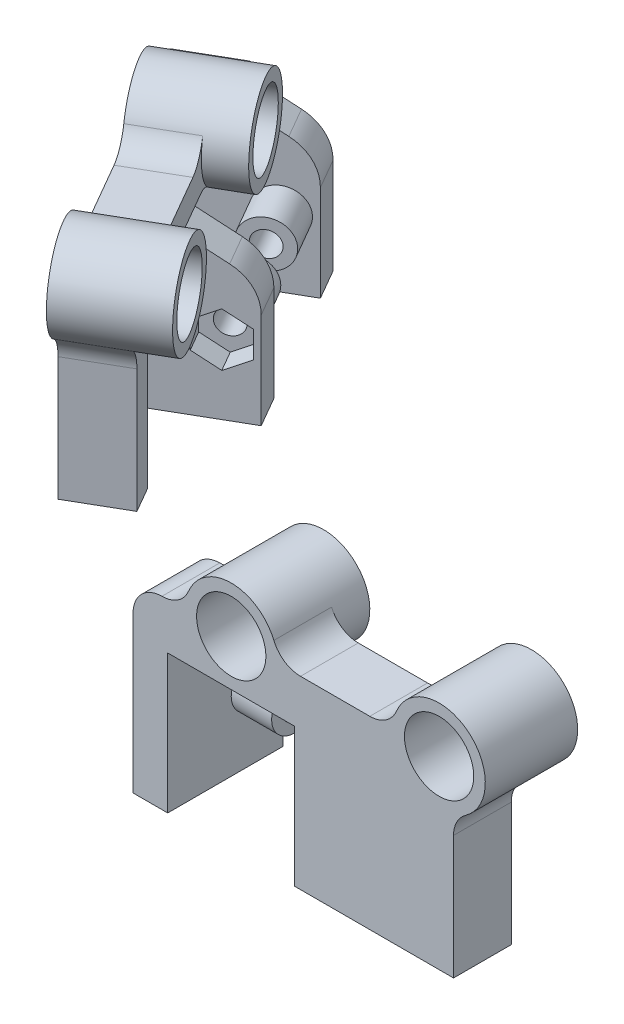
ISO-10303-21;
HEADER;
FILE_DESCRIPTION(('STEP AP214'),'2;1');
FILE_NAME('part.step','',(''),(''),'','','');
FILE_SCHEMA(('AUTOMOTIVE_DESIGN { 1 0 10303 214 1 1 1 1 }'));
ENDSEC;
DATA;
#1=APPLICATION_CONTEXT('core data for automotive mechanical design processes');
#2=APPLICATION_PROTOCOL_DEFINITION('international standard','automotive_design',2000,#1);
#3=PRODUCT_CONTEXT('',#1,'mechanical');
#4=PRODUCT('Part','Part','',(#3));
#5=PRODUCT_RELATED_PRODUCT_CATEGORY('part','',(#4));
#6=PRODUCT_DEFINITION_FORMATION('','',#4);
#7=PRODUCT_DEFINITION_CONTEXT('part definition',#1,'design');
#8=PRODUCT_DEFINITION('design','',#6,#7);
#9=PRODUCT_DEFINITION_SHAPE('','',#8);
#10=(LENGTH_UNIT() NAMED_UNIT(*) SI_UNIT(.MILLI.,.METRE.));
#11=(NAMED_UNIT(*) PLANE_ANGLE_UNIT() SI_UNIT($,.RADIAN.));
#12=(NAMED_UNIT(*) SI_UNIT($,.STERADIAN.) SOLID_ANGLE_UNIT());
#13=UNCERTAINTY_MEASURE_WITH_UNIT(LENGTH_MEASURE(1.E-05),#10,'distance_accuracy_value','');
#14=(GEOMETRIC_REPRESENTATION_CONTEXT(3) GLOBAL_UNCERTAINTY_ASSIGNED_CONTEXT((#13)) GLOBAL_UNIT_ASSIGNED_CONTEXT((#10,
#11,#12)) REPRESENTATION_CONTEXT('',''));
#15=CARTESIAN_POINT('',(0.,0.,0.));
#16=DIRECTION('',(0.,0.,1.));
#17=DIRECTION('',(1.,0.,0.));
#18=AXIS2_PLACEMENT_3D('',#15,#16,#17);
#19=CARTESIAN_POINT('',(-47.4732482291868,32.,-37.2230048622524));
#20=DIRECTION('',(-0.866025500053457,0.,0.499999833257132));
#21=DIRECTION('',(0.499999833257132,0.,0.866025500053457));
#22=AXIS2_PLACEMENT_3D('',#19,#20,#21);
#23=PLANE('',#22);
#24=CARTESIAN_POINT('',(-65.4732422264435,32.,-68.3999228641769));
#25=DIRECTION('',(0.866025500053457,0.,-0.499999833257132));
#26=DIRECTION('',(-0.499999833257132,0.,-0.866025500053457));
#27=AXIS2_PLACEMENT_3D('',#24,#25,#26);
#28=CIRCLE('',#27,8.00000000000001);
#29=CARTESIAN_POINT('',(-62.9173588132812,25.8461538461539,-63.9730009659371));
#30=VERTEX_POINT('',#29);
#31=CARTESIAN_POINT('',(-65.4732422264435,24.,-68.3999228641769));
#32=VERTEX_POINT('',#31);
#33=EDGE_CURVE('E514',#30,#32,#28,.T.);
#34=ORIENTED_EDGE('',*,*,#33,.F.);
#35=CARTESIAN_POINT('',(-61.3199316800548,22.,-61.2061747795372));
#36=DIRECTION('',(-0.866025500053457,0.,0.499999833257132));
#37=DIRECTION('',(0.499999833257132,0.,0.866025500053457));
#38=AXIS2_PLACEMENT_3D('',#35,#36,#37);
#39=CIRCLE('',#38,5.);
#40=CARTESIAN_POINT('',(-61.3199316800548,27.,-61.2061747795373));
#41=VERTEX_POINT('',#40);
#42=EDGE_CURVE('E589',#30,#41,#39,.F.);
#43=ORIENTED_EDGE('',*,*,#42,.T.);
#44=DIRECTION('',(-0.499999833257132,0.,-0.866025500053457));
#45=VECTOR('',#44,1.);
#46=CARTESIAN_POINT('',(-50.5957461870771,27.,-42.6313323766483));
#47=LINE('',#46,#45);
#48=CARTESIAN_POINT('',(-59.9732440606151,27.,-58.8736423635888));
#49=VERTEX_POINT('',#48);
#50=EDGE_CURVE('E474',#49,#41,#47,.T.);
#51=ORIENTED_EDGE('',*,*,#50,.F.);
#52=DIRECTION('',(0.,1.,0.));
#53=VECTOR('',#52,1.);
#54=CARTESIAN_POINT('',(-59.9732440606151,27.,-58.8736423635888));
#55=LINE('',#54,#53);
#56=CARTESIAN_POINT('',(-59.9732440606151,24.,-58.8736423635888));
#57=VERTEX_POINT('',#56);
#58=EDGE_CURVE('E381',#57,#49,#55,.T.);
#59=ORIENTED_EDGE('',*,*,#58,.F.);
#60=DIRECTION('',(-0.499999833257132,0.,-0.866025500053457));
#61=VECTOR('',#60,1.);
#62=CARTESIAN_POINT('',(-59.9732440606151,24.,-58.8736423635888));
#63=LINE('',#62,#61);
#64=EDGE_CURVE('E525',#57,#32,#63,.T.);
#65=ORIENTED_EDGE('',*,*,#64,.T.);
#66=EDGE_LOOP('',(#34,#43,#51,#59,#65));
#67=FACE_BOUND('',#66,.T.);
#68=ADVANCED_FACE('F57',(#67),#23,.F.);
#69=CARTESIAN_POINT('',(-46.2656186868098,27.,-45.1313315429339));
#70=DIRECTION('',(0.,1.,0.));
#71=DIRECTION('',(0.,0.,1.));
#72=AXIS2_PLACEMENT_3D('',#69,#70,#71);
#73=PLANE('',#72);
#74=ORIENTED_EDGE('',*,*,#50,.T.);
#75=DIRECTION('',(0.866025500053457,0.,-0.499999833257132));
#76=VECTOR('',#75,1.);
#77=CARTESIAN_POINT('',(-56.9898041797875,27.,-63.7061739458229));
#78=LINE('',#77,#76);
#79=CARTESIAN_POINT('',(-56.9898041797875,27.,-63.7061739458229));
#80=VERTEX_POINT('',#79);
#81=EDGE_CURVE('E591',#41,#80,#78,.T.);
#82=ORIENTED_EDGE('',*,*,#81,.T.);
#83=DIRECTION('',(-0.499999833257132,0.,-0.866025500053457));
#84=VECTOR('',#83,1.);
#85=CARTESIAN_POINT('',(-46.2656186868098,27.,-45.1313315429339));
#86=LINE('',#85,#84);
#87=CARTESIAN_POINT('',(-55.6431165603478,27.,-61.3736415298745));
#88=VERTEX_POINT('',#87);
#89=EDGE_CURVE('E479',#88,#80,#86,.T.);
#90=ORIENTED_EDGE('',*,*,#89,.F.);
#91=DIRECTION('',(0.866025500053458,0.,-0.499999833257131));
#92=VECTOR('',#91,1.);
#93=CARTESIAN_POINT('',(-55.6431165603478,27.,-61.3736415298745));
#94=LINE('',#93,#92);
#95=EDGE_CURVE('E403',#49,#88,#94,.T.);
#96=ORIENTED_EDGE('',*,*,#95,.F.);
#97=EDGE_LOOP('',(#74,#82,#90,#96));
#98=FACE_BOUND('',#97,.T.);
#99=ADVANCED_FACE('F696',(#98),#73,.F.);
#100=CARTESIAN_POINT('',(-55.9469617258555,32.,-73.8999210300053));
#101=DIRECTION('',(-0.866025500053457,0.,0.499999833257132));
#102=DIRECTION('',(0.499999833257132,0.,0.866025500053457));
#103=AXIS2_PLACEMENT_3D('',#100,#101,#102);
#104=CYLINDRICAL_SURFACE('',#103,8.00000000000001);
#105=CARTESIAN_POINT('',(-55.9469617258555,32.,-73.8999210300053));
#106=DIRECTION('',(0.866025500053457,0.,-0.499999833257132));
#107=DIRECTION('',(-0.499999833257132,0.,-0.866025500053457));
#108=AXIS2_PLACEMENT_3D('',#105,#106,#107);
#109=CIRCLE('',#108,8.00000000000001);
#110=CARTESIAN_POINT('',(-59.9469603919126,32.,-80.828125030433));
#111=VERTEX_POINT('',#110);
#112=EDGE_CURVE('E515',#111,#111,#109,.T.);
#113=ORIENTED_EDGE('',*,*,#112,.F.);
#114=EDGE_LOOP('',(#113));
#115=FACE_BOUND('',#114,.T.);
#116=CARTESIAN_POINT('',(-65.4732422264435,32.,-68.3999228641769));
#117=DIRECTION('',(-0.866025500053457,0.,0.499999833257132));
#118=DIRECTION('',(0.499999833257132,0.,0.866025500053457));
#119=AXIS2_PLACEMENT_3D('',#116,#117,#118);
#120=CIRCLE('',#119,8.00000000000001);
#121=CARTESIAN_POINT('',(-68.0291256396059,25.8461538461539,-72.8268447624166));
#122=VERTEX_POINT('',#121);
#123=EDGE_CURVE('E556',#32,#122,#120,.F.);
#124=ORIENTED_EDGE('',*,*,#123,.T.);
#125=DIRECTION('',(-0.866025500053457,0.,0.499999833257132));
#126=VECTOR('',#125,1.);
#127=CARTESIAN_POINT('',(-58.5028451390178,25.8461538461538,-78.3268429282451));
#128=LINE('',#127,#126);
#129=CARTESIAN_POINT('',(-63.6989981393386,25.8461538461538,-75.3268439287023));
#130=VERTEX_POINT('',#129);
#131=EDGE_CURVE('E586',#122,#130,#128,.F.);
#132=ORIENTED_EDGE('',*,*,#131,.T.);
#133=CARTESIAN_POINT('',(-61.1431147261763,32.,-70.8999220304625));
#134=DIRECTION('',(-0.866025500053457,0.,0.499999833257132));
#135=DIRECTION('',(-0.499999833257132,0.,-0.866025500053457));
#136=AXIS2_PLACEMENT_3D('',#133,#134,#135);
#137=CIRCLE('',#136,8.00000000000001);
#138=CARTESIAN_POINT('',(-64.835421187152,35.0769230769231,-77.2951872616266));
#139=VERTEX_POINT('',#138);
#140=EDGE_CURVE('E468',#139,#130,#137,.T.);
#141=ORIENTED_EDGE('',*,*,#140,.F.);
#142=DIRECTION('',(-0.866025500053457,0.,0.499999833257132));
#143=VECTOR('',#142,1.);
#144=CARTESIAN_POINT('',(-59.6392681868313,35.0769230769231,-80.2951862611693));
#145=LINE('',#144,#143);
#146=CARTESIAN_POINT('',(-73.4956761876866,35.0769230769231,-72.2951889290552));
#147=VERTEX_POINT('',#146);
#148=EDGE_CURVE('E577',#139,#147,#145,.T.);
#149=ORIENTED_EDGE('',*,*,#148,.T.);
#150=CARTESIAN_POINT('',(-69.8033697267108,32.,-65.8999236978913));
#151=DIRECTION('',(-0.866025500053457,0.,0.499999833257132));
#152=DIRECTION('',(0.499999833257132,0.,0.866025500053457));
#153=AXIS2_PLACEMENT_3D('',#150,#151,#152);
#154=CIRCLE('',#153,7.99999999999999);
#155=CARTESIAN_POINT('',(-66.1110632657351,35.076923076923,-59.5046584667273));
#156=VERTEX_POINT('',#155);
#157=EDGE_CURVE('E458',#156,#147,#154,.T.);
#158=ORIENTED_EDGE('',*,*,#157,.F.);
#159=DIRECTION('',(-0.866025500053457,0.,0.499999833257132));
#160=VECTOR('',#159,1.);
#161=CARTESIAN_POINT('',(-52.2546552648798,35.0769230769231,-67.5046557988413));
#162=LINE('',#161,#160);
#163=CARTESIAN_POINT('',(-57.4508082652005,35.0769230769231,-64.5046567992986));
#164=VERTEX_POINT('',#163);
#165=EDGE_CURVE('E580',#156,#164,#162,.F.);
#166=ORIENTED_EDGE('',*,*,#165,.T.);
#167=CARTESIAN_POINT('',(-61.1431147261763,32.,-70.8999220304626));
#168=DIRECTION('',(-0.866025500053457,0.,0.499999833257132));
#169=DIRECTION('',(-0.499999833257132,0.,-0.866025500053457));
#170=AXIS2_PLACEMENT_3D('',#167,#168,#169);
#171=CIRCLE('',#170,8.00000000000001);
#172=CARTESIAN_POINT('',(-58.5872313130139,25.8461538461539,-66.4730001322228));
#173=VERTEX_POINT('',#172);
#174=EDGE_CURVE('E477',#173,#164,#171,.T.);
#175=ORIENTED_EDGE('',*,*,#174,.F.);
#176=DIRECTION('',(-0.866025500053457,0.,0.499999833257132));
#177=VECTOR('',#176,1.);
#178=CARTESIAN_POINT('',(-53.3910783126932,25.8461538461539,-69.4729991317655));
#179=LINE('',#178,#177);
#180=EDGE_CURVE('E583',#173,#30,#179,.T.);
#181=ORIENTED_EDGE('',*,*,#180,.T.);
#182=ORIENTED_EDGE('',*,*,#33,.T.);
#183=EDGE_LOOP('',(#124,#132,#141,#149,#158,#166,#175,#181,#182));
#184=FACE_BOUND('',#183,.T.);
#185=ADVANCED_FACE('F705',(#115,#184),#104,.T.);
#186=DIRECTION('',(-0.499999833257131,0.,-0.866025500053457));
#187=VECTOR('',#186,1.);
#188=CARTESIAN_POINT('',(-68.5957401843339,27.,-73.8082503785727));
#189=LINE('',#188,#187);
#190=CARTESIAN_POINT('',(-69.6265527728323,27.,-75.5936709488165));
#191=VERTEX_POINT('',#190);
#192=CARTESIAN_POINT('',(-70.973240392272,27.,-77.9262033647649));
#193=VERTEX_POINT('',#192);
#194=EDGE_CURVE('E465',#191,#193,#189,.T.);
#195=ORIENTED_EDGE('',*,*,#194,.F.);
#196=CARTESIAN_POINT('',(-69.6265527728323,22.,-75.5936709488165));
#197=DIRECTION('',(-0.866025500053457,0.,0.499999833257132));
#198=DIRECTION('',(0.499999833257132,0.,0.866025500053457));
#199=AXIS2_PLACEMENT_3D('',#196,#197,#198);
#200=CIRCLE('',#199,5.);
#201=EDGE_CURVE('E575',#191,#122,#200,.F.);
#202=ORIENTED_EDGE('',*,*,#201,.T.);
#203=ORIENTED_EDGE('',*,*,#123,.F.);
#204=CARTESIAN_POINT('',(-70.973240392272,24.,-77.9262033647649));
#205=VERTEX_POINT('',#204);
#206=EDGE_CURVE('E523',#32,#205,#63,.T.);
#207=ORIENTED_EDGE('',*,*,#206,.T.);
#208=DIRECTION('',(0.,1.,0.));
#209=VECTOR('',#208,1.);
#210=CARTESIAN_POINT('',(-70.973240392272,27.,-77.9262033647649));
#211=LINE('',#210,#209);
#212=EDGE_CURVE('E423',#205,#193,#211,.T.);
#213=ORIENTED_EDGE('',*,*,#212,.T.);
#214=EDGE_LOOP('',(#195,#202,#203,#207,#213));
#215=FACE_BOUND('',#214,.T.);
#216=ADVANCED_FACE('F700',(#215),#23,.F.);
#217=CARTESIAN_POINT('',(-51.6265587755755,27.,-44.416752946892));
#218=VERTEX_POINT('',#217);
#219=CARTESIAN_POINT('',(-56.9732450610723,27.,-53.6774893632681));
#220=VERTEX_POINT('',#219);
#221=EDGE_CURVE('E471',#218,#220,#47,.T.);
#222=ORIENTED_EDGE('',*,*,#221,.F.);
#223=CARTESIAN_POINT('',(-51.6265587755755,22.,-44.416752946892));
#224=DIRECTION('',(-0.866025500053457,0.,0.499999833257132));
#225=DIRECTION('',(0.499999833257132,0.,0.866025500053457));
#226=AXIS2_PLACEMENT_3D('',#223,#224,#225);
#227=CIRCLE('',#226,5.);
#228=CARTESIAN_POINT('',(-50.0291316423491,25.8461538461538,-41.6499267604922));
#229=VERTEX_POINT('',#228);
#230=EDGE_CURVE('E598',#218,#229,#227,.F.);
#231=ORIENTED_EDGE('',*,*,#230,.T.);
#232=CARTESIAN_POINT('',(-47.4732482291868,32.,-37.2230048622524));
#233=DIRECTION('',(-0.866025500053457,0.,0.499999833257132));
#234=DIRECTION('',(0.499999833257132,0.,0.866025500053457));
#235=AXIS2_PLACEMENT_3D('',#232,#233,#234);
#236=CIRCLE('',#235,8.);
#237=CARTESIAN_POINT('',(-49.7809397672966,25.4656121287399,-41.2200456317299));
#238=VERTEX_POINT('',#237);
#239=EDGE_CURVE('E559',#238,#229,#236,.F.);
#240=ORIENTED_EDGE('',*,*,#239,.F.);
#241=CARTESIAN_POINT('',(-51.2232469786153,21.3816197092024,-43.7181961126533));
#242=DIRECTION('',(-0.866025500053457,0.,0.499999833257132));
#243=DIRECTION('',(0.499999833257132,0.,0.866025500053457));
#244=AXIS2_PLACEMENT_3D('',#241,#242,#243);
#245=CIRCLE('',#244,5.);
#246=CARTESIAN_POINT('',(-48.7232478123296,21.3816197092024,-39.388068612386));
#247=VERTEX_POINT('',#246);
#248=EDGE_CURVE('E596',#238,#247,#245,.F.);
#249=ORIENTED_EDGE('',*,*,#248,.T.);
#250=DIRECTION('',(0.,1.,0.));
#251=VECTOR('',#250,1.);
#252=CARTESIAN_POINT('',(-48.7232478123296,24.4006579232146,-39.388068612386));
#253=LINE('',#252,#251);
#254=CARTESIAN_POINT('',(-48.7232478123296,0.,-39.388068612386));
#255=VERTEX_POINT('',#254);
#256=EDGE_CURVE('E473',#255,#247,#253,.T.);
#257=ORIENTED_EDGE('',*,*,#256,.F.);
#258=DIRECTION('',(-0.499999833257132,0.,-0.866025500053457));
#259=VECTOR('',#258,1.);
#260=CARTESIAN_POINT('',(-43.4732495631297,0.,-30.2948008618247));
#261=LINE('',#260,#259);
#262=CARTESIAN_POINT('',(-56.9732450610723,0.,-53.6774893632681));
#263=VERTEX_POINT('',#262);
#264=EDGE_CURVE('E520',#255,#263,#261,.T.);
#265=ORIENTED_EDGE('',*,*,#264,.T.);
#266=DIRECTION('',(0.,1.,0.));
#267=VECTOR('',#266,1.);
#268=CARTESIAN_POINT('',(-56.9732450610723,27.,-53.6774893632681));
#269=LINE('',#268,#267);
#270=EDGE_CURVE('E382',#263,#220,#269,.T.);
#271=ORIENTED_EDGE('',*,*,#270,.T.);
#272=EDGE_LOOP('',(#222,#231,#240,#249,#257,#265,#271));
#273=FACE_BOUND('',#272,.T.);
#274=ADVANCED_FACE('F699',(#273),#23,.F.);
#275=CARTESIAN_POINT('',(-47.4732482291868,32.,-37.2230048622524));
#276=DIRECTION('',(-0.866025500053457,0.,0.499999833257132));
#277=DIRECTION('',(0.499999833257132,0.,0.866025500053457));
#278=AXIS2_PLACEMENT_3D('',#275,#276,#277);
#279=CYLINDRICAL_SURFACE('',#278,8.);
#280=ORIENTED_EDGE('',*,*,#239,.T.);
#281=DIRECTION('',(-0.866025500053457,0.,0.499999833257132));
#282=VECTOR('',#281,1.);
#283=CARTESIAN_POINT('',(-50.0291316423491,25.8461538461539,-41.6499267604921));
#284=LINE('',#283,#282);
#285=CARTESIAN_POINT('',(-45.6990041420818,25.8461538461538,-44.1499259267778));
#286=VERTEX_POINT('',#285);
#287=EDGE_CURVE('E609',#229,#286,#284,.F.);
#288=ORIENTED_EDGE('',*,*,#287,.T.);
#289=CARTESIAN_POINT('',(-43.1431207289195,32.,-39.7230040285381));
#290=DIRECTION('',(-0.866025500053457,0.,0.499999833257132));
#291=DIRECTION('',(-0.499999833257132,0.,-0.866025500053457));
#292=AXIS2_PLACEMENT_3D('',#289,#290,#291);
#293=CIRCLE('',#292,8.00000000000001);
#294=CARTESIAN_POINT('',(-46.8354271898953,35.0769230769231,-46.1182692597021));
#295=VERTEX_POINT('',#294);
#296=EDGE_CURVE('E482',#295,#286,#293,.T.);
#297=ORIENTED_EDGE('',*,*,#296,.F.);
#298=DIRECTION('',(-0.866025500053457,0.,0.499999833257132));
#299=VECTOR('',#298,1.);
#300=CARTESIAN_POINT('',(-51.1655546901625,35.0769230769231,-43.6182700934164));
#301=LINE('',#300,#299);
#302=CARTESIAN_POINT('',(-55.4956821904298,35.0769230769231,-41.1182709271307));
#303=VERTEX_POINT('',#302);
#304=EDGE_CURVE('E600',#295,#303,#301,.T.);
#305=ORIENTED_EDGE('',*,*,#304,.T.);
#306=CARTESIAN_POINT('',(-51.803375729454,32.,-34.7230056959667));
#307=DIRECTION('',(0.866025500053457,0.,-0.499999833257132));
#308=DIRECTION('',(0.499999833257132,0.,0.866025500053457));
#309=AXIS2_PLACEMENT_3D('',#306,#307,#308);
#310=CIRCLE('',#309,8.);
#311=CARTESIAN_POINT('',(-49.4956841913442,25.4656121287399,-30.7259649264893));
#312=VERTEX_POINT('',#311);
#313=EDGE_CURVE('E524',#303,#312,#310,.T.);
#314=ORIENTED_EDGE('',*,*,#313,.T.);
#315=DIRECTION('',(-0.866025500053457,0.,0.499999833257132));
#316=VECTOR('',#315,1.);
#317=CARTESIAN_POINT('',(-45.1655566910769,25.4656121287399,-33.2259640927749));
#318=LINE('',#317,#316);
#319=CARTESIAN_POINT('',(-40.8354291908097,25.4656121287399,-35.7259632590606));
#320=VERTEX_POINT('',#319);
#321=EDGE_CURVE('E603',#312,#320,#318,.F.);
#322=ORIENTED_EDGE('',*,*,#321,.T.);
#323=CARTESIAN_POINT('',(-43.1431207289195,32.,-39.7230040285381));
#324=DIRECTION('',(-0.866025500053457,0.,0.499999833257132));
#325=DIRECTION('',(-0.499999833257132,0.,-0.866025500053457));
#326=AXIS2_PLACEMENT_3D('',#323,#324,#325);
#327=CIRCLE('',#326,8.);
#328=CARTESIAN_POINT('',(-45.4508122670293,25.4656121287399,-43.7200447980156));
#329=VERTEX_POINT('',#328);
#330=EDGE_CURVE('E484',#329,#320,#327,.T.);
#331=ORIENTED_EDGE('',*,*,#330,.F.);
#332=DIRECTION('',(-0.866025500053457,0.,0.499999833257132));
#333=VECTOR('',#332,1.);
#334=CARTESIAN_POINT('',(-49.7809397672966,25.4656121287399,-41.2200456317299));
#335=LINE('',#334,#333);
#336=EDGE_CURVE('E606',#329,#238,#335,.T.);
#337=ORIENTED_EDGE('',*,*,#336,.T.);
#338=EDGE_LOOP('',(#280,#288,#297,#305,#314,#322,#331,#337));
#339=FACE_BOUND('',#338,.T.);
#340=CARTESIAN_POINT('',(-37.9469677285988,32.,-42.7230030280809));
#341=DIRECTION('',(0.866025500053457,0.,-0.499999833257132));
#342=DIRECTION('',(-0.499999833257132,0.,-0.866025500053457));
#343=AXIS2_PLACEMENT_3D('',#340,#341,#342);
#344=CIRCLE('',#343,8.);
#345=CARTESIAN_POINT('',(-41.9469663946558,32.,-49.6512070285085));
#346=VERTEX_POINT('',#345);
#347=EDGE_CURVE('E503',#346,#346,#344,.T.);
#348=ORIENTED_EDGE('',*,*,#347,.F.);
#349=EDGE_LOOP('',(#348));
#350=FACE_BOUND('',#349,.T.);
#351=ADVANCED_FACE('F713',(#339,#350),#279,.T.);
#352=CARTESIAN_POINT('',(-43.4732495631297,0.,-30.2948008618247));
#353=DIRECTION('',(0.,1.,0.));
#354=DIRECTION('',(0.,0.,1.));
#355=AXIS2_PLACEMENT_3D('',#352,#353,#354);
#356=PLANE('',#355);
#357=DIRECTION('',(-0.866025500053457,0.,0.499999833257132));
#358=VECTOR('',#357,1.);
#359=CARTESIAN_POINT('',(-41.8931211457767,0.,-37.5579402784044));
#360=LINE('',#359,#358);
#361=CARTESIAN_POINT('',(-41.8931211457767,0.,-37.5579402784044));
#362=VERTEX_POINT('',#361);
#363=CARTESIAN_POINT('',(-50.5533761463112,0.,-32.5579419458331));
#364=VERTEX_POINT('',#363);
#365=EDGE_CURVE('E497',#362,#364,#360,.T.);
#366=ORIENTED_EDGE('',*,*,#365,.T.);
#367=DIRECTION('',(-0.499999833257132,0.,-0.866025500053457));
#368=VECTOR('',#367,1.);
#369=CARTESIAN_POINT('',(-47.803377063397,0.,-27.7948016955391));
#370=LINE('',#369,#368);
#371=CARTESIAN_POINT('',(-64.3033715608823,0.,-56.3736431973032));
#372=VERTEX_POINT('',#371);
#373=EDGE_CURVE('E518',#364,#372,#370,.T.);
#374=ORIENTED_EDGE('',*,*,#373,.T.);
#375=DIRECTION('',(-0.866025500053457,0.,0.499999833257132));
#376=VECTOR('',#375,1.);
#377=CARTESIAN_POINT('',(-59.9732440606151,0.,-58.8736423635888));
#378=LINE('',#377,#376);
#379=CARTESIAN_POINT('',(-46.9828615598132,0.,-66.3736398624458));
#380=VERTEX_POINT('',#379);
#381=EDGE_CURVE('E553',#380,#372,#378,.T.);
#382=ORIENTED_EDGE('',*,*,#381,.F.);
#383=DIRECTION('',(-0.499999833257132,0.,-0.866025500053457));
#384=VECTOR('',#383,1.);
#385=CARTESIAN_POINT('',(-43.9828625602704,0.,-61.1774868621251));
#386=LINE('',#385,#384);
#387=CARTESIAN_POINT('',(-43.9828625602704,0.,-61.1774868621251));
#388=VERTEX_POINT('',#387);
#389=EDGE_CURVE('E413',#388,#380,#386,.T.);
#390=ORIENTED_EDGE('',*,*,#389,.F.);
#391=DIRECTION('',(-0.866025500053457,0.,0.499999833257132));
#392=VECTOR('',#391,1.);
#393=CARTESIAN_POINT('',(-56.9732450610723,0.,-53.6774893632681));
#394=LINE('',#393,#392);
#395=EDGE_CURVE('E398',#388,#263,#394,.T.);
#396=ORIENTED_EDGE('',*,*,#395,.T.);
#397=ORIENTED_EDGE('',*,*,#264,.F.);
#398=DIRECTION('',(-0.866025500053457,0.,0.499999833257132));
#399=VECTOR('',#398,1.);
#400=CARTESIAN_POINT('',(-44.3931203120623,0.,-41.8880677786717));
#401=LINE('',#400,#399);
#402=CARTESIAN_POINT('',(-44.3931203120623,0.,-41.8880677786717));
#403=VERTEX_POINT('',#402);
#404=EDGE_CURVE('E493',#403,#255,#401,.T.);
#405=ORIENTED_EDGE('',*,*,#404,.F.);
#406=DIRECTION('',(-0.499999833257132,0.,-0.866025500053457));
#407=VECTOR('',#406,1.);
#408=CARTESIAN_POINT('',(-41.8931211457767,0.,-37.5579402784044));
#409=LINE('',#408,#407);
#410=EDGE_CURVE('E488',#362,#403,#409,.T.);
#411=ORIENTED_EDGE('',*,*,#410,.F.);
#412=EDGE_LOOP('',(#366,#374,#382,#390,#396,#397,#405,#411));
#413=FACE_BOUND('',#412,.T.);
#414=ADVANCED_FACE('F831',(#413),#356,.F.);
#415=CARTESIAN_POINT('',(-59.9732440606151,0.,-58.8736423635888));
#416=DIRECTION('',(0.499999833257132,0.,0.866025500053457));
#417=DIRECTION('',(0.866025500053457,0.,-0.499999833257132));
#418=AXIS2_PLACEMENT_3D('',#415,#416,#417);
#419=PLANE('',#418);
#420=CARTESIAN_POINT('',(-51.3129890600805,12.,-63.8736406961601));
#421=DIRECTION('',(0.499999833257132,0.,0.866025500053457));
#422=DIRECTION('',(0.866025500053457,0.,-0.499999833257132));
#423=AXIS2_PLACEMENT_3D('',#420,#421,#422);
#424=CIRCLE('',#423,4.);
#425=CARTESIAN_POINT('',(-47.8488870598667,12.,-65.8736400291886));
#426=VERTEX_POINT('',#425);
#427=EDGE_CURVE('E565',#426,#426,#424,.F.);
#428=ORIENTED_EDGE('',*,*,#427,.F.);
#429=EDGE_LOOP('',(#428));
#430=FACE_BOUND('',#429,.T.);
#431=DIRECTION('',(0.,1.,0.));
#432=VECTOR('',#431,1.);
#433=CARTESIAN_POINT('',(-64.3033715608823,0.,-56.3736431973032));
#434=LINE('',#433,#432);
#435=CARTESIAN_POINT('',(-64.3033715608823,24.,-56.3736431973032));
#436=VERTEX_POINT('',#435);
#437=EDGE_CURVE('E530',#372,#436,#434,.T.);
#438=ORIENTED_EDGE('',*,*,#437,.T.);
#439=DIRECTION('',(-0.866025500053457,0.,0.499999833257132));
#440=VECTOR('',#439,1.);
#441=CARTESIAN_POINT('',(-59.9732440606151,24.,-58.8736423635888));
#442=LINE('',#441,#440);
#443=EDGE_CURVE('E550',#57,#436,#442,.T.);
#444=ORIENTED_EDGE('',*,*,#443,.F.);
#445=ORIENTED_EDGE('',*,*,#58,.T.);
#446=ORIENTED_EDGE('',*,*,#95,.T.);
#447=DIRECTION('',(0.750000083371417,-0.499999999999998,-0.43301255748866));
#448=VECTOR('',#447,1.);
#449=CARTESIAN_POINT('',(-50.4469635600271,23.5358983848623,-64.3736405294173));
#450=LINE('',#449,#448);
#451=CARTESIAN_POINT('',(-50.4469635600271,23.5358983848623,-64.3736405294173));
#452=VERTEX_POINT('',#451);
#453=EDGE_CURVE('E405',#88,#452,#450,.T.);
#454=ORIENTED_EDGE('',*,*,#453,.T.);
#455=CARTESIAN_POINT('',(-53.9110655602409,16.6076951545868,-62.3736411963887));
#456=DIRECTION('',(-0.499999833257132,0.,-0.866025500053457));
#457=DIRECTION('',(0.866025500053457,0.,-0.499999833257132));
#458=AXIS2_PLACEMENT_3D('',#455,#456,#457);
#459=CIRCLE('',#458,8.);
#460=CARTESIAN_POINT('',(-46.9828615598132,16.6076951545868,-66.3736398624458));
#461=VERTEX_POINT('',#460);
#462=EDGE_CURVE('E408',#452,#461,#459,.T.);
#463=ORIENTED_EDGE('',*,*,#462,.T.);
#464=DIRECTION('',(0.,-1.,0.));
#465=VECTOR('',#464,1.);
#466=CARTESIAN_POINT('',(-46.9828615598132,0.,-66.3736398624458));
#467=LINE('',#466,#465);
#468=EDGE_CURVE('E386',#461,#380,#467,.T.);
#469=ORIENTED_EDGE('',*,*,#468,.T.);
#470=ORIENTED_EDGE('',*,*,#381,.T.);
#471=EDGE_LOOP('',(#438,#444,#445,#446,#454,#463,#469,#470));
#472=FACE_BOUND('',#471,.T.);
#473=ADVANCED_FACE('F841',(#430,#472),#419,.F.);
#474=CARTESIAN_POINT('',(-59.9732440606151,24.,-58.8736423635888));
#475=DIRECTION('',(0.,1.,0.));
#476=DIRECTION('',(0.,0.,1.));
#477=AXIS2_PLACEMENT_3D('',#474,#475,#476);
#478=PLANE('',#477);
#479=DIRECTION('',(-0.499999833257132,0.,-0.866025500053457));
#480=VECTOR('',#479,1.);
#481=CARTESIAN_POINT('',(-64.3033715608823,24.,-56.3736431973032));
#482=LINE('',#481,#480);
#483=CARTESIAN_POINT('',(-75.3033678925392,24.,-75.4262041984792));
#484=VERTEX_POINT('',#483);
#485=EDGE_CURVE('E532',#436,#484,#482,.T.);
#486=ORIENTED_EDGE('',*,*,#485,.T.);
#487=DIRECTION('',(-0.866025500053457,0.,0.499999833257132));
#488=VECTOR('',#487,1.);
#489=CARTESIAN_POINT('',(-70.973240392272,24.,-77.9262033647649));
#490=LINE('',#489,#488);
#491=EDGE_CURVE('E547',#205,#484,#490,.T.);
#492=ORIENTED_EDGE('',*,*,#491,.F.);
#493=ORIENTED_EDGE('',*,*,#206,.F.);
#494=ORIENTED_EDGE('',*,*,#64,.F.);
#495=ORIENTED_EDGE('',*,*,#443,.T.);
#496=EDGE_LOOP('',(#486,#492,#493,#494,#495));
#497=FACE_BOUND('',#496,.T.);
#498=ADVANCED_FACE('F749',(#497),#478,.F.);
#499=CARTESIAN_POINT('',(-70.973240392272,0.,-77.9262033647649));
#500=DIRECTION('',(-0.499999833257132,0.,-0.866025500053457));
#501=DIRECTION('',(-0.866025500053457,0.,0.499999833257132));
#502=AXIS2_PLACEMENT_3D('',#499,#500,#501);
#503=PLANE('',#502);
#504=CARTESIAN_POINT('',(-62.3129853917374,12.,-82.9262016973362));
#505=DIRECTION('',(-0.499999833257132,0.,-0.866025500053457));
#506=DIRECTION('',(-0.866025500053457,0.,0.499999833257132));
#507=AXIS2_PLACEMENT_3D('',#504,#505,#506);
#508=CIRCLE('',#507,4.);
#509=CARTESIAN_POINT('',(-65.7770873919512,12.,-80.9262023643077));
#510=VERTEX_POINT('',#509);
#511=EDGE_CURVE('E562',#510,#510,#508,.F.);
#512=ORIENTED_EDGE('',*,*,#511,.F.);
#513=EDGE_LOOP('',(#512));
#514=FACE_BOUND('',#513,.T.);
#515=DIRECTION('',(0.,-1.,0.));
#516=VECTOR('',#515,1.);
#517=CARTESIAN_POINT('',(-75.3033678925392,0.,-75.4262041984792));
#518=LINE('',#517,#516);
#519=CARTESIAN_POINT('',(-75.3033678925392,0.,-75.4262041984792));
#520=VERTEX_POINT('',#519);
#521=EDGE_CURVE('E534',#484,#520,#518,.T.);
#522=ORIENTED_EDGE('',*,*,#521,.T.);
#523=DIRECTION('',(-0.866025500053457,0.,0.499999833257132));
#524=VECTOR('',#523,1.);
#525=CARTESIAN_POINT('',(-70.973240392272,0.,-77.9262033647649));
#526=LINE('',#525,#524);
#527=CARTESIAN_POINT('',(-57.9828578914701,0.,-85.4262008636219));
#528=VERTEX_POINT('',#527);
#529=EDGE_CURVE('E544',#528,#520,#526,.T.);
#530=ORIENTED_EDGE('',*,*,#529,.F.);
#531=DIRECTION('',(0.,-1.,0.));
#532=VECTOR('',#531,1.);
#533=CARTESIAN_POINT('',(-57.9828578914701,0.,-85.4262008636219));
#534=LINE('',#533,#532);
#535=CARTESIAN_POINT('',(-57.9828578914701,16.6076951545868,-85.4262008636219));
#536=VERTEX_POINT('',#535);
#537=EDGE_CURVE('E436',#536,#528,#534,.T.);
#538=ORIENTED_EDGE('',*,*,#537,.F.);
#539=CARTESIAN_POINT('',(-64.9110618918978,16.6076951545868,-81.4262021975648));
#540=DIRECTION('',(-0.499999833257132,0.,-0.866025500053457));
#541=DIRECTION('',(0.866025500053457,0.,-0.499999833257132));
#542=AXIS2_PLACEMENT_3D('',#539,#540,#541);
#543=CIRCLE('',#542,8.);
#544=CARTESIAN_POINT('',(-61.446959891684,23.5358983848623,-83.4262015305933));
#545=VERTEX_POINT('',#544);
#546=EDGE_CURVE('E433',#545,#536,#543,.T.);
#547=ORIENTED_EDGE('',*,*,#546,.F.);
#548=DIRECTION('',(0.750000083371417,-0.499999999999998,-0.43301255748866));
#549=VECTOR('',#548,1.);
#550=CARTESIAN_POINT('',(-61.446959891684,23.5358983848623,-83.4262015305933));
#551=LINE('',#550,#549);
#552=CARTESIAN_POINT('',(-66.6431128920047,27.,-80.4262025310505));
#553=VERTEX_POINT('',#552);
#554=EDGE_CURVE('E430',#553,#545,#551,.T.);
#555=ORIENTED_EDGE('',*,*,#554,.F.);
#556=DIRECTION('',(0.866025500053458,0.,-0.499999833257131));
#557=VECTOR('',#556,1.);
#558=CARTESIAN_POINT('',(-66.6431128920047,27.,-80.4262025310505));
#559=LINE('',#558,#557);
#560=EDGE_CURVE('E426',#193,#553,#559,.T.);
#561=ORIENTED_EDGE('',*,*,#560,.F.);
#562=ORIENTED_EDGE('',*,*,#212,.F.);
#563=ORIENTED_EDGE('',*,*,#491,.T.);
#564=EDGE_LOOP('',(#522,#530,#538,#547,#555,#561,#562,#563));
#565=FACE_BOUND('',#564,.T.);
#566=ADVANCED_FACE('F731',(#514,#565),#503,.F.);
#567=CARTESIAN_POINT('',(-70.973240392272,0.,-77.9262033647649));
#568=DIRECTION('',(0.,1.,0.));
#569=DIRECTION('',(0.,0.,1.));
#570=AXIS2_PLACEMENT_3D('',#567,#568,#569);
#571=PLANE('',#570);
#572=DIRECTION('',(-0.49999983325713,0.,-0.866025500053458));
#573=VECTOR('',#572,1.);
#574=CARTESIAN_POINT('',(-75.3033678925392,0.,-75.4262041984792));
#575=LINE('',#574,#573);
#576=CARTESIAN_POINT('',(-78.303366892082,0.,-80.6223571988));
#577=VERTEX_POINT('',#576);
#578=EDGE_CURVE('E536',#520,#577,#575,.T.);
#579=ORIENTED_EDGE('',*,*,#578,.T.);
#580=DIRECTION('',(-0.866025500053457,0.,0.499999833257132));
#581=VECTOR('',#580,1.);
#582=CARTESIAN_POINT('',(-73.9732393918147,0.,-83.1223563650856));
#583=LINE('',#582,#581);
#584=CARTESIAN_POINT('',(-60.9828568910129,0.,-90.6223538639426));
#585=VERTEX_POINT('',#584);
#586=EDGE_CURVE('E528',#585,#577,#583,.T.);
#587=ORIENTED_EDGE('',*,*,#586,.F.);
#588=DIRECTION('',(-0.499999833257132,0.,-0.866025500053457));
#589=VECTOR('',#588,1.);
#590=CARTESIAN_POINT('',(-57.9828578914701,0.,-85.4262008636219));
#591=LINE('',#590,#589);
#592=EDGE_CURVE('E447',#528,#585,#591,.T.);
#593=ORIENTED_EDGE('',*,*,#592,.F.);
#594=ORIENTED_EDGE('',*,*,#529,.T.);
#595=EDGE_LOOP('',(#579,#587,#593,#594));
#596=FACE_BOUND('',#595,.T.);
#597=ADVANCED_FACE('F755',(#596),#571,.F.);
#598=CARTESIAN_POINT('',(-73.9732393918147,0.,-83.1223563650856));
#599=DIRECTION('',(0.499999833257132,0.,0.866025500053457));
#600=DIRECTION('',(0.866025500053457,0.,-0.499999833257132));
#601=AXIS2_PLACEMENT_3D('',#598,#599,#600);
#602=PLANE('',#601);
#603=CARTESIAN_POINT('',(-65.3129843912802,12.,-88.1223546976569));
#604=DIRECTION('',(-0.499999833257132,0.,-0.866025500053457));
#605=DIRECTION('',(-0.866025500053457,0.,0.499999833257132));
#606=AXIS2_PLACEMENT_3D('',#603,#604,#605);
#607=CIRCLE('',#606,4.00000000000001);
#608=CARTESIAN_POINT('',(-68.777086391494,12.,-86.1223553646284));
#609=VERTEX_POINT('',#608);
#610=EDGE_CURVE('E362',#609,#609,#607,.T.);
#611=ORIENTED_EDGE('',*,*,#610,.F.);
#612=EDGE_LOOP('',(#611));
#613=FACE_BOUND('',#612,.T.);
#614=DIRECTION('',(0.,1.,0.));
#615=VECTOR('',#614,1.);
#616=CARTESIAN_POINT('',(-78.303366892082,0.,-80.6223571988));
#617=LINE('',#616,#615);
#618=CARTESIAN_POINT('',(-78.303366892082,27.,-80.6223571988));
#619=VERTEX_POINT('',#618);
#620=EDGE_CURVE('E538',#577,#619,#617,.T.);
#621=ORIENTED_EDGE('',*,*,#620,.T.);
#622=DIRECTION('',(-0.866025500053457,0.,0.499999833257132));
#623=VECTOR('',#622,1.);
#624=CARTESIAN_POINT('',(-73.9732393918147,27.,-83.1223563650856));
#625=LINE('',#624,#623);
#626=CARTESIAN_POINT('',(-69.6431118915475,27.,-85.6223555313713));
#627=VERTEX_POINT('',#626);
#628=EDGE_CURVE('E623',#619,#627,#625,.F.);
#629=ORIENTED_EDGE('',*,*,#628,.T.);
#630=DIRECTION('',(0.750000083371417,-0.499999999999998,-0.43301255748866));
#631=VECTOR('',#630,1.);
#632=CARTESIAN_POINT('',(-64.4469588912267,23.5358983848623,-88.6223545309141));
#633=LINE('',#632,#631);
#634=CARTESIAN_POINT('',(-64.4469588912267,23.5358983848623,-88.6223545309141));
#635=VERTEX_POINT('',#634);
#636=EDGE_CURVE('E416',#627,#635,#633,.T.);
#637=ORIENTED_EDGE('',*,*,#636,.T.);
#638=CARTESIAN_POINT('',(-67.9110608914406,16.6076951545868,-86.6223551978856));
#639=DIRECTION('',(-0.499999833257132,0.,-0.866025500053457));
#640=DIRECTION('',(0.866025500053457,0.,-0.499999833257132));
#641=AXIS2_PLACEMENT_3D('',#638,#639,#640);
#642=CIRCLE('',#641,8.);
#643=CARTESIAN_POINT('',(-60.9828568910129,16.6076951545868,-90.6223538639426));
#644=VERTEX_POINT('',#643);
#645=EDGE_CURVE('E442',#635,#644,#642,.T.);
#646=ORIENTED_EDGE('',*,*,#645,.T.);
#647=DIRECTION('',(0.,-1.,0.));
#648=VECTOR('',#647,1.);
#649=CARTESIAN_POINT('',(-60.9828568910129,0.,-90.6223538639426));
#650=LINE('',#649,#648);
#651=EDGE_CURVE('E427',#644,#585,#650,.T.);
#652=ORIENTED_EDGE('',*,*,#651,.T.);
#653=ORIENTED_EDGE('',*,*,#586,.T.);
#654=EDGE_LOOP('',(#621,#629,#637,#646,#652,#653));
#655=FACE_BOUND('',#654,.T.);
#656=ADVANCED_FACE('F758',(#613,#655),#602,.F.);
#657=CARTESIAN_POINT('',(-51.803375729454,32.,-34.7230056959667));
#658=DIRECTION('',(-0.866025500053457,0.,0.499999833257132));
#659=DIRECTION('',(0.499999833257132,0.,0.866025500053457));
#660=AXIS2_PLACEMENT_3D('',#657,#658,#659);
#661=PLANE('',#660);
#662=ORIENTED_EDGE('',*,*,#157,.T.);
#663=CARTESIAN_POINT('',(-75.8033677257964,37.,-76.2922296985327));
#664=DIRECTION('',(-0.866025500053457,0.,0.499999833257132));
#665=DIRECTION('',(0.499999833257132,0.,0.866025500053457));
#666=AXIS2_PLACEMENT_3D('',#663,#664,#665);
#667=CIRCLE('',#666,5.);
#668=CARTESIAN_POINT('',(-75.8033677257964,32.,-76.2922296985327));
#669=VERTEX_POINT('',#668);
#670=EDGE_CURVE('E66',#147,#669,#667,.F.);
#671=ORIENTED_EDGE('',*,*,#670,.T.);
#672=CARTESIAN_POINT('',(-75.8033677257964,27.,-76.2922296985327));
#673=DIRECTION('',(-0.866025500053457,0.,0.499999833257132));
#674=DIRECTION('',(0.499999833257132,0.,0.866025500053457));
#675=AXIS2_PLACEMENT_3D('',#672,#673,#674);
#676=CIRCLE('',#675,5.);
#677=EDGE_CURVE('E80',#669,#619,#676,.T.);
#678=ORIENTED_EDGE('',*,*,#677,.T.);
#679=ORIENTED_EDGE('',*,*,#620,.F.);
#680=ORIENTED_EDGE('',*,*,#578,.F.);
#681=ORIENTED_EDGE('',*,*,#521,.F.);
#682=ORIENTED_EDGE('',*,*,#485,.F.);
#683=ORIENTED_EDGE('',*,*,#437,.F.);
#684=ORIENTED_EDGE('',*,*,#373,.F.);
#685=DIRECTION('',(0.,1.,0.));
#686=VECTOR('',#685,1.);
#687=CARTESIAN_POINT('',(-50.5533761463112,0.,-32.5579419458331));
#688=LINE('',#687,#686);
#689=CARTESIAN_POINT('',(-50.5533761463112,21.3816197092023,-32.5579419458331));
#690=VERTEX_POINT('',#689);
#691=EDGE_CURVE('E450',#364,#690,#688,.T.);
#692=ORIENTED_EDGE('',*,*,#691,.T.);
#693=CARTESIAN_POINT('',(-48.0533769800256,21.3816197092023,-28.2278144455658));
#694=DIRECTION('',(-0.866025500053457,0.,0.499999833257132));
#695=DIRECTION('',(0.499999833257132,0.,0.866025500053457));
#696=AXIS2_PLACEMENT_3D('',#693,#694,#695);
#697=CIRCLE('',#696,5.);
#698=EDGE_CURVE('E636',#690,#312,#697,.F.);
#699=ORIENTED_EDGE('',*,*,#698,.T.);
#700=ORIENTED_EDGE('',*,*,#313,.F.);
#701=CARTESIAN_POINT('',(-57.8033737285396,37.,-45.1153116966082));
#702=DIRECTION('',(-0.866025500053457,0.,0.499999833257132));
#703=DIRECTION('',(0.499999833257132,0.,0.866025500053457));
#704=AXIS2_PLACEMENT_3D('',#701,#702,#703);
#705=CIRCLE('',#704,5.);
#706=CARTESIAN_POINT('',(-57.8033737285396,32.,-45.1153116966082));
#707=VERTEX_POINT('',#706);
#708=EDGE_CURVE('E640',#303,#707,#705,.F.);
#709=ORIENTED_EDGE('',*,*,#708,.T.);
#710=DIRECTION('',(-0.499999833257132,0.,-0.866025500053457));
#711=VECTOR('',#710,1.);
#712=CARTESIAN_POINT('',(-55.8033743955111,32.,-41.6512096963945));
#713=LINE('',#712,#711);
#714=CARTESIAN_POINT('',(-63.8033717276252,32.,-55.5076176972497));
#715=VERTEX_POINT('',#714);
#716=EDGE_CURVE('E461',#707,#715,#713,.T.);
#717=ORIENTED_EDGE('',*,*,#716,.T.);
#718=CARTESIAN_POINT('',(-63.8033717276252,37.,-55.5076176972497));
#719=DIRECTION('',(-0.866025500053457,0.,0.499999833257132));
#720=DIRECTION('',(0.499999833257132,0.,0.866025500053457));
#721=AXIS2_PLACEMENT_3D('',#718,#719,#720);
#722=CIRCLE('',#721,5.);
#723=EDGE_CURVE('E645',#715,#156,#722,.F.);
#724=ORIENTED_EDGE('',*,*,#723,.T.);
#725=EDGE_LOOP('',(#662,#671,#678,#679,#680,#681,#682,#683,#684,#692,#699,#700,#709,#717,#724));
#726=FACE_BOUND('',#725,.T.);
#727=CARTESIAN_POINT('',(-69.8033697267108,32.,-65.8999236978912));
#728=DIRECTION('',(-0.866025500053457,0.,0.499999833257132));
#729=DIRECTION('',(0.499999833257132,0.,0.866025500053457));
#730=AXIS2_PLACEMENT_3D('',#727,#728,#729);
#731=CIRCLE('',#730,6.00000000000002);
#732=CARTESIAN_POINT('',(-72.8033687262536,32.,-71.096076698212));
#733=VERTEX_POINT('',#732);
#734=EDGE_CURVE('E504',#733,#733,#731,.F.);
#735=ORIENTED_EDGE('',*,*,#734,.T.);
#736=EDGE_LOOP('',(#735));
#737=FACE_BOUND('',#736,.T.);
#738=CARTESIAN_POINT('',(-51.8033757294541,32.,-34.7230056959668));
#739=DIRECTION('',(-0.866025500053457,0.,0.499999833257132));
#740=DIRECTION('',(0.499999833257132,0.,0.866025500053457));
#741=AXIS2_PLACEMENT_3D('',#738,#739,#740);
#742=CIRCLE('',#741,6.);
#743=CARTESIAN_POINT('',(-54.8033747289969,32.,-39.9191586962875));
#744=VERTEX_POINT('',#743);
#745=EDGE_CURVE('E507',#744,#744,#742,.F.);
#746=ORIENTED_EDGE('',*,*,#745,.T.);
#747=EDGE_LOOP('',(#746));
#748=FACE_BOUND('',#747,.T.);
#749=ADVANCED_FACE('F649',(#726,#737,#748),#661,.T.);
#750=CARTESIAN_POINT('',(-55.9469617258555,32.,-73.8999210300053));
#751=DIRECTION('',(0.866025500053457,0.,-0.499999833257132));
#752=DIRECTION('',(-0.499999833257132,0.,-0.866025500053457));
#753=AXIS2_PLACEMENT_3D('',#750,#751,#752);
#754=PLANE('',#753);
#755=CARTESIAN_POINT('',(-55.9469617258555,32.,-73.8999210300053));
#756=DIRECTION('',(0.866025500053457,0.,-0.499999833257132));
#757=DIRECTION('',(-0.499999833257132,0.,-0.866025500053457));
#758=AXIS2_PLACEMENT_3D('',#755,#756,#757);
#759=CIRCLE('',#758,6.00000000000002);
#760=CARTESIAN_POINT('',(-58.9469607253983,32.,-79.0960740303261));
#761=VERTEX_POINT('',#760);
#762=EDGE_CURVE('E500',#761,#761,#759,.T.);
#763=ORIENTED_EDGE('',*,*,#762,.F.);
#764=EDGE_LOOP('',(#763));
#765=FACE_BOUND('',#764,.T.);
#766=ORIENTED_EDGE('',*,*,#112,.T.);
#767=EDGE_LOOP('',(#766));
#768=FACE_BOUND('',#767,.T.);
#769=ADVANCED_FACE('F813',(#765,#768),#754,.T.);
#770=CARTESIAN_POINT('',(-37.9469677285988,32.,-42.7230030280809));
#771=DIRECTION('',(0.866025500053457,0.,-0.499999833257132));
#772=DIRECTION('',(-0.499999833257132,0.,-0.866025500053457));
#773=AXIS2_PLACEMENT_3D('',#770,#771,#772);
#774=PLANE('',#773);
#775=CARTESIAN_POINT('',(-37.9469677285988,32.,-42.7230030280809));
#776=DIRECTION('',(0.866025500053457,0.,-0.499999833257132));
#777=DIRECTION('',(-0.499999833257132,0.,-0.866025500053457));
#778=AXIS2_PLACEMENT_3D('',#775,#776,#777);
#779=CIRCLE('',#778,6.);
#780=CARTESIAN_POINT('',(-40.9469667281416,32.,-47.9191560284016));
#781=VERTEX_POINT('',#780);
#782=EDGE_CURVE('E499',#781,#781,#779,.T.);
#783=ORIENTED_EDGE('',*,*,#782,.F.);
#784=EDGE_LOOP('',(#783));
#785=FACE_BOUND('',#784,.T.);
#786=ORIENTED_EDGE('',*,*,#347,.T.);
#787=EDGE_LOOP('',(#786));
#788=FACE_BOUND('',#787,.T.);
#789=ADVANCED_FACE('F809',(#785,#788),#774,.T.);
#790=CARTESIAN_POINT('',(-88.8801187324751,32.,-13.3167476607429));
#791=DIRECTION('',(0.866025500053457,0.,-0.499999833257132));
#792=DIRECTION('',(-0.499999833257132,0.,-0.866025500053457));
#793=AXIS2_PLACEMENT_3D('',#790,#791,#792);
#794=CYLINDRICAL_SURFACE('',#793,6.);
#795=CARTESIAN_POINT('',(-54.8033747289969,32.,-39.9191586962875));
#796=CARTESIAN_POINT('',(-54.6590371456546,32.,-40.0024920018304));
#797=CARTESIAN_POINT('',(-54.5146995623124,32.,-40.0858253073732));
#798=CARTESIAN_POINT('',(-54.2260243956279,32.,-40.2524919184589));
#799=CARTESIAN_POINT('',(-54.0816868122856,32.,-40.3358252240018));
#800=CARTESIAN_POINT('',(-53.7930116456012,32.,-40.5024918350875));
#801=CARTESIAN_POINT('',(-53.6486740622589,32.,-40.5858251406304));
#802=CARTESIAN_POINT('',(-53.3599988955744,32.,-40.7524917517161));
#803=CARTESIAN_POINT('',(-53.2156613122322,32.,-40.8358250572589));
#804=CARTESIAN_POINT('',(-52.9269861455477,32.,-41.0024916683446));
#805=CARTESIAN_POINT('',(-52.7826485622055,32.,-41.0858249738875));
#806=CARTESIAN_POINT('',(-52.493973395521,32.,-41.2524915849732));
#807=CARTESIAN_POINT('',(-52.3496358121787,32.,-41.3358248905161));
#808=CARTESIAN_POINT('',(-52.0609606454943,32.,-41.5024915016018));
#809=CARTESIAN_POINT('',(-51.916623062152,32.,-41.5858248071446));
#810=CARTESIAN_POINT('',(-51.6279478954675,32.,-41.7524914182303));
#811=CARTESIAN_POINT('',(-51.4836103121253,32.,-41.8358247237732));
#812=CARTESIAN_POINT('',(-51.1949351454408,32.,-42.0024913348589));
#813=CARTESIAN_POINT('',(-51.0505975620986,32.,-42.0858246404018));
#814=CARTESIAN_POINT('',(-50.7619223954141,32.,-42.2524912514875));
#815=CARTESIAN_POINT('',(-50.6175848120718,32.,-42.3358245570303));
#816=CARTESIAN_POINT('',(-50.3289096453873,32.,-42.502491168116));
#817=CARTESIAN_POINT('',(-50.1845720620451,32.,-42.5858244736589));
#818=CARTESIAN_POINT('',(-49.8958968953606,32.,-42.7524910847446));
#819=CARTESIAN_POINT('',(-49.7515593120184,32.,-42.8358243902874));
#820=CARTESIAN_POINT('',(-49.4628841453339,32.,-43.0024910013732));
#821=CARTESIAN_POINT('',(-49.3185465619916,32.,-43.085824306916));
#822=CARTESIAN_POINT('',(-49.0298713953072,32.,-43.2524909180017));
#823=CARTESIAN_POINT('',(-48.8855338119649,32.,-43.3358242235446));
#824=CARTESIAN_POINT('',(-48.5968586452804,32.,-43.5024908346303));
#825=CARTESIAN_POINT('',(-48.4525210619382,32.,-43.5858241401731));
#826=CARTESIAN_POINT('',(-48.1638458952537,32.,-43.7524907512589));
#827=CARTESIAN_POINT('',(-48.0195083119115,32.,-43.8358240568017));
#828=CARTESIAN_POINT('',(-47.730833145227,32.,-44.0024906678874));
#829=CARTESIAN_POINT('',(-47.5864955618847,32.,-44.0858239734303));
#830=CARTESIAN_POINT('',(-47.2978203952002,32.,-44.252490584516));
#831=CARTESIAN_POINT('',(-47.153482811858,32.,-44.3358238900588));
#832=CARTESIAN_POINT('',(-46.8648076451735,32.,-44.5024905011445));
#833=CARTESIAN_POINT('',(-46.7204700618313,32.,-44.5858238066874));
#834=CARTESIAN_POINT('',(-46.4317948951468,32.,-44.7524904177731));
#835=CARTESIAN_POINT('',(-46.2874573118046,32.,-44.835823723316));
#836=CARTESIAN_POINT('',(-45.9987821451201,32.,-45.0024903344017));
#837=CARTESIAN_POINT('',(-45.8544445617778,32.,-45.0858236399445));
#838=CARTESIAN_POINT('',(-45.5657693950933,32.,-45.2524902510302));
#839=CARTESIAN_POINT('',(-45.4214318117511,32.,-45.3358235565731));
#840=CARTESIAN_POINT('',(-45.1327566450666,32.,-45.5024901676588));
#841=CARTESIAN_POINT('',(-44.9884190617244,32.,-45.5858234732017));
#842=CARTESIAN_POINT('',(-44.6997438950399,32.,-45.7524900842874));
#843=CARTESIAN_POINT('',(-44.5554063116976,32.,-45.8358233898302));
#844=CARTESIAN_POINT('',(-44.2667311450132,32.,-46.0024900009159));
#845=CARTESIAN_POINT('',(-44.1223935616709,32.,-46.0858233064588));
#846=CARTESIAN_POINT('',(-43.8337183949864,32.,-46.2524899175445));
#847=CARTESIAN_POINT('',(-43.6893808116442,32.,-46.3358232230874));
#848=CARTESIAN_POINT('',(-43.4007056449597,32.,-46.5024898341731));
#849=CARTESIAN_POINT('',(-43.2563680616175,32.,-46.5858231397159));
#850=CARTESIAN_POINT('',(-42.967692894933,32.,-46.7524897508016));
#851=CARTESIAN_POINT('',(-42.8233553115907,32.,-46.8358230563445));
#852=CARTESIAN_POINT('',(-42.5346801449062,32.,-47.0024896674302));
#853=CARTESIAN_POINT('',(-42.390342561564,32.,-47.0858229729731));
#854=CARTESIAN_POINT('',(-42.1016673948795,32.,-47.2524895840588));
#855=CARTESIAN_POINT('',(-41.9573298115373,32.,-47.3358228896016));
#856=CARTESIAN_POINT('',(-41.6686546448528,32.,-47.5024895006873));
#857=CARTESIAN_POINT('',(-41.5243170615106,32.,-47.5858228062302));
#858=CARTESIAN_POINT('',(-41.2356418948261,32.,-47.7524894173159));
#859=CARTESIAN_POINT('',(-41.0913043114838,32.,-47.8358227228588));
#860=CARTESIAN_POINT('',(-40.9469667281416,32.,-47.9191560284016));
#861=B_SPLINE_CURVE_WITH_KNOTS('',3,(#795,#796,#797,#798,#799,#800,#801,#802,#803,#804,#805,
#806,#807,#808,#809,#810,#811,#812,#813,#814,#815,#816,#817,#818,#819,#820,#821,#822,#823,#824,
#825,#826,#827,#828,#829,#830,#831,#832,#833,#834,#835,#836,#837,#838,#839,#840,#841,#842,#843,
#844,#845,#846,#847,#848,#849,#850,#851,#852,#853,#854,#855,#856,#857,#858,#859,#860),
.UNSPECIFIED.,.F.,.F.,(4,2,2,2,2,2,2,2,2,2,2,2,2,2,2,2,2,2,2,2,2,2,2,2,2,2,2,2,2,2,2,2,4),(0.,
0.499999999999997,0.999999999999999,1.49999999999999,1.99999999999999,2.49999999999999,
2.99999999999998,3.49999999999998,3.99999999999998,4.49999999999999,4.99999999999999,
5.49999999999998,5.99999999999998,6.49999999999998,6.99999999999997,7.49999999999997,
7.99999999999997,8.49999999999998,8.99999999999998,9.49999999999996,9.99999999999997,10.5,11.,
11.5,12.,12.5,13.,13.5,14.,14.5,14.9999999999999,15.5,15.9999999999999),.UNSPECIFIED.);
#862=EDGE_CURVE('BSEAM805',#744,#781,#861,.T.);
#863=ORIENTED_EDGE('',*,*,#745,.F.);
#864=ORIENTED_EDGE('',*,*,#782,.T.);
#865=ORIENTED_EDGE('',*,*,#862,.T.);
#866=ORIENTED_EDGE('',*,*,#862,.F.);
#867=EDGE_LOOP('',(#863,#865,#864,#866));
#868=FACE_BOUND('',#867,.T.);
#869=ADVANCED_FACE('F805',(#868),#794,.F.);
#870=CARTESIAN_POINT('',(-106.880112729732,32.,-44.4936656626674));
#871=DIRECTION('',(0.866025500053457,0.,-0.499999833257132));
#872=DIRECTION('',(-0.499999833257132,0.,-0.866025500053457));
#873=AXIS2_PLACEMENT_3D('',#870,#871,#872);
#874=CYLINDRICAL_SURFACE('',#873,6.00000000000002);
#875=CARTESIAN_POINT('',(-72.8033687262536,32.,-71.096076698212));
#876=CARTESIAN_POINT('',(-72.6590311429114,32.,-71.1794100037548));
#877=CARTESIAN_POINT('',(-72.5146935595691,32.,-71.2627433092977));
#878=CARTESIAN_POINT('',(-72.2260183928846,32.,-71.4294099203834));
#879=CARTESIAN_POINT('',(-72.0816808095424,32.,-71.5127432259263));
#880=CARTESIAN_POINT('',(-71.7930056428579,32.,-71.679409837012));
#881=CARTESIAN_POINT('',(-71.6486680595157,32.,-71.7627431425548));
#882=CARTESIAN_POINT('',(-71.3599928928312,32.,-71.9294097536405));
#883=CARTESIAN_POINT('',(-71.2156553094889,32.,-72.0127430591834));
#884=CARTESIAN_POINT('',(-70.9269801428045,32.,-72.1794096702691));
#885=CARTESIAN_POINT('',(-70.7826425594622,32.,-72.2627429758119));
#886=CARTESIAN_POINT('',(-70.4939673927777,32.,-72.4294095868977));
#887=CARTESIAN_POINT('',(-70.3496298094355,32.,-72.5127428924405));
#888=CARTESIAN_POINT('',(-70.060954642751,32.,-72.6794095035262));
#889=CARTESIAN_POINT('',(-69.9166170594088,32.,-72.7627428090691));
#890=CARTESIAN_POINT('',(-69.6279418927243,32.,-72.9294094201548));
#891=CARTESIAN_POINT('',(-69.483604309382,32.,-73.0127427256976));
#892=CARTESIAN_POINT('',(-69.1949291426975,32.,-73.1794093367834));
#893=CARTESIAN_POINT('',(-69.0505915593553,32.,-73.2627426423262));
#894=CARTESIAN_POINT('',(-68.7619163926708,32.,-73.4294092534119));
#895=CARTESIAN_POINT('',(-68.6175788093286,32.,-73.5127425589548));
#896=CARTESIAN_POINT('',(-68.3289036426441,32.,-73.6794091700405));
#897=CARTESIAN_POINT('',(-68.1845660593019,32.,-73.7627424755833));
#898=CARTESIAN_POINT('',(-67.8958908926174,32.,-73.9294090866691));
#899=CARTESIAN_POINT('',(-67.7515533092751,32.,-74.0127423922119));
#900=CARTESIAN_POINT('',(-67.4628781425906,32.,-74.1794090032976));
#901=CARTESIAN_POINT('',(-67.3185405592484,32.,-74.2627423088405));
#902=CARTESIAN_POINT('',(-67.0298653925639,32.,-74.4294089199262));
#903=CARTESIAN_POINT('',(-66.8855278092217,32.,-74.512742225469));
#904=CARTESIAN_POINT('',(-66.5968526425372,32.,-74.6794088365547));
#905=CARTESIAN_POINT('',(-66.452515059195,32.,-74.7627421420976));
#906=CARTESIAN_POINT('',(-66.1638398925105,32.,-74.9294087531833));
#907=CARTESIAN_POINT('',(-66.0195023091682,32.,-75.0127420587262));
#908=CARTESIAN_POINT('',(-65.7308271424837,32.,-75.1794086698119));
#909=CARTESIAN_POINT('',(-65.5864895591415,32.,-75.2627419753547));
#910=CARTESIAN_POINT('',(-65.297814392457,32.,-75.4294085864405));
#911=CARTESIAN_POINT('',(-65.1534768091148,32.,-75.5127418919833));
#912=CARTESIAN_POINT('',(-64.8648016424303,32.,-75.679408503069));
#913=CARTESIAN_POINT('',(-64.720464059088,32.,-75.7627418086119));
#914=CARTESIAN_POINT('',(-64.4317888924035,32.,-75.9294084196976));
#915=CARTESIAN_POINT('',(-64.2874513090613,32.,-76.0127417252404));
#916=CARTESIAN_POINT('',(-63.9987761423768,32.,-76.1794083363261));
#917=CARTESIAN_POINT('',(-63.8544385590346,32.,-76.262741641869));
#918=CARTESIAN_POINT('',(-63.5657633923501,32.,-76.4294082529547));
#919=CARTESIAN_POINT('',(-63.4214258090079,32.,-76.5127415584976));
#920=CARTESIAN_POINT('',(-63.1327506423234,32.,-76.6794081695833));
#921=CARTESIAN_POINT('',(-62.9884130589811,32.,-76.7627414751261));
#922=CARTESIAN_POINT('',(-62.6997378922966,32.,-76.9294080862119));
#923=CARTESIAN_POINT('',(-62.5554003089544,32.,-77.0127413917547));
#924=CARTESIAN_POINT('',(-62.2667251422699,32.,-77.1794080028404));
#925=CARTESIAN_POINT('',(-62.1223875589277,32.,-77.2627413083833));
#926=CARTESIAN_POINT('',(-61.8337123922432,32.,-77.429407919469));
#927=CARTESIAN_POINT('',(-61.6893748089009,32.,-77.5127412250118));
#928=CARTESIAN_POINT('',(-61.4006996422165,32.,-77.6794078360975));
#929=CARTESIAN_POINT('',(-61.2563620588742,32.,-77.7627411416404));
#930=CARTESIAN_POINT('',(-60.9676868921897,32.,-77.9294077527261));
#931=CARTESIAN_POINT('',(-60.8233493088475,32.,-78.0127410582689));
#932=CARTESIAN_POINT('',(-60.534674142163,32.,-78.1794076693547));
#933=CARTESIAN_POINT('',(-60.3903365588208,32.,-78.2627409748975));
#934=CARTESIAN_POINT('',(-60.1016613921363,32.,-78.4294075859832));
#935=CARTESIAN_POINT('',(-59.957323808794,32.,-78.5127408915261));
#936=CARTESIAN_POINT('',(-59.6686486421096,32.,-78.6794075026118));
#937=CARTESIAN_POINT('',(-59.5243110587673,32.,-78.7627408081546));
#938=CARTESIAN_POINT('',(-59.2356358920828,32.,-78.9294074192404));
#939=CARTESIAN_POINT('',(-59.0912983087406,32.,-79.0127407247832));
#940=CARTESIAN_POINT('',(-58.9469607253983,32.,-79.0960740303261));
#941=B_SPLINE_CURVE_WITH_KNOTS('',3,(#875,#876,#877,#878,#879,#880,#881,#882,#883,#884,#885,
#886,#887,#888,#889,#890,#891,#892,#893,#894,#895,#896,#897,#898,#899,#900,#901,#902,#903,#904,
#905,#906,#907,#908,#909,#910,#911,#912,#913,#914,#915,#916,#917,#918,#919,#920,#921,#922,#923,
#924,#925,#926,#927,#928,#929,#930,#931,#932,#933,#934,#935,#936,#937,#938,#939,#940),
.UNSPECIFIED.,.F.,.F.,(4,2,2,2,2,2,2,2,2,2,2,2,2,2,2,2,2,2,2,2,2,2,2,2,2,2,2,2,2,2,2,2,4),(0.,
0.500000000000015,1.00000000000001,1.5,2.00000000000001,2.5,2.99999999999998,3.50000000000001,
4.,4.5,5.,5.49999999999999,5.99999999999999,6.5,6.99999999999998,7.49999999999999,
7.99999999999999,8.49999999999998,8.99999999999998,9.49999999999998,9.99999999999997,10.5,11.,
11.5,12.,12.5,13.,13.5,14.,14.5,15.,15.5,16.),.UNSPECIFIED.);
#942=EDGE_CURVE('BSEAM801',#733,#761,#941,.T.);
#943=ORIENTED_EDGE('',*,*,#734,.F.);
#944=ORIENTED_EDGE('',*,*,#762,.T.);
#945=ORIENTED_EDGE('',*,*,#942,.T.);
#946=ORIENTED_EDGE('',*,*,#942,.F.);
#947=EDGE_LOOP('',(#943,#945,#944,#946));
#948=FACE_BOUND('',#947,.T.);
#949=ADVANCED_FACE('F801',(#948),#874,.F.);
#950=CARTESIAN_POINT('',(-41.8931211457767,24.4006579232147,-37.5579402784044));
#951=DIRECTION('',(-0.499999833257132,0.,-0.866025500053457));
#952=DIRECTION('',(-0.866025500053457,0.,0.499999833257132));
#953=AXIS2_PLACEMENT_3D('',#950,#951,#952);
#954=PLANE('',#953);
#955=DIRECTION('',(0.,-1.,0.));
#956=VECTOR('',#955,1.);
#957=CARTESIAN_POINT('',(-41.8931211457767,24.4006579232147,-37.5579402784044));
#958=LINE('',#957,#956);
#959=CARTESIAN_POINT('',(-41.8931211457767,21.3816197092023,-37.5579402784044));
#960=VERTEX_POINT('',#959);
#961=EDGE_CURVE('E486',#960,#362,#958,.T.);
#962=ORIENTED_EDGE('',*,*,#961,.F.);
#963=DIRECTION('',(0.866025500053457,0.,-0.499999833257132));
#964=VECTOR('',#963,1.);
#965=CARTESIAN_POINT('',(-50.5533761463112,21.3816197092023,-32.5579419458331));
#966=LINE('',#965,#964);
#967=EDGE_CURVE('E614',#960,#690,#966,.F.);
#968=ORIENTED_EDGE('',*,*,#967,.T.);
#969=ORIENTED_EDGE('',*,*,#691,.F.);
#970=ORIENTED_EDGE('',*,*,#365,.F.);
#971=EDGE_LOOP('',(#962,#968,#969,#970));
#972=FACE_BOUND('',#971,.T.);
#973=ADVANCED_FACE('F797',(#972),#954,.F.);
#974=CARTESIAN_POINT('',(-44.3931203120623,24.4006579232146,-41.8880677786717));
#975=DIRECTION('',(0.499999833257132,0.,0.866025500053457));
#976=DIRECTION('',(0.866025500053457,0.,-0.499999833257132));
#977=AXIS2_PLACEMENT_3D('',#974,#975,#976);
#978=PLANE('',#977);
#979=ORIENTED_EDGE('',*,*,#256,.T.);
#980=DIRECTION('',(0.866025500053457,0.,-0.499999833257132));
#981=VECTOR('',#980,1.);
#982=CARTESIAN_POINT('',(-44.3931203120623,21.3816197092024,-41.8880677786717));
#983=LINE('',#982,#981);
#984=CARTESIAN_POINT('',(-44.3931203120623,21.3816197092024,-41.8880677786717));
#985=VERTEX_POINT('',#984);
#986=EDGE_CURVE('E612',#247,#985,#983,.T.);
#987=ORIENTED_EDGE('',*,*,#986,.T.);
#988=DIRECTION('',(0.,1.,0.));
#989=VECTOR('',#988,1.);
#990=CARTESIAN_POINT('',(-44.3931203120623,24.4006579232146,-41.8880677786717));
#991=LINE('',#990,#989);
#992=EDGE_CURVE('E490',#403,#985,#991,.T.);
#993=ORIENTED_EDGE('',*,*,#992,.F.);
#994=ORIENTED_EDGE('',*,*,#404,.T.);
#995=EDGE_LOOP('',(#979,#987,#993,#994));
#996=FACE_BOUND('',#995,.T.);
#997=ADVANCED_FACE('F793',(#996),#978,.F.);
#998=CARTESIAN_POINT('',(-43.1431207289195,32.,-39.7230040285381));
#999=DIRECTION('',(0.866025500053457,0.,-0.499999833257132));
#1000=DIRECTION('',(-0.499999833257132,0.,-0.866025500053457));
#1001=AXIS2_PLACEMENT_3D('',#998,#999,#1000);
#1002=PLANE('',#1001);
#1003=ORIENTED_EDGE('',*,*,#330,.T.);
#1004=CARTESIAN_POINT('',(-39.393121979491,21.3816197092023,-33.2278127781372));
#1005=DIRECTION('',(0.866025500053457,0.,-0.499999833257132));
#1006=DIRECTION('',(-0.499999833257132,0.,-0.866025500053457));
#1007=AXIS2_PLACEMENT_3D('',#1004,#1005,#1006);
#1008=CIRCLE('',#1007,5.);
#1009=EDGE_CURVE('E638',#320,#960,#1008,.F.);
#1010=ORIENTED_EDGE('',*,*,#1009,.T.);
#1011=ORIENTED_EDGE('',*,*,#961,.T.);
#1012=ORIENTED_EDGE('',*,*,#410,.T.);
#1013=ORIENTED_EDGE('',*,*,#992,.T.);
#1014=CARTESIAN_POINT('',(-46.893119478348,21.3816197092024,-46.218195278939));
#1015=DIRECTION('',(0.866025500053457,0.,-0.499999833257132));
#1016=DIRECTION('',(-0.499999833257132,0.,-0.866025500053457));
#1017=AXIS2_PLACEMENT_3D('',#1014,#1015,#1016);
#1018=CIRCLE('',#1017,5.);
#1019=EDGE_CURVE('E633',#985,#329,#1018,.F.);
#1020=ORIENTED_EDGE('',*,*,#1019,.T.);
#1021=EDGE_LOOP('',(#1003,#1010,#1011,#1012,#1013,#1020));
#1022=FACE_BOUND('',#1021,.T.);
#1023=ADVANCED_FACE('F783',(#1022),#1002,.T.);
#1024=CARTESIAN_POINT('',(-47.2964312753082,27.,-46.9167521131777));
#1025=VERTEX_POINT('',#1024);
#1026=CARTESIAN_POINT('',(-52.643117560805,27.,-56.1774885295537));
#1027=VERTEX_POINT('',#1026);
#1028=EDGE_CURVE('E480',#1025,#1027,#86,.T.);
#1029=ORIENTED_EDGE('',*,*,#1028,.F.);
#1030=DIRECTION('',(0.866025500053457,0.,-0.499999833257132));
#1031=VECTOR('',#1030,1.);
#1032=CARTESIAN_POINT('',(-51.6265587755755,27.,-44.416752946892));
#1033=LINE('',#1032,#1031);
#1034=EDGE_CURVE('E593',#1025,#218,#1033,.F.);
#1035=ORIENTED_EDGE('',*,*,#1034,.T.);
#1036=ORIENTED_EDGE('',*,*,#221,.T.);
#1037=DIRECTION('',(0.866025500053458,0.,-0.499999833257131));
#1038=VECTOR('',#1037,1.);
#1039=CARTESIAN_POINT('',(-52.643117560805,27.,-56.1774885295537));
#1040=LINE('',#1039,#1038);
#1041=EDGE_CURVE('E385',#220,#1027,#1040,.T.);
#1042=ORIENTED_EDGE('',*,*,#1041,.T.);
#1043=EDGE_LOOP('',(#1029,#1035,#1036,#1042));
#1044=FACE_BOUND('',#1043,.T.);
#1045=ADVANCED_FACE('F708',(#1044),#73,.F.);
#1046=CARTESIAN_POINT('',(-47.1431193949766,32.,-46.6512080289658));
#1047=DIRECTION('',(0.,-1.,0.));
#1048=DIRECTION('',(0.,0.,-1.));
#1049=AXIS2_PLACEMENT_3D('',#1046,#1047,#1048);
#1050=PLANE('',#1049);
#1051=ORIENTED_EDGE('',*,*,#716,.F.);
#1052=DIRECTION('',(0.866025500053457,0.,-0.499999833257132));
#1053=VECTOR('',#1052,1.);
#1054=CARTESIAN_POINT('',(-49.1431187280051,32.,-50.1153100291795));
#1055=LINE('',#1054,#1053);
#1056=CARTESIAN_POINT('',(-49.1431187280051,32.,-50.1153100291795));
#1057=VERTEX_POINT('',#1056);
#1058=EDGE_CURVE('E620',#707,#1057,#1055,.T.);
#1059=ORIENTED_EDGE('',*,*,#1058,.T.);
#1060=DIRECTION('',(0.499999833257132,0.,0.866025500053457));
#1061=VECTOR('',#1060,1.);
#1062=CARTESIAN_POINT('',(-47.1431193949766,32.,-46.6512080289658));
#1063=LINE('',#1062,#1061);
#1064=CARTESIAN_POINT('',(-55.1431167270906,32.,-60.507616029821));
#1065=VERTEX_POINT('',#1064);
#1066=EDGE_CURVE('E467',#1065,#1057,#1063,.T.);
#1067=ORIENTED_EDGE('',*,*,#1066,.F.);
#1068=DIRECTION('',(0.866025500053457,0.,-0.499999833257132));
#1069=VECTOR('',#1068,1.);
#1070=CARTESIAN_POINT('',(-63.8033717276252,32.,-55.5076176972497));
#1071=LINE('',#1070,#1069);
#1072=EDGE_CURVE('E617',#1065,#715,#1071,.F.);
#1073=ORIENTED_EDGE('',*,*,#1072,.T.);
#1074=EDGE_LOOP('',(#1051,#1059,#1067,#1073));
#1075=FACE_BOUND('',#1074,.T.);
#1076=ADVANCED_FACE('F782',(#1075),#1050,.F.);
#1077=CARTESIAN_POINT('',(-43.1431207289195,32.,-39.7230040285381));
#1078=DIRECTION('',(0.866025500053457,0.,-0.499999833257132));
#1079=DIRECTION('',(-0.499999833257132,0.,-0.866025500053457));
#1080=AXIS2_PLACEMENT_3D('',#1077,#1078,#1079);
#1081=PLANE('',#1080);
#1082=ORIENTED_EDGE('',*,*,#296,.T.);
#1083=CARTESIAN_POINT('',(-47.2964312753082,22.,-46.9167521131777));
#1084=DIRECTION('',(0.866025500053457,0.,-0.499999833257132));
#1085=DIRECTION('',(-0.499999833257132,0.,-0.866025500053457));
#1086=AXIS2_PLACEMENT_3D('',#1083,#1084,#1085);
#1087=CIRCLE('',#1086,5.);
#1088=EDGE_CURVE('E631',#286,#1025,#1087,.F.);
#1089=ORIENTED_EDGE('',*,*,#1088,.T.);
#1090=ORIENTED_EDGE('',*,*,#1028,.T.);
#1091=DIRECTION('',(-0.499999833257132,0.,-0.866025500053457));
#1092=VECTOR('',#1091,1.);
#1093=CARTESIAN_POINT('',(-52.643117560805,27.,-56.1774885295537));
#1094=LINE('',#1093,#1092);
#1095=EDGE_CURVE('E401',#1027,#88,#1094,.T.);
#1096=ORIENTED_EDGE('',*,*,#1095,.T.);
#1097=ORIENTED_EDGE('',*,*,#89,.T.);
#1098=CARTESIAN_POINT('',(-56.9898041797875,22.,-63.7061739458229));
#1099=DIRECTION('',(0.866025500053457,0.,-0.499999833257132));
#1100=DIRECTION('',(-0.499999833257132,0.,-0.866025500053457));
#1101=AXIS2_PLACEMENT_3D('',#1098,#1099,#1100);
#1102=CIRCLE('',#1101,5.);
#1103=EDGE_CURVE('E628',#80,#173,#1102,.F.);
#1104=ORIENTED_EDGE('',*,*,#1103,.T.);
#1105=ORIENTED_EDGE('',*,*,#174,.T.);
#1106=CARTESIAN_POINT('',(-55.1431167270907,37.,-60.507616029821));
#1107=DIRECTION('',(0.866025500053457,0.,-0.499999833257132));
#1108=DIRECTION('',(-0.499999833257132,0.,-0.866025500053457));
#1109=AXIS2_PLACEMENT_3D('',#1106,#1107,#1108);
#1110=CIRCLE('',#1109,5.);
#1111=EDGE_CURVE('E647',#164,#1065,#1110,.F.);
#1112=ORIENTED_EDGE('',*,*,#1111,.T.);
#1113=ORIENTED_EDGE('',*,*,#1066,.T.);
#1114=CARTESIAN_POINT('',(-49.1431187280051,37.,-50.1153100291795));
#1115=DIRECTION('',(0.866025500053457,0.,-0.499999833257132));
#1116=DIRECTION('',(-0.499999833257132,0.,-0.866025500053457));
#1117=AXIS2_PLACEMENT_3D('',#1114,#1115,#1116);
#1118=CIRCLE('',#1117,5.);
#1119=EDGE_CURVE('E642',#1057,#295,#1118,.F.);
#1120=ORIENTED_EDGE('',*,*,#1119,.T.);
#1121=EDGE_LOOP('',(#1082,#1089,#1090,#1096,#1097,#1104,#1105,#1112,#1113,#1120));
#1122=FACE_BOUND('',#1121,.T.);
#1123=ADVANCED_FACE('F778',(#1122),#1081,.T.);
#1124=CARTESIAN_POINT('',(-64.2656126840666,27.,-76.3082495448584));
#1125=DIRECTION('',(0.,1.,0.));
#1126=DIRECTION('',(0.,0.,1.));
#1127=AXIS2_PLACEMENT_3D('',#1124,#1125,#1126);
#1128=PLANE('',#1127);
#1129=DIRECTION('',(-0.499999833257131,0.,-0.866025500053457));
#1130=VECTOR('',#1129,1.);
#1131=CARTESIAN_POINT('',(-64.2656126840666,27.,-76.3082495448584));
#1132=LINE('',#1131,#1130);
#1133=CARTESIAN_POINT('',(-65.296425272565,27.,-78.0936701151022));
#1134=VERTEX_POINT('',#1133);
#1135=EDGE_CURVE('E464',#1134,#553,#1132,.T.);
#1136=ORIENTED_EDGE('',*,*,#1135,.F.);
#1137=DIRECTION('',(0.866025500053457,0.,-0.499999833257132));
#1138=VECTOR('',#1137,1.);
#1139=CARTESIAN_POINT('',(-69.6265527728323,27.,-75.5936709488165));
#1140=LINE('',#1139,#1138);
#1141=EDGE_CURVE('E568',#1134,#191,#1140,.F.);
#1142=ORIENTED_EDGE('',*,*,#1141,.T.);
#1143=ORIENTED_EDGE('',*,*,#194,.T.);
#1144=ORIENTED_EDGE('',*,*,#560,.T.);
#1145=EDGE_LOOP('',(#1136,#1142,#1143,#1144));
#1146=FACE_BOUND('',#1145,.T.);
#1147=ADVANCED_FACE('F727',(#1146),#1128,.F.);
#1148=CARTESIAN_POINT('',(-61.1431147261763,32.,-70.8999220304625));
#1149=DIRECTION('',(0.866025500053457,0.,-0.499999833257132));
#1150=DIRECTION('',(-0.499999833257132,0.,-0.866025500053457));
#1151=AXIS2_PLACEMENT_3D('',#1148,#1149,#1150);
#1152=PLANE('',#1151);
#1153=DIRECTION('',(-0.499999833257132,0.,-0.866025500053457));
#1154=VECTOR('',#1153,1.);
#1155=CARTESIAN_POINT('',(-66.6431128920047,27.,-80.4262025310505));
#1156=LINE('',#1155,#1154);
#1157=EDGE_CURVE('E439',#553,#627,#1156,.T.);
#1158=ORIENTED_EDGE('',*,*,#1157,.T.);
#1159=CARTESIAN_POINT('',(-67.1431127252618,27.,-81.292228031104));
#1160=DIRECTION('',(0.866025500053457,0.,-0.499999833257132));
#1161=DIRECTION('',(-0.499999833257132,0.,-0.866025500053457));
#1162=AXIS2_PLACEMENT_3D('',#1159,#1160,#1161);
#1163=CIRCLE('',#1162,5.);
#1164=CARTESIAN_POINT('',(-67.1431127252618,32.,-81.292228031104));
#1165=VERTEX_POINT('',#1164);
#1166=EDGE_CURVE('E72',#627,#1165,#1163,.T.);
#1167=ORIENTED_EDGE('',*,*,#1166,.T.);
#1168=CARTESIAN_POINT('',(-67.1431127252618,37.,-81.292228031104));
#1169=DIRECTION('',(0.866025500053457,0.,-0.499999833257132));
#1170=DIRECTION('',(-0.499999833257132,0.,-0.866025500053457));
#1171=AXIS2_PLACEMENT_3D('',#1168,#1169,#1170);
#1172=CIRCLE('',#1171,5.);
#1173=EDGE_CURVE('E12',#1165,#139,#1172,.F.);
#1174=ORIENTED_EDGE('',*,*,#1173,.T.);
#1175=ORIENTED_EDGE('',*,*,#140,.T.);
#1176=CARTESIAN_POINT('',(-65.296425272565,22.,-78.0936701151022));
#1177=DIRECTION('',(0.866025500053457,0.,-0.499999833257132));
#1178=DIRECTION('',(-0.499999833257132,0.,-0.866025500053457));
#1179=AXIS2_PLACEMENT_3D('',#1176,#1177,#1178);
#1180=CIRCLE('',#1179,5.);
#1181=EDGE_CURVE('E626',#130,#1134,#1180,.F.);
#1182=ORIENTED_EDGE('',*,*,#1181,.T.);
#1183=ORIENTED_EDGE('',*,*,#1135,.T.);
#1184=EDGE_LOOP('',(#1158,#1167,#1174,#1175,#1182,#1183));
#1185=FACE_BOUND('',#1184,.T.);
#1186=ADVANCED_FACE('F739',(#1185),#1152,.T.);
#1187=CARTESIAN_POINT('',(-57.9828578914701,0.,-85.4262008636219));
#1188=DIRECTION('',(0.866025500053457,0.,-0.499999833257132));
#1189=DIRECTION('',(-0.499999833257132,0.,-0.866025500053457));
#1190=AXIS2_PLACEMENT_3D('',#1187,#1188,#1189);
#1191=PLANE('',#1190);
#1192=ORIENTED_EDGE('',*,*,#651,.F.);
#1193=DIRECTION('',(-0.499999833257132,0.,-0.866025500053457));
#1194=VECTOR('',#1193,1.);
#1195=CARTESIAN_POINT('',(-57.9828578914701,16.6076951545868,-85.4262008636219));
#1196=LINE('',#1195,#1194);
#1197=EDGE_CURVE('E451',#536,#644,#1196,.T.);
#1198=ORIENTED_EDGE('',*,*,#1197,.F.);
#1199=ORIENTED_EDGE('',*,*,#537,.T.);
#1200=ORIENTED_EDGE('',*,*,#592,.T.);
#1201=EDGE_LOOP('',(#1192,#1198,#1199,#1200));
#1202=FACE_BOUND('',#1201,.T.);
#1203=ADVANCED_FACE('F761',(#1202),#1191,.T.);
#1204=CARTESIAN_POINT('',(-64.9110618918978,16.6076951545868,-81.4262021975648));
#1205=DIRECTION('',(-0.499999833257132,0.,-0.866025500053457));
#1206=DIRECTION('',(-0.866025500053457,0.,0.499999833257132));
#1207=AXIS2_PLACEMENT_3D('',#1204,#1205,#1206);
#1208=CYLINDRICAL_SURFACE('',#1207,8.);
#1209=ORIENTED_EDGE('',*,*,#645,.F.);
#1210=DIRECTION('',(-0.499999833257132,0.,-0.866025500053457));
#1211=VECTOR('',#1210,1.);
#1212=CARTESIAN_POINT('',(-61.446959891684,23.5358983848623,-83.4262015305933));
#1213=LINE('',#1212,#1211);
#1214=EDGE_CURVE('E453',#545,#635,#1213,.T.);
#1215=ORIENTED_EDGE('',*,*,#1214,.F.);
#1216=ORIENTED_EDGE('',*,*,#546,.T.);
#1217=ORIENTED_EDGE('',*,*,#1197,.T.);
#1218=EDGE_LOOP('',(#1209,#1215,#1216,#1217));
#1219=FACE_BOUND('',#1218,.T.);
#1220=ADVANCED_FACE('F763',(#1219),#1208,.T.);
#1221=CARTESIAN_POINT('',(-61.446959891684,23.5358983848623,-83.4262015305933));
#1222=DIRECTION('',(0.433012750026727,0.86602540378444,-0.249999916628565));
#1223=DIRECTION('',(-0.894427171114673,0.447213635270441,0.));
#1224=AXIS2_PLACEMENT_3D('',#1221,#1222,#1223);
#1225=PLANE('',#1224);
#1226=ORIENTED_EDGE('',*,*,#636,.F.);
#1227=ORIENTED_EDGE('',*,*,#1157,.F.);
#1228=ORIENTED_EDGE('',*,*,#554,.T.);
#1229=ORIENTED_EDGE('',*,*,#1214,.T.);
#1230=EDGE_LOOP('',(#1226,#1227,#1228,#1229));
#1231=FACE_BOUND('',#1230,.T.);
#1232=ADVANCED_FACE('F737',(#1231),#1225,.T.);
#1233=CARTESIAN_POINT('',(-43.9828625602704,0.,-61.1774868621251));
#1234=DIRECTION('',(0.866025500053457,0.,-0.499999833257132));
#1235=DIRECTION('',(-0.499999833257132,0.,-0.866025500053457));
#1236=AXIS2_PLACEMENT_3D('',#1233,#1234,#1235);
#1237=PLANE('',#1236);
#1238=ORIENTED_EDGE('',*,*,#468,.F.);
#1239=DIRECTION('',(-0.499999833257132,0.,-0.866025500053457));
#1240=VECTOR('',#1239,1.);
#1241=CARTESIAN_POINT('',(-43.9828625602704,16.6076951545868,-61.1774868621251));
#1242=LINE('',#1241,#1240);
#1243=CARTESIAN_POINT('',(-43.9828625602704,16.6076951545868,-61.1774868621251));
#1244=VERTEX_POINT('',#1243);
#1245=EDGE_CURVE('E417',#1244,#461,#1242,.T.);
#1246=ORIENTED_EDGE('',*,*,#1245,.F.);
#1247=DIRECTION('',(0.,-1.,0.));
#1248=VECTOR('',#1247,1.);
#1249=CARTESIAN_POINT('',(-43.9828625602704,0.,-61.1774868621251));
#1250=LINE('',#1249,#1248);
#1251=EDGE_CURVE('E395',#1244,#388,#1250,.T.);
#1252=ORIENTED_EDGE('',*,*,#1251,.T.);
#1253=ORIENTED_EDGE('',*,*,#389,.T.);
#1254=EDGE_LOOP('',(#1238,#1246,#1252,#1253));
#1255=FACE_BOUND('',#1254,.T.);
#1256=ADVANCED_FACE('F771',(#1255),#1237,.T.);
#1257=CARTESIAN_POINT('',(-50.9110665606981,16.6076951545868,-57.177488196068));
#1258=DIRECTION('',(-0.499999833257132,0.,-0.866025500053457));
#1259=DIRECTION('',(-0.866025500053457,0.,0.499999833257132));
#1260=AXIS2_PLACEMENT_3D('',#1257,#1258,#1259);
#1261=CYLINDRICAL_SURFACE('',#1260,8.);
#1262=ORIENTED_EDGE('',*,*,#462,.F.);
#1263=DIRECTION('',(-0.499999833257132,0.,-0.866025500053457));
#1264=VECTOR('',#1263,1.);
#1265=CARTESIAN_POINT('',(-47.4469645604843,23.5358983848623,-59.1774875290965));
#1266=LINE('',#1265,#1264);
#1267=CARTESIAN_POINT('',(-47.4469645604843,23.5358983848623,-59.1774875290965));
#1268=VERTEX_POINT('',#1267);
#1269=EDGE_CURVE('E419',#1268,#452,#1266,.T.);
#1270=ORIENTED_EDGE('',*,*,#1269,.F.);
#1271=CARTESIAN_POINT('',(-50.9110665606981,16.6076951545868,-57.177488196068));
#1272=DIRECTION('',(-0.499999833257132,0.,-0.866025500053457));
#1273=DIRECTION('',(0.866025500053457,0.,-0.499999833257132));
#1274=AXIS2_PLACEMENT_3D('',#1271,#1272,#1273);
#1275=CIRCLE('',#1274,8.);
#1276=EDGE_CURVE('E392',#1268,#1244,#1275,.T.);
#1277=ORIENTED_EDGE('',*,*,#1276,.T.);
#1278=ORIENTED_EDGE('',*,*,#1245,.T.);
#1279=EDGE_LOOP('',(#1262,#1270,#1277,#1278));
#1280=FACE_BOUND('',#1279,.T.);
#1281=ADVANCED_FACE('F1028',(#1280),#1261,.T.);
#1282=CARTESIAN_POINT('',(-47.4469645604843,23.5358983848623,-59.1774875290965));
#1283=DIRECTION('',(0.433012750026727,0.86602540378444,-0.249999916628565));
#1284=DIRECTION('',(-0.894427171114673,0.447213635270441,0.));
#1285=AXIS2_PLACEMENT_3D('',#1282,#1283,#1284);
#1286=PLANE('',#1285);
#1287=ORIENTED_EDGE('',*,*,#453,.F.);
#1288=ORIENTED_EDGE('',*,*,#1095,.F.);
#1289=DIRECTION('',(0.750000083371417,-0.499999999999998,-0.43301255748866));
#1290=VECTOR('',#1289,1.);
#1291=CARTESIAN_POINT('',(-47.4469645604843,23.5358983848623,-59.1774875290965));
#1292=LINE('',#1291,#1290);
#1293=EDGE_CURVE('E389',#1027,#1268,#1292,.T.);
#1294=ORIENTED_EDGE('',*,*,#1293,.T.);
#1295=ORIENTED_EDGE('',*,*,#1269,.T.);
#1296=EDGE_LOOP('',(#1287,#1288,#1294,#1295));
#1297=FACE_BOUND('',#1296,.T.);
#1298=ADVANCED_FACE('F1017',(#1297),#1286,.T.);
#1299=CARTESIAN_POINT('',(-50.9110665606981,16.6076951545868,-57.177488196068));
#1300=DIRECTION('',(0.499999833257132,0.,0.866025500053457));
#1301=DIRECTION('',(0.866025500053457,0.,-0.499999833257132));
#1302=AXIS2_PLACEMENT_3D('',#1299,#1300,#1301);
#1303=PLANE('',#1302);
#1304=DIRECTION('',(0.750000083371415,0.5,-0.43301255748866));
#1305=VECTOR('',#1304,1.);
#1306=CARTESIAN_POINT('',(-48.3129900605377,7.381197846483,-58.6774876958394));
#1307=LINE('',#1306,#1305);
#1308=CARTESIAN_POINT('',(-48.3129900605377,7.381197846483,-58.6774876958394));
#1309=VERTEX_POINT('',#1308);
#1310=CARTESIAN_POINT('',(-44.8488880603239,9.6905989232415,-60.6774870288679));
#1311=VERTEX_POINT('',#1310);
#1312=EDGE_CURVE('E315',#1309,#1311,#1307,.T.);
#1313=ORIENTED_EDGE('',*,*,#1312,.F.);
#1314=DIRECTION('',(0.750000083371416,-0.5,-0.433012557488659));
#1315=VECTOR('',#1314,1.);
#1316=CARTESIAN_POINT('',(-51.7770920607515,9.6905989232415,-56.6774883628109));
#1317=LINE('',#1316,#1315);
#1318=CARTESIAN_POINT('',(-51.7770920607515,9.6905989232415,-56.6774883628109));
#1319=VERTEX_POINT('',#1318);
#1320=EDGE_CURVE('E333',#1319,#1309,#1317,.T.);
#1321=ORIENTED_EDGE('',*,*,#1320,.F.);
#1322=DIRECTION('',(0.,-1.,0.));
#1323=VECTOR('',#1322,1.);
#1324=CARTESIAN_POINT('',(-51.7770920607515,14.3094010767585,-56.6774883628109));
#1325=LINE('',#1324,#1323);
#1326=CARTESIAN_POINT('',(-51.7770920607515,14.3094010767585,-56.6774883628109));
#1327=VERTEX_POINT('',#1326);
#1328=EDGE_CURVE('E336',#1327,#1319,#1325,.T.);
#1329=ORIENTED_EDGE('',*,*,#1328,.F.);
#1330=DIRECTION('',(-0.750000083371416,-0.5,0.433012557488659));
#1331=VECTOR('',#1330,1.);
#1332=CARTESIAN_POINT('',(-48.3129900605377,16.618802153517,-58.6774876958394));
#1333=LINE('',#1332,#1331);
#1334=CARTESIAN_POINT('',(-48.3129900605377,16.618802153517,-58.6774876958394));
#1335=VERTEX_POINT('',#1334);
#1336=EDGE_CURVE('E355',#1335,#1327,#1333,.T.);
#1337=ORIENTED_EDGE('',*,*,#1336,.F.);
#1338=DIRECTION('',(-0.750000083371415,0.5,0.43301255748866));
#1339=VECTOR('',#1338,1.);
#1340=CARTESIAN_POINT('',(-44.8488880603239,14.3094010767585,-60.677487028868));
#1341=LINE('',#1340,#1339);
#1342=CARTESIAN_POINT('',(-44.8488880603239,14.3094010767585,-60.677487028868));
#1343=VERTEX_POINT('',#1342);
#1344=EDGE_CURVE('E352',#1343,#1335,#1341,.T.);
#1345=ORIENTED_EDGE('',*,*,#1344,.F.);
#1346=DIRECTION('',(0.,1.,0.));
#1347=VECTOR('',#1346,1.);
#1348=CARTESIAN_POINT('',(-44.8488880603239,9.6905989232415,-60.677487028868));
#1349=LINE('',#1348,#1347);
#1350=EDGE_CURVE('E350',#1311,#1343,#1349,.T.);
#1351=ORIENTED_EDGE('',*,*,#1350,.F.);
#1352=EDGE_LOOP('',(#1313,#1321,#1329,#1337,#1345,#1351));
#1353=FACE_BOUND('',#1352,.T.);
#1354=ORIENTED_EDGE('',*,*,#270,.F.);
#1355=ORIENTED_EDGE('',*,*,#395,.F.);
#1356=ORIENTED_EDGE('',*,*,#1251,.F.);
#1357=ORIENTED_EDGE('',*,*,#1276,.F.);
#1358=ORIENTED_EDGE('',*,*,#1293,.F.);
#1359=ORIENTED_EDGE('',*,*,#1041,.F.);
#1360=EDGE_LOOP('',(#1354,#1355,#1356,#1357,#1358,#1359));
#1361=FACE_BOUND('',#1360,.T.);
#1362=ADVANCED_FACE('F1008',(#1353,#1361),#1303,.T.);
#1363=CARTESIAN_POINT('',(-58.8129865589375,12.,-76.864023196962));
#1364=DIRECTION('',(-0.499999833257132,0.,-0.866025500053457));
#1365=DIRECTION('',(-0.866025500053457,0.,0.499999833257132));
#1366=AXIS2_PLACEMENT_3D('',#1363,#1364,#1365);
#1367=CYLINDRICAL_SURFACE('',#1366,4.);
#1368=CARTESIAN_POINT('',(-58.8129865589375,12.,-76.864023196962));
#1369=DIRECTION('',(0.499999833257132,0.,0.866025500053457));
#1370=DIRECTION('',(0.866025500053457,0.,-0.499999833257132));
#1371=AXIS2_PLACEMENT_3D('',#1368,#1369,#1370);
#1372=CIRCLE('',#1371,4.);
#1373=CARTESIAN_POINT('',(-55.3488845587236,12.,-78.8640225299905));
#1374=VERTEX_POINT('',#1373);
#1375=EDGE_CURVE('E378',#1374,#1374,#1372,.T.);
#1376=ORIENTED_EDGE('',*,*,#1375,.F.);
#1377=EDGE_LOOP('',(#1376));
#1378=FACE_BOUND('',#1377,.T.);
#1379=ORIENTED_EDGE('',*,*,#511,.T.);
#1380=EDGE_LOOP('',(#1379));
#1381=FACE_BOUND('',#1380,.T.);
#1382=ADVANCED_FACE('F692',(#1378,#1381),#1367,.T.);
#1383=CARTESIAN_POINT('',(-58.8129865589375,12.,-76.864023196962));
#1384=DIRECTION('',(0.499999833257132,0.,0.866025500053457));
#1385=DIRECTION('',(0.866025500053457,0.,-0.499999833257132));
#1386=AXIS2_PLACEMENT_3D('',#1383,#1384,#1385);
#1387=PLANE('',#1386);
#1388=CARTESIAN_POINT('',(-58.8129865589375,12.,-76.864023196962));
#1389=DIRECTION('',(0.499999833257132,0.,0.866025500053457));
#1390=DIRECTION('',(0.866025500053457,0.,-0.499999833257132));
#1391=AXIS2_PLACEMENT_3D('',#1388,#1389,#1390);
#1392=CIRCLE('',#1391,2.15);
#1393=CARTESIAN_POINT('',(-56.9510317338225,12.,-77.9390228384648));
#1394=VERTEX_POINT('',#1393);
#1395=EDGE_CURVE('E339',#1394,#1394,#1392,.T.);
#1396=ORIENTED_EDGE('',*,*,#1395,.F.);
#1397=EDGE_LOOP('',(#1396));
#1398=FACE_BOUND('',#1397,.T.);
#1399=ORIENTED_EDGE('',*,*,#1375,.T.);
#1400=EDGE_LOOP('',(#1399));
#1401=FACE_BOUND('',#1400,.T.);
#1402=ADVANCED_FACE('F684',(#1398,#1401),#1387,.T.);
#1403=CARTESIAN_POINT('',(-51.3129890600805,12.,-63.8736406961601));
#1404=DIRECTION('',(-0.499999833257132,0.,-0.866025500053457));
#1405=DIRECTION('',(-0.866025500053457,0.,0.499999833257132));
#1406=AXIS2_PLACEMENT_3D('',#1403,#1404,#1405);
#1407=CYLINDRICAL_SURFACE('',#1406,4.);
#1408=ORIENTED_EDGE('',*,*,#427,.T.);
#1409=EDGE_LOOP('',(#1408));
#1410=FACE_BOUND('',#1409,.T.);
#1411=CARTESIAN_POINT('',(-54.8129878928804,12.,-69.9358191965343));
#1412=DIRECTION('',(0.499999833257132,0.,0.866025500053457));
#1413=DIRECTION('',(0.866025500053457,0.,-0.499999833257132));
#1414=AXIS2_PLACEMENT_3D('',#1411,#1412,#1413);
#1415=CIRCLE('',#1414,4.);
#1416=CARTESIAN_POINT('',(-51.3488858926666,12.,-71.9358185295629));
#1417=VERTEX_POINT('',#1416);
#1418=EDGE_CURVE('E373',#1417,#1417,#1415,.T.);
#1419=ORIENTED_EDGE('',*,*,#1418,.T.);
#1420=EDGE_LOOP('',(#1419));
#1421=FACE_BOUND('',#1420,.T.);
#1422=ADVANCED_FACE('F679',(#1410,#1421),#1407,.T.);
#1423=CARTESIAN_POINT('',(-54.8129878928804,12.,-69.9358191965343));
#1424=DIRECTION('',(0.499999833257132,0.,0.866025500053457));
#1425=DIRECTION('',(0.866025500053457,0.,-0.499999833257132));
#1426=AXIS2_PLACEMENT_3D('',#1423,#1424,#1425);
#1427=PLANE('',#1426);
#1428=CARTESIAN_POINT('',(-54.8129878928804,12.,-69.9358191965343));
#1429=DIRECTION('',(0.499999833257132,0.,0.866025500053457));
#1430=DIRECTION('',(0.866025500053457,0.,-0.499999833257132));
#1431=AXIS2_PLACEMENT_3D('',#1428,#1429,#1430);
#1432=CIRCLE('',#1431,2.15);
#1433=CARTESIAN_POINT('',(-52.9510330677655,12.,-71.0108188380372));
#1434=VERTEX_POINT('',#1433);
#1435=EDGE_CURVE('E569',#1434,#1434,#1432,.T.);
#1436=ORIENTED_EDGE('',*,*,#1435,.T.);
#1437=EDGE_LOOP('',(#1436));
#1438=FACE_BOUND('',#1437,.T.);
#1439=ORIENTED_EDGE('',*,*,#1418,.F.);
#1440=EDGE_LOOP('',(#1439));
#1441=FACE_BOUND('',#1440,.T.);
#1442=ADVANCED_FACE('F675',(#1438,#1441),#1427,.F.);
#1443=CARTESIAN_POINT('',(-63.3129850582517,12.,-84.6582526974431));
#1444=DIRECTION('',(-0.499999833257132,0.,-0.866025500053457));
#1445=DIRECTION('',(-0.866025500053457,0.,0.499999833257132));
#1446=AXIS2_PLACEMENT_3D('',#1443,#1444,#1445);
#1447=CYLINDRICAL_SURFACE('',#1446,4.00000000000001);
#1448=CARTESIAN_POINT('',(-63.3129850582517,12.,-84.6582526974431));
#1449=DIRECTION('',(-0.499999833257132,0.,-0.866025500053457));
#1450=DIRECTION('',(-0.866025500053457,0.,0.499999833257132));
#1451=AXIS2_PLACEMENT_3D('',#1448,#1449,#1450);
#1452=CIRCLE('',#1451,4.00000000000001);
#1453=CARTESIAN_POINT('',(-66.7770870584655,12.,-82.6582533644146));
#1454=VERTEX_POINT('',#1453);
#1455=EDGE_CURVE('E370',#1454,#1454,#1452,.T.);
#1456=ORIENTED_EDGE('',*,*,#1455,.F.);
#1457=EDGE_LOOP('',(#1456));
#1458=FACE_BOUND('',#1457,.T.);
#1459=ORIENTED_EDGE('',*,*,#610,.T.);
#1460=EDGE_LOOP('',(#1459));
#1461=FACE_BOUND('',#1460,.T.);
#1462=ADVANCED_FACE('F678',(#1458,#1461),#1447,.F.);
#1463=CARTESIAN_POINT('',(-63.3129850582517,12.,-84.6582526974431));
#1464=DIRECTION('',(-0.499999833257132,0.,-0.866025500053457));
#1465=DIRECTION('',(-0.866025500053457,0.,0.499999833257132));
#1466=AXIS2_PLACEMENT_3D('',#1463,#1464,#1465);
#1467=PLANE('',#1466);
#1468=CARTESIAN_POINT('',(-63.3129850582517,12.,-84.6582526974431));
#1469=DIRECTION('',(-0.499999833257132,0.,-0.866025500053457));
#1470=DIRECTION('',(-0.866025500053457,0.,0.499999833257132));
#1471=AXIS2_PLACEMENT_3D('',#1468,#1469,#1470);
#1472=CIRCLE('',#1471,2.15);
#1473=CARTESIAN_POINT('',(-65.1749398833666,12.,-83.5832530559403));
#1474=VERTEX_POINT('',#1473);
#1475=EDGE_CURVE('E659',#1474,#1474,#1472,.T.);
#1476=ORIENTED_EDGE('',*,*,#1475,.F.);
#1477=EDGE_LOOP('',(#1476));
#1478=FACE_BOUND('',#1477,.T.);
#1479=ORIENTED_EDGE('',*,*,#1455,.T.);
#1480=EDGE_LOOP('',(#1479));
#1481=FACE_BOUND('',#1480,.T.);
#1482=ADVANCED_FACE('F970',(#1478,#1481),#1467,.T.);
#1483=CARTESIAN_POINT('',(-50.3129893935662,7.381197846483,-62.1415896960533));
#1484=DIRECTION('',(0.433012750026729,-0.866025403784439,-0.249999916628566));
#1485=DIRECTION('',(0.894427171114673,0.447213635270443,0.));
#1486=AXIS2_PLACEMENT_3D('',#1483,#1484,#1485);
#1487=PLANE('',#1486);
#1488=ORIENTED_EDGE('',*,*,#1312,.T.);
#1489=DIRECTION('',(0.499999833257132,0.,0.866025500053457));
#1490=VECTOR('',#1489,1.);
#1491=CARTESIAN_POINT('',(-46.8488873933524,9.6905989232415,-64.1415890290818));
#1492=LINE('',#1491,#1490);
#1493=CARTESIAN_POINT('',(-46.8488873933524,9.6905989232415,-64.1415890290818));
#1494=VERTEX_POINT('',#1493);
#1495=EDGE_CURVE('E308',#1494,#1311,#1492,.T.);
#1496=ORIENTED_EDGE('',*,*,#1495,.F.);
#1497=DIRECTION('',(0.750000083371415,0.5,-0.43301255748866));
#1498=VECTOR('',#1497,1.);
#1499=CARTESIAN_POINT('',(-50.3129893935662,7.381197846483,-62.1415896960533));
#1500=LINE('',#1499,#1498);
#1501=CARTESIAN_POINT('',(-50.3129893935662,7.381197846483,-62.1415896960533));
#1502=VERTEX_POINT('',#1501);
#1503=EDGE_CURVE('E312',#1502,#1494,#1500,.T.);
#1504=ORIENTED_EDGE('',*,*,#1503,.F.);
#1505=DIRECTION('',(0.499999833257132,0.,0.866025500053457));
#1506=VECTOR('',#1505,1.);
#1507=CARTESIAN_POINT('',(-50.3129893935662,7.381197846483,-62.1415896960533));
#1508=LINE('',#1507,#1506);
#1509=EDGE_CURVE('E360',#1502,#1309,#1508,.T.);
#1510=ORIENTED_EDGE('',*,*,#1509,.T.);
#1511=EDGE_LOOP('',(#1488,#1496,#1504,#1510));
#1512=FACE_BOUND('',#1511,.T.);
#1513=ADVANCED_FACE('F310',(#1512),#1487,.F.);
#1514=CARTESIAN_POINT('',(-53.7770913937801,9.6905989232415,-60.1415903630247));
#1515=DIRECTION('',(-0.433012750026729,-0.866025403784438,0.249999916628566));
#1516=DIRECTION('',(0.894427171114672,-0.447213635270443,0.));
#1517=AXIS2_PLACEMENT_3D('',#1514,#1515,#1516);
#1518=PLANE('',#1517);
#1519=ORIENTED_EDGE('',*,*,#1320,.T.);
#1520=ORIENTED_EDGE('',*,*,#1509,.F.);
#1521=DIRECTION('',(0.750000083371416,-0.5,-0.433012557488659));
#1522=VECTOR('',#1521,1.);
#1523=CARTESIAN_POINT('',(-53.7770913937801,9.6905989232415,-60.1415903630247));
#1524=LINE('',#1523,#1522);
#1525=CARTESIAN_POINT('',(-53.7770913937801,9.6905989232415,-60.1415903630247));
#1526=VERTEX_POINT('',#1525);
#1527=EDGE_CURVE('E320',#1526,#1502,#1524,.T.);
#1528=ORIENTED_EDGE('',*,*,#1527,.F.);
#1529=DIRECTION('',(0.499999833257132,0.,0.866025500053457));
#1530=VECTOR('',#1529,1.);
#1531=CARTESIAN_POINT('',(-53.7770913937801,9.6905989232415,-60.1415903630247));
#1532=LINE('',#1531,#1530);
#1533=EDGE_CURVE('E363',#1526,#1319,#1532,.T.);
#1534=ORIENTED_EDGE('',*,*,#1533,.T.);
#1535=EDGE_LOOP('',(#1519,#1520,#1528,#1534));
#1536=FACE_BOUND('',#1535,.T.);
#1537=ADVANCED_FACE('F955',(#1536),#1518,.F.);
#1538=CARTESIAN_POINT('',(-53.7770913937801,14.3094010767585,-60.1415903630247));
#1539=DIRECTION('',(-0.866025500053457,0.,0.499999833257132));
#1540=DIRECTION('',(0.499999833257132,0.,0.866025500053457));
#1541=AXIS2_PLACEMENT_3D('',#1538,#1539,#1540);
#1542=PLANE('',#1541);
#1543=ORIENTED_EDGE('',*,*,#1328,.T.);
#1544=ORIENTED_EDGE('',*,*,#1533,.F.);
#1545=DIRECTION('',(0.,-1.,0.));
#1546=VECTOR('',#1545,1.);
#1547=CARTESIAN_POINT('',(-53.7770913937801,14.3094010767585,-60.1415903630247));
#1548=LINE('',#1547,#1546);
#1549=CARTESIAN_POINT('',(-53.7770913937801,14.3094010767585,-60.1415903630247));
#1550=VERTEX_POINT('',#1549);
#1551=EDGE_CURVE('E346',#1550,#1526,#1548,.T.);
#1552=ORIENTED_EDGE('',*,*,#1551,.F.);
#1553=DIRECTION('',(0.499999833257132,0.,0.866025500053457));
#1554=VECTOR('',#1553,1.);
#1555=CARTESIAN_POINT('',(-53.7770913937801,14.3094010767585,-60.1415903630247));
#1556=LINE('',#1555,#1554);
#1557=EDGE_CURVE('E365',#1550,#1327,#1556,.T.);
#1558=ORIENTED_EDGE('',*,*,#1557,.T.);
#1559=EDGE_LOOP('',(#1543,#1544,#1552,#1558));
#1560=FACE_BOUND('',#1559,.T.);
#1561=ADVANCED_FACE('F947',(#1560),#1542,.F.);
#1562=CARTESIAN_POINT('',(-50.3129893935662,16.618802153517,-62.1415896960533));
#1563=DIRECTION('',(-0.433012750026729,0.866025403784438,0.249999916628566));
#1564=DIRECTION('',(-0.894427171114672,-0.447213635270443,0.));
#1565=AXIS2_PLACEMENT_3D('',#1562,#1563,#1564);
#1566=PLANE('',#1565);
#1567=ORIENTED_EDGE('',*,*,#1336,.T.);
#1568=ORIENTED_EDGE('',*,*,#1557,.F.);
#1569=DIRECTION('',(-0.750000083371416,-0.5,0.433012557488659));
#1570=VECTOR('',#1569,1.);
#1571=CARTESIAN_POINT('',(-50.3129893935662,16.618802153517,-62.1415896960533));
#1572=LINE('',#1571,#1570);
#1573=CARTESIAN_POINT('',(-50.3129893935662,16.618802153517,-62.1415896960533));
#1574=VERTEX_POINT('',#1573);
#1575=EDGE_CURVE('E343',#1574,#1550,#1572,.T.);
#1576=ORIENTED_EDGE('',*,*,#1575,.F.);
#1577=DIRECTION('',(0.499999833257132,0.,0.866025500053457));
#1578=VECTOR('',#1577,1.);
#1579=CARTESIAN_POINT('',(-50.3129893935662,16.618802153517,-62.1415896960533));
#1580=LINE('',#1579,#1578);
#1581=EDGE_CURVE('E367',#1574,#1335,#1580,.T.);
#1582=ORIENTED_EDGE('',*,*,#1581,.T.);
#1583=EDGE_LOOP('',(#1567,#1568,#1576,#1582));
#1584=FACE_BOUND('',#1583,.T.);
#1585=ADVANCED_FACE('F939',(#1584),#1566,.F.);
#1586=CARTESIAN_POINT('',(-46.8488873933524,14.3094010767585,-64.1415890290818));
#1587=DIRECTION('',(0.433012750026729,0.866025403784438,-0.249999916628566));
#1588=DIRECTION('',(-0.894427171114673,0.447213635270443,0.));
#1589=AXIS2_PLACEMENT_3D('',#1586,#1587,#1588);
#1590=PLANE('',#1589);
#1591=ORIENTED_EDGE('',*,*,#1344,.T.);
#1592=ORIENTED_EDGE('',*,*,#1581,.F.);
#1593=DIRECTION('',(-0.750000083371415,0.5,0.43301255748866));
#1594=VECTOR('',#1593,1.);
#1595=CARTESIAN_POINT('',(-46.8488873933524,14.3094010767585,-64.1415890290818));
#1596=LINE('',#1595,#1594);
#1597=CARTESIAN_POINT('',(-46.8488873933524,14.3094010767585,-64.1415890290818));
#1598=VERTEX_POINT('',#1597);
#1599=EDGE_CURVE('E328',#1598,#1574,#1596,.T.);
#1600=ORIENTED_EDGE('',*,*,#1599,.F.);
#1601=DIRECTION('',(0.499999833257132,0.,0.866025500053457));
#1602=VECTOR('',#1601,1.);
#1603=CARTESIAN_POINT('',(-46.8488873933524,14.3094010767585,-64.1415890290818));
#1604=LINE('',#1603,#1602);
#1605=EDGE_CURVE('E319',#1598,#1343,#1604,.T.);
#1606=ORIENTED_EDGE('',*,*,#1605,.T.);
#1607=EDGE_LOOP('',(#1591,#1592,#1600,#1606));
#1608=FACE_BOUND('',#1607,.T.);
#1609=ADVANCED_FACE('F933',(#1608),#1590,.F.);
#1610=CARTESIAN_POINT('',(-46.8488873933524,9.6905989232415,-64.1415890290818));
#1611=DIRECTION('',(0.866025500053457,0.,-0.499999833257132));
#1612=DIRECTION('',(-0.499999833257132,0.,-0.866025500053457));
#1613=AXIS2_PLACEMENT_3D('',#1610,#1611,#1612);
#1614=PLANE('',#1613);
#1615=ORIENTED_EDGE('',*,*,#1350,.T.);
#1616=ORIENTED_EDGE('',*,*,#1605,.F.);
#1617=DIRECTION('',(0.,1.,0.));
#1618=VECTOR('',#1617,1.);
#1619=CARTESIAN_POINT('',(-46.8488873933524,9.6905989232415,-64.1415890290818));
#1620=LINE('',#1619,#1618);
#1621=EDGE_CURVE('E323',#1494,#1598,#1620,.T.);
#1622=ORIENTED_EDGE('',*,*,#1621,.F.);
#1623=ORIENTED_EDGE('',*,*,#1495,.T.);
#1624=EDGE_LOOP('',(#1615,#1616,#1622,#1623));
#1625=FACE_BOUND('',#1624,.T.);
#1626=ADVANCED_FACE('F324',(#1625),#1614,.F.);
#1627=CARTESIAN_POINT('',(-39.4863306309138,0.,-68.3923612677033));
#1628=DIRECTION('',(0.499999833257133,0.,0.866025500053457));
#1629=DIRECTION('',(0.866025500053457,0.,-0.499999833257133));
#1630=AXIS2_PLACEMENT_3D('',#1627,#1628,#1629);
#1631=PLANE('',#1630);
#1632=CARTESIAN_POINT('',(-50.3129893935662,12.,-62.1415896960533));
#1633=DIRECTION('',(0.499999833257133,0.,0.866025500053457));
#1634=DIRECTION('',(0.866025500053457,0.,-0.499999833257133));
#1635=AXIS2_PLACEMENT_3D('',#1632,#1633,#1634);
#1636=CIRCLE('',#1635,2.15);
#1637=CARTESIAN_POINT('',(-48.4510345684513,12.,-63.2165893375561));
#1638=VERTEX_POINT('',#1637);
#1639=EDGE_CURVE('E572',#1638,#1638,#1636,.F.);
#1640=ORIENTED_EDGE('',*,*,#1639,.T.);
#1641=EDGE_LOOP('',(#1640));
#1642=FACE_BOUND('',#1641,.T.);
#1643=ORIENTED_EDGE('',*,*,#1503,.T.);
#1644=ORIENTED_EDGE('',*,*,#1621,.T.);
#1645=ORIENTED_EDGE('',*,*,#1599,.T.);
#1646=ORIENTED_EDGE('',*,*,#1575,.T.);
#1647=ORIENTED_EDGE('',*,*,#1551,.T.);
#1648=ORIENTED_EDGE('',*,*,#1527,.T.);
#1649=EDGE_LOOP('',(#1643,#1644,#1645,#1646,#1647,#1648));
#1650=FACE_BOUND('',#1649,.T.);
#1651=ADVANCED_FACE('F330',(#1642,#1650),#1631,.T.);
#1652=CARTESIAN_POINT('',(-47.2724312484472,12.,-56.8751861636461));
#1653=DIRECTION('',(-0.499999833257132,0.,-0.866025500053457));
#1654=DIRECTION('',(-0.866025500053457,0.,0.499999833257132));
#1655=AXIS2_PLACEMENT_3D('',#1652,#1653,#1654);
#1656=CYLINDRICAL_SURFACE('',#1655,2.15);
#1657=ORIENTED_EDGE('',*,*,#1639,.F.);
#1658=EDGE_LOOP('',(#1657));
#1659=FACE_BOUND('',#1658,.T.);
#1660=ORIENTED_EDGE('',*,*,#1435,.F.);
#1661=EDGE_LOOP('',(#1660));
#1662=FACE_BOUND('',#1661,.T.);
#1663=ADVANCED_FACE('F668',(#1659,#1662),#1656,.F.);
#1664=ORIENTED_EDGE('',*,*,#1395,.T.);
#1665=EDGE_LOOP('',(#1664));
#1666=FACE_BOUND('',#1665,.T.);
#1667=ORIENTED_EDGE('',*,*,#1475,.T.);
#1668=EDGE_LOOP('',(#1667));
#1669=FACE_BOUND('',#1668,.T.);
#1670=ADVANCED_FACE('F671',(#1666,#1669),#1656,.F.);
#1671=CARTESIAN_POINT('',(-60.1002722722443,22.,-81.093669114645));
#1672=DIRECTION('',(-0.866025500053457,0.,0.499999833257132));
#1673=DIRECTION('',(0.499999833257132,0.,0.866025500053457));
#1674=AXIS2_PLACEMENT_3D('',#1671,#1672,#1673);
#1675=CYLINDRICAL_SURFACE('',#1674,5.);
#1676=ORIENTED_EDGE('',*,*,#1181,.F.);
#1677=ORIENTED_EDGE('',*,*,#131,.F.);
#1678=ORIENTED_EDGE('',*,*,#201,.F.);
#1679=ORIENTED_EDGE('',*,*,#1141,.F.);
#1680=EDGE_LOOP('',(#1676,#1677,#1678,#1679));
#1681=FACE_BOUND('',#1680,.T.);
#1682=ADVANCED_FACE('F742',(#1681),#1675,.F.);
#1683=CARTESIAN_POINT('',(-51.7936511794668,22.,-66.7061729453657));
#1684=DIRECTION('',(-0.866025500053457,0.,0.499999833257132));
#1685=DIRECTION('',(0.499999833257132,0.,0.866025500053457));
#1686=AXIS2_PLACEMENT_3D('',#1683,#1684,#1685);
#1687=CYLINDRICAL_SURFACE('',#1686,5.);
#1688=ORIENTED_EDGE('',*,*,#1103,.F.);
#1689=ORIENTED_EDGE('',*,*,#81,.F.);
#1690=ORIENTED_EDGE('',*,*,#42,.F.);
#1691=ORIENTED_EDGE('',*,*,#180,.F.);
#1692=EDGE_LOOP('',(#1688,#1689,#1690,#1691));
#1693=FACE_BOUND('',#1692,.T.);
#1694=ADVANCED_FACE('F850',(#1693),#1687,.F.);
#1695=CARTESIAN_POINT('',(-51.6265587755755,22.,-44.416752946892));
#1696=DIRECTION('',(-0.866025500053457,0.,0.499999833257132));
#1697=DIRECTION('',(0.499999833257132,0.,0.866025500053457));
#1698=AXIS2_PLACEMENT_3D('',#1695,#1696,#1697);
#1699=CYLINDRICAL_SURFACE('',#1698,5.);
#1700=ORIENTED_EDGE('',*,*,#1088,.F.);
#1701=ORIENTED_EDGE('',*,*,#287,.F.);
#1702=ORIENTED_EDGE('',*,*,#230,.F.);
#1703=ORIENTED_EDGE('',*,*,#1034,.F.);
#1704=EDGE_LOOP('',(#1700,#1701,#1702,#1703));
#1705=FACE_BOUND('',#1704,.T.);
#1706=ADVANCED_FACE('F853',(#1705),#1699,.F.);
#1707=CARTESIAN_POINT('',(-51.2232469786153,21.3816197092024,-43.7181961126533));
#1708=DIRECTION('',(-0.866025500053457,0.,0.499999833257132));
#1709=DIRECTION('',(0.499999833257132,0.,0.866025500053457));
#1710=AXIS2_PLACEMENT_3D('',#1707,#1708,#1709);
#1711=CYLINDRICAL_SURFACE('',#1710,5.);
#1712=ORIENTED_EDGE('',*,*,#1019,.F.);
#1713=ORIENTED_EDGE('',*,*,#986,.F.);
#1714=ORIENTED_EDGE('',*,*,#248,.F.);
#1715=ORIENTED_EDGE('',*,*,#336,.F.);
#1716=EDGE_LOOP('',(#1712,#1713,#1714,#1715));
#1717=FACE_BOUND('',#1716,.T.);
#1718=ADVANCED_FACE('F857',(#1717),#1711,.F.);
#1719=CARTESIAN_POINT('',(-43.7232494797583,21.3816197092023,-30.7278136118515));
#1720=DIRECTION('',(-0.866025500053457,0.,0.499999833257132));
#1721=DIRECTION('',(0.499999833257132,0.,0.866025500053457));
#1722=AXIS2_PLACEMENT_3D('',#1719,#1720,#1721);
#1723=CYLINDRICAL_SURFACE('',#1722,5.);
#1724=ORIENTED_EDGE('',*,*,#1009,.F.);
#1725=ORIENTED_EDGE('',*,*,#321,.F.);
#1726=ORIENTED_EDGE('',*,*,#698,.F.);
#1727=ORIENTED_EDGE('',*,*,#967,.F.);
#1728=EDGE_LOOP('',(#1724,#1725,#1726,#1727));
#1729=FACE_BOUND('',#1728,.T.);
#1730=ADVANCED_FACE('F861',(#1729),#1723,.F.);
#1731=CARTESIAN_POINT('',(-53.4732462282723,37.,-47.6153108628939));
#1732=DIRECTION('',(-0.866025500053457,0.,0.499999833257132));
#1733=DIRECTION('',(0.499999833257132,0.,0.866025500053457));
#1734=AXIS2_PLACEMENT_3D('',#1731,#1732,#1733);
#1735=CYLINDRICAL_SURFACE('',#1734,5.);
#1736=ORIENTED_EDGE('',*,*,#1119,.F.);
#1737=ORIENTED_EDGE('',*,*,#1058,.F.);
#1738=ORIENTED_EDGE('',*,*,#708,.F.);
#1739=ORIENTED_EDGE('',*,*,#304,.F.);
#1740=EDGE_LOOP('',(#1736,#1737,#1738,#1739));
#1741=FACE_BOUND('',#1740,.T.);
#1742=ADVANCED_FACE('F865',(#1741),#1735,.F.);
#1743=CARTESIAN_POINT('',(-49.9469637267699,37.,-63.5076150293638));
#1744=DIRECTION('',(-0.866025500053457,0.,0.499999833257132));
#1745=DIRECTION('',(0.499999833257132,0.,0.866025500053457));
#1746=AXIS2_PLACEMENT_3D('',#1743,#1744,#1745);
#1747=CYLINDRICAL_SURFACE('',#1746,5.);
#1748=ORIENTED_EDGE('',*,*,#1111,.F.);
#1749=ORIENTED_EDGE('',*,*,#165,.F.);
#1750=ORIENTED_EDGE('',*,*,#723,.F.);
#1751=ORIENTED_EDGE('',*,*,#1072,.F.);
#1752=EDGE_LOOP('',(#1748,#1749,#1750,#1751));
#1753=FACE_BOUND('',#1752,.T.);
#1754=ADVANCED_FACE('F869',(#1753),#1747,.F.);
#1755=CARTESIAN_POINT('',(-67.1431127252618,27.,-81.292228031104));
#1756=DIRECTION('',(-0.866025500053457,0.,0.499999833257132));
#1757=DIRECTION('',(0.499999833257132,0.,0.866025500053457));
#1758=AXIS2_PLACEMENT_3D('',#1755,#1756,#1757);
#1759=CYLINDRICAL_SURFACE('',#1758,5.);
#1760=DIRECTION('',(-0.866025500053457,0.,0.499999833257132));
#1761=VECTOR('',#1760,1.);
#1762=CARTESIAN_POINT('',(-67.1431127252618,32.,-81.292228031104));
#1763=LINE('',#1762,#1761);
#1764=EDGE_CURVE('E61',#1165,#669,#1763,.T.);
#1765=ORIENTED_EDGE('',*,*,#1764,.F.);
#1766=ORIENTED_EDGE('',*,*,#1166,.F.);
#1767=ORIENTED_EDGE('',*,*,#628,.F.);
#1768=ORIENTED_EDGE('',*,*,#677,.F.);
#1769=EDGE_LOOP('',(#1765,#1766,#1767,#1768));
#1770=FACE_BOUND('',#1769,.T.);
#1771=ADVANCED_FACE('F59',(#1770),#1759,.T.);
#1772=CARTESIAN_POINT('',(-61.9469597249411,37.,-84.2922270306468));
#1773=DIRECTION('',(-0.866025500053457,0.,0.499999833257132));
#1774=DIRECTION('',(0.499999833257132,0.,0.866025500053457));
#1775=AXIS2_PLACEMENT_3D('',#1772,#1773,#1774);
#1776=CYLINDRICAL_SURFACE('',#1775,5.);
#1777=ORIENTED_EDGE('',*,*,#1173,.F.);
#1778=ORIENTED_EDGE('',*,*,#1764,.T.);
#1779=ORIENTED_EDGE('',*,*,#670,.F.);
#1780=ORIENTED_EDGE('',*,*,#148,.F.);
#1781=EDGE_LOOP('',(#1777,#1778,#1779,#1780));
#1782=FACE_BOUND('',#1781,.T.);
#1783=ADVANCED_FACE('F658',(#1782),#1776,.F.);
#1784=CLOSED_SHELL('',(#68,#99,#185,#216,#274,#351,#414,#473,#498,#566,#597,#656,#749,#769,#789,
#869,#949,#973,#997,#1023,#1045,#1076,#1123,#1147,#1186,#1203,#1220,#1232,#1256,#1281,#1298,
#1362,#1382,#1402,#1422,#1442,#1462,#1482,#1513,#1537,#1561,#1585,#1609,#1626,#1651,#1663,#1670,
#1682,#1694,#1706,#1718,#1730,#1742,#1754,#1771,#1783));
#1785=MANIFOLD_SOLID_BREP('B2',#1784);
#1786=CARTESIAN_POINT('',(8.,32.,0.));
#1787=DIRECTION('',(0.,0.,-1.));
#1788=DIRECTION('',(-1.,0.,0.));
#1789=AXIS2_PLACEMENT_3D('',#1786,#1787,#1788);
#1790=PLANE('',#1789);
#1791=DIRECTION('',(-1.,0.,0.));
#1792=VECTOR('',#1791,1.);
#1793=CARTESIAN_POINT('',(46.7550020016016,27.,0.));
#1794=LINE('',#1793,#1792);
#1795=CARTESIAN_POINT('',(44.6933761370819,27.,0.));
#1796=VERTEX_POINT('',#1795);
#1797=CARTESIAN_POINT('',(34.,27.,0.));
#1798=VERTEX_POINT('',#1797);
#1799=EDGE_CURVE('E1969',#1796,#1798,#1794,.T.);
#1800=ORIENTED_EDGE('',*,*,#1799,.F.);
#1801=CARTESIAN_POINT('',(44.6933761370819,22.,0.));
#1802=DIRECTION('',(0.,0.,-1.));
#1803=DIRECTION('',(-1.,0.,0.));
#1804=AXIS2_PLACEMENT_3D('',#1801,#1802,#1803);
#1805=CIRCLE('',#1804,5.);
#1806=CARTESIAN_POINT('',(47.8882314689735,25.8461538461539,0.));
#1807=VERTEX_POINT('',#1806);
#1808=EDGE_CURVE('E2085',#1796,#1807,#1805,.T.);
#1809=ORIENTED_EDGE('',*,*,#1808,.T.);
#1810=CARTESIAN_POINT('',(53.,32.,0.));
#1811=DIRECTION('',(0.,0.,-1.));
#1812=DIRECTION('',(-1.,0.,0.));
#1813=AXIS2_PLACEMENT_3D('',#1810,#1811,#1812);
#1814=CIRCLE('',#1813,8.);
#1815=CARTESIAN_POINT('',(48.3846153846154,25.4656121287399,0.));
#1816=VERTEX_POINT('',#1815);
#1817=EDGE_CURVE('E2011',#1816,#1807,#1814,.T.);
#1818=ORIENTED_EDGE('',*,*,#1817,.F.);
#1819=CARTESIAN_POINT('',(45.5,21.3816197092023,0.));
#1820=DIRECTION('',(0.,0.,-1.));
#1821=DIRECTION('',(-1.,0.,0.));
#1822=AXIS2_PLACEMENT_3D('',#1819,#1820,#1821);
#1823=CIRCLE('',#1822,5.);
#1824=CARTESIAN_POINT('',(50.5,21.3816197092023,0.));
#1825=VERTEX_POINT('',#1824);
#1826=EDGE_CURVE('E2082',#1816,#1825,#1823,.T.);
#1827=ORIENTED_EDGE('',*,*,#1826,.T.);
#1828=DIRECTION('',(0.,1.,0.));
#1829=VECTOR('',#1828,1.);
#1830=CARTESIAN_POINT('',(50.5,0.,0.));
#1831=LINE('',#1830,#1829);
#1832=CARTESIAN_POINT('',(50.5,0.,0.));
#1833=VERTEX_POINT('',#1832);
#1834=EDGE_CURVE('E1949',#1833,#1825,#1831,.T.);
#1835=ORIENTED_EDGE('',*,*,#1834,.F.);
#1836=DIRECTION('',(1.,0.,0.));
#1837=VECTOR('',#1836,1.);
#1838=CARTESIAN_POINT('',(28.,0.,0.));
#1839=LINE('',#1838,#1837);
#1840=CARTESIAN_POINT('',(34.,0.,0.));
#1841=VERTEX_POINT('',#1840);
#1842=EDGE_CURVE('E2021',#1841,#1833,#1839,.T.);
#1843=ORIENTED_EDGE('',*,*,#1842,.F.);
#1844=DIRECTION('',(0.,1.,0.));
#1845=VECTOR('',#1844,1.);
#1846=CARTESIAN_POINT('',(34.,0.,0.));
#1847=LINE('',#1846,#1845);
#1848=EDGE_CURVE('E1819',#1841,#1798,#1847,.T.);
#1849=ORIENTED_EDGE('',*,*,#1848,.T.);
#1850=EDGE_LOOP('',(#1800,#1809,#1818,#1827,#1835,#1843,#1849));
#1851=FACE_BOUND('',#1850,.T.);
#1852=ADVANCED_FACE('F1474',(#1851),#1790,.T.);
#1853=CARTESIAN_POINT('',(46.7550020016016,27.,-5.));
#1854=DIRECTION('',(0.,1.,0.));
#1855=DIRECTION('',(0.,0.,1.));
#1856=AXIS2_PLACEMENT_3D('',#1853,#1854,#1855);
#1857=PLANE('',#1856);
#1858=DIRECTION('',(-1.,0.,0.));
#1859=VECTOR('',#1858,1.);
#1860=CARTESIAN_POINT('',(46.7550020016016,27.,-5.));
#1861=LINE('',#1860,#1859);
#1862=CARTESIAN_POINT('',(44.6933761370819,27.,-5.));
#1863=VERTEX_POINT('',#1862);
#1864=CARTESIAN_POINT('',(34.,27.,-5.));
#1865=VERTEX_POINT('',#1864);
#1866=EDGE_CURVE('E1970',#1863,#1865,#1861,.T.);
#1867=ORIENTED_EDGE('',*,*,#1866,.F.);
#1868=DIRECTION('',(0.,0.,1.));
#1869=VECTOR('',#1868,1.);
#1870=CARTESIAN_POINT('',(44.6933761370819,27.,0.));
#1871=LINE('',#1870,#1869);
#1872=EDGE_CURVE('E2073',#1863,#1796,#1871,.T.);
#1873=ORIENTED_EDGE('',*,*,#1872,.T.);
#1874=ORIENTED_EDGE('',*,*,#1799,.T.);
#1875=DIRECTION('',(0.,0.,-1.));
#1876=VECTOR('',#1875,1.);
#1877=CARTESIAN_POINT('',(34.,27.,-5.));
#1878=LINE('',#1877,#1876);
#1879=EDGE_CURVE('E1823',#1798,#1865,#1878,.T.);
#1880=ORIENTED_EDGE('',*,*,#1879,.T.);
#1881=EDGE_LOOP('',(#1867,#1873,#1874,#1880));
#1882=FACE_BOUND('',#1881,.T.);
#1883=ADVANCED_FACE('F2231',(#1882),#1857,.F.);
#1884=DIRECTION('',(-1.,0.,0.));
#1885=VECTOR('',#1884,1.);
#1886=CARTESIAN_POINT('',(10.7550020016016,27.,0.));
#1887=LINE('',#1886,#1885);
#1888=CARTESIAN_POINT('',(8.69337613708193,27.,0.));
#1889=VERTEX_POINT('',#1888);
#1890=CARTESIAN_POINT('',(6.,27.,0.));
#1891=VERTEX_POINT('',#1890);
#1892=EDGE_CURVE('E1932',#1889,#1891,#1887,.T.);
#1893=ORIENTED_EDGE('',*,*,#1892,.F.);
#1894=CARTESIAN_POINT('',(8.69337613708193,22.,0.));
#1895=DIRECTION('',(0.,0.,-1.));
#1896=DIRECTION('',(-1.,0.,0.));
#1897=AXIS2_PLACEMENT_3D('',#1894,#1895,#1896);
#1898=CIRCLE('',#1897,5.);
#1899=CARTESIAN_POINT('',(11.8882314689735,25.8461538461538,0.));
#1900=VERTEX_POINT('',#1899);
#1901=EDGE_CURVE('E2140',#1889,#1900,#1898,.T.);
#1902=ORIENTED_EDGE('',*,*,#1901,.T.);
#1903=CARTESIAN_POINT('',(17.,32.,0.));
#1904=DIRECTION('',(0.,0.,-1.));
#1905=DIRECTION('',(-1.,0.,0.));
#1906=AXIS2_PLACEMENT_3D('',#1903,#1904,#1905);
#1907=CIRCLE('',#1906,8.);
#1908=CARTESIAN_POINT('',(17.,24.,0.));
#1909=VERTEX_POINT('',#1908);
#1910=EDGE_CURVE('E2015',#1900,#1909,#1907,.F.);
#1911=ORIENTED_EDGE('',*,*,#1910,.T.);
#1912=DIRECTION('',(1.,0.,0.));
#1913=VECTOR('',#1912,1.);
#1914=CARTESIAN_POINT('',(6.,24.,0.));
#1915=LINE('',#1914,#1913);
#1916=CARTESIAN_POINT('',(6.,24.,0.));
#1917=VERTEX_POINT('',#1916);
#1918=EDGE_CURVE('E2042',#1917,#1909,#1915,.T.);
#1919=ORIENTED_EDGE('',*,*,#1918,.F.);
#1920=DIRECTION('',(0.,1.,0.));
#1921=VECTOR('',#1920,1.);
#1922=CARTESIAN_POINT('',(6.,0.,0.));
#1923=LINE('',#1922,#1921);
#1924=EDGE_CURVE('E1875',#1917,#1891,#1923,.T.);
#1925=ORIENTED_EDGE('',*,*,#1924,.T.);
#1926=EDGE_LOOP('',(#1893,#1902,#1911,#1919,#1925));
#1927=FACE_BOUND('',#1926,.T.);
#1928=ADVANCED_FACE('F2272',(#1927),#1790,.T.);
#1929=CARTESIAN_POINT('',(10.7550020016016,27.,-5.));
#1930=DIRECTION('',(0.,1.,0.));
#1931=DIRECTION('',(0.,0.,1.));
#1932=AXIS2_PLACEMENT_3D('',#1929,#1930,#1931);
#1933=PLANE('',#1932);
#1934=DIRECTION('',(-1.,0.,0.));
#1935=VECTOR('',#1934,1.);
#1936=CARTESIAN_POINT('',(10.7550020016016,27.,-5.));
#1937=LINE('',#1936,#1935);
#1938=CARTESIAN_POINT('',(8.69337613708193,27.,-5.));
#1939=VERTEX_POINT('',#1938);
#1940=CARTESIAN_POINT('',(6.,27.,-5.));
#1941=VERTEX_POINT('',#1940);
#1942=EDGE_CURVE('E1931',#1939,#1941,#1937,.T.);
#1943=ORIENTED_EDGE('',*,*,#1942,.F.);
#1944=DIRECTION('',(0.,0.,-1.));
#1945=VECTOR('',#1944,1.);
#1946=CARTESIAN_POINT('',(8.69337613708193,27.,0.));
#1947=LINE('',#1946,#1945);
#1948=EDGE_CURVE('E2136',#1939,#1889,#1947,.F.);
#1949=ORIENTED_EDGE('',*,*,#1948,.T.);
#1950=ORIENTED_EDGE('',*,*,#1892,.T.);
#1951=DIRECTION('',(0.,0.,-1.));
#1952=VECTOR('',#1951,1.);
#1953=CARTESIAN_POINT('',(6.,27.,-5.));
#1954=LINE('',#1953,#1952);
#1955=EDGE_CURVE('E1879',#1891,#1941,#1954,.T.);
#1956=ORIENTED_EDGE('',*,*,#1955,.T.);
#1957=EDGE_LOOP('',(#1943,#1949,#1950,#1956));
#1958=FACE_BOUND('',#1957,.T.);
#1959=ADVANCED_FACE('F2283',(#1958),#1933,.F.);
#1960=CARTESIAN_POINT('',(17.,32.,-11.));
#1961=DIRECTION('',(0.,0.,1.));
#1962=DIRECTION('',(1.,0.,0.));
#1963=AXIS2_PLACEMENT_3D('',#1960,#1961,#1962);
#1964=CYLINDRICAL_SURFACE('',#1963,8.);
#1965=CARTESIAN_POINT('',(17.,32.,-11.));
#1966=DIRECTION('',(0.,0.,-1.));
#1967=DIRECTION('',(-1.,0.,0.));
#1968=AXIS2_PLACEMENT_3D('',#1965,#1966,#1967);
#1969=CIRCLE('',#1968,8.);
#1970=CARTESIAN_POINT('',(9.,32.,-11.));
#1971=VERTEX_POINT('',#1970);
#1972=EDGE_CURVE('E1992',#1971,#1971,#1969,.T.);
#1973=ORIENTED_EDGE('',*,*,#1972,.F.);
#1974=EDGE_LOOP('',(#1973));
#1975=FACE_BOUND('',#1974,.T.);
#1976=CARTESIAN_POINT('',(17.,32.,-5.));
#1977=DIRECTION('',(0.,0.,1.));
#1978=DIRECTION('',(-1.,0.,0.));
#1979=AXIS2_PLACEMENT_3D('',#1976,#1977,#1978);
#1980=CIRCLE('',#1979,8.);
#1981=CARTESIAN_POINT('',(9.61538461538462,35.0769230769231,-5.));
#1982=VERTEX_POINT('',#1981);
#1983=CARTESIAN_POINT('',(11.8882314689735,25.8461538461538,-5.));
#1984=VERTEX_POINT('',#1983);
#1985=EDGE_CURVE('E1936',#1982,#1984,#1980,.T.);
#1986=ORIENTED_EDGE('',*,*,#1985,.F.);
#1987=DIRECTION('',(0.,0.,1.));
#1988=VECTOR('',#1987,1.);
#1989=CARTESIAN_POINT('',(9.61538461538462,35.0769230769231,-11.));
#1990=LINE('',#1989,#1988);
#1991=CARTESIAN_POINT('',(9.61538461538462,35.0769230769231,5.));
#1992=VERTEX_POINT('',#1991);
#1993=EDGE_CURVE('E2116',#1982,#1992,#1990,.T.);
#1994=ORIENTED_EDGE('',*,*,#1993,.T.);
#1995=CARTESIAN_POINT('',(17.,32.,5.));
#1996=DIRECTION('',(0.,0.,-1.));
#1997=DIRECTION('',(-1.,0.,0.));
#1998=AXIS2_PLACEMENT_3D('',#1995,#1996,#1997);
#1999=CIRCLE('',#1998,8.00000000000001);
#2000=CARTESIAN_POINT('',(24.3846153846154,35.0769230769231,5.));
#2001=VERTEX_POINT('',#2000);
#2002=EDGE_CURVE('E1923',#1992,#2001,#1999,.T.);
#2003=ORIENTED_EDGE('',*,*,#2002,.T.);
#2004=DIRECTION('',(0.,0.,1.));
#2005=VECTOR('',#2004,1.);
#2006=CARTESIAN_POINT('',(24.3846153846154,35.0769230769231,-11.));
#2007=LINE('',#2006,#2005);
#2008=CARTESIAN_POINT('',(24.3846153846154,35.0769230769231,-5.));
#2009=VERTEX_POINT('',#2008);
#2010=EDGE_CURVE('E2112',#2001,#2009,#2007,.F.);
#2011=ORIENTED_EDGE('',*,*,#2010,.T.);
#2012=CARTESIAN_POINT('',(17.,32.,-5.));
#2013=DIRECTION('',(0.,0.,1.));
#2014=DIRECTION('',(-1.,0.,0.));
#2015=AXIS2_PLACEMENT_3D('',#2012,#2013,#2014);
#2016=CIRCLE('',#2015,8.);
#2017=CARTESIAN_POINT('',(22.1117685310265,25.8461538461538,-5.));
#2018=VERTEX_POINT('',#2017);
#2019=EDGE_CURVE('E1973',#2018,#2009,#2016,.T.);
#2020=ORIENTED_EDGE('',*,*,#2019,.F.);
#2021=DIRECTION('',(0.,0.,1.));
#2022=VECTOR('',#2021,1.);
#2023=CARTESIAN_POINT('',(22.1117685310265,25.8461538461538,-11.));
#2024=LINE('',#2023,#2022);
#2025=CARTESIAN_POINT('',(22.1117685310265,25.8461538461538,0.));
#2026=VERTEX_POINT('',#2025);
#2027=EDGE_CURVE('E2104',#2018,#2026,#2024,.T.);
#2028=ORIENTED_EDGE('',*,*,#2027,.T.);
#2029=CARTESIAN_POINT('',(17.,32.,0.));
#2030=DIRECTION('',(0.,0.,-1.));
#2031=DIRECTION('',(-1.,0.,0.));
#2032=AXIS2_PLACEMENT_3D('',#2029,#2030,#2031);
#2033=CIRCLE('',#2032,8.);
#2034=EDGE_CURVE('E1999',#2026,#1909,#2033,.T.);
#2035=ORIENTED_EDGE('',*,*,#2034,.T.);
#2036=ORIENTED_EDGE('',*,*,#1910,.F.);
#2037=DIRECTION('',(0.,0.,1.));
#2038=VECTOR('',#2037,1.);
#2039=CARTESIAN_POINT('',(11.8882314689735,25.8461538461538,-11.));
#2040=LINE('',#2039,#2038);
#2041=EDGE_CURVE('E2108',#1900,#1984,#2040,.F.);
#2042=ORIENTED_EDGE('',*,*,#2041,.T.);
#2043=EDGE_LOOP('',(#1986,#1994,#2003,#2011,#2020,#2028,#2035,#2036,#2042));
#2044=FACE_BOUND('',#2043,.T.);
#2045=ADVANCED_FACE('F2255',(#1975,#2044),#1964,.T.);
#2046=ORIENTED_EDGE('',*,*,#2034,.F.);
#2047=CARTESIAN_POINT('',(25.3066238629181,22.,0.));
#2048=DIRECTION('',(0.,0.,-1.));
#2049=DIRECTION('',(-1.,0.,0.));
#2050=AXIS2_PLACEMENT_3D('',#2047,#2048,#2049);
#2051=CIRCLE('',#2050,5.);
#2052=CARTESIAN_POINT('',(25.3066238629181,27.,0.));
#2053=VERTEX_POINT('',#2052);
#2054=EDGE_CURVE('E2143',#2026,#2053,#2051,.T.);
#2055=ORIENTED_EDGE('',*,*,#2054,.T.);
#2056=CARTESIAN_POINT('',(28.,27.,0.));
#2057=VERTEX_POINT('',#2056);
#2058=EDGE_CURVE('E1952',#2057,#2053,#1794,.T.);
#2059=ORIENTED_EDGE('',*,*,#2058,.F.);
#2060=DIRECTION('',(0.,1.,0.));
#2061=VECTOR('',#2060,1.);
#2062=CARTESIAN_POINT('',(28.,0.,0.));
#2063=LINE('',#2062,#2061);
#2064=CARTESIAN_POINT('',(28.,24.,0.));
#2065=VERTEX_POINT('',#2064);
#2066=EDGE_CURVE('E1818',#2065,#2057,#2063,.T.);
#2067=ORIENTED_EDGE('',*,*,#2066,.F.);
#2068=EDGE_CURVE('E2010',#1909,#2065,#1915,.T.);
#2069=ORIENTED_EDGE('',*,*,#2068,.F.);
#2070=EDGE_LOOP('',(#2046,#2055,#2059,#2067,#2069));
#2071=FACE_BOUND('',#2070,.T.);
#2072=ADVANCED_FACE('F2259',(#2071),#1790,.T.);
#2073=CARTESIAN_POINT('',(53.,32.,5.));
#2074=DIRECTION('',(0.,0.,-1.));
#2075=DIRECTION('',(-1.,0.,0.));
#2076=AXIS2_PLACEMENT_3D('',#2073,#2074,#2075);
#2077=CYLINDRICAL_SURFACE('',#2076,8.);
#2078=ORIENTED_EDGE('',*,*,#1817,.T.);
#2079=DIRECTION('',(0.,0.,-1.));
#2080=VECTOR('',#2079,1.);
#2081=CARTESIAN_POINT('',(47.8882314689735,25.8461538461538,5.));
#2082=LINE('',#2081,#2080);
#2083=CARTESIAN_POINT('',(47.8882314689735,25.8461538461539,-5.));
#2084=VERTEX_POINT('',#2083);
#2085=EDGE_CURVE('E2100',#1807,#2084,#2082,.T.);
#2086=ORIENTED_EDGE('',*,*,#2085,.T.);
#2087=CARTESIAN_POINT('',(53.,32.,-5.));
#2088=DIRECTION('',(0.,0.,1.));
#2089=DIRECTION('',(-1.,0.,0.));
#2090=AXIS2_PLACEMENT_3D('',#2087,#2088,#2089);
#2091=CIRCLE('',#2090,7.99999999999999);
#2092=CARTESIAN_POINT('',(45.6153846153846,35.0769230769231,-5.));
#2093=VERTEX_POINT('',#2092);
#2094=EDGE_CURVE('E1965',#2093,#2084,#2091,.T.);
#2095=ORIENTED_EDGE('',*,*,#2094,.F.);
#2096=DIRECTION('',(0.,0.,-1.));
#2097=VECTOR('',#2096,1.);
#2098=CARTESIAN_POINT('',(45.6153846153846,35.0769230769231,5.));
#2099=LINE('',#2098,#2097);
#2100=CARTESIAN_POINT('',(45.6153846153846,35.0769230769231,5.));
#2101=VERTEX_POINT('',#2100);
#2102=EDGE_CURVE('E2096',#2093,#2101,#2099,.F.);
#2103=ORIENTED_EDGE('',*,*,#2102,.T.);
#2104=CARTESIAN_POINT('',(53.,32.,5.));
#2105=DIRECTION('',(0.,0.,1.));
#2106=DIRECTION('',(-1.,0.,0.));
#2107=AXIS2_PLACEMENT_3D('',#2104,#2105,#2106);
#2108=CIRCLE('',#2107,8.);
#2109=CARTESIAN_POINT('',(57.6153846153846,25.4656121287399,5.));
#2110=VERTEX_POINT('',#2109);
#2111=EDGE_CURVE('E2037',#2110,#2101,#2108,.T.);
#2112=ORIENTED_EDGE('',*,*,#2111,.F.);
#2113=DIRECTION('',(0.,0.,-1.));
#2114=VECTOR('',#2113,1.);
#2115=CARTESIAN_POINT('',(57.6153846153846,25.4656121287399,5.));
#2116=LINE('',#2115,#2114);
#2117=CARTESIAN_POINT('',(57.6153846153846,25.4656121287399,-5.));
#2118=VERTEX_POINT('',#2117);
#2119=EDGE_CURVE('E2088',#2110,#2118,#2116,.T.);
#2120=ORIENTED_EDGE('',*,*,#2119,.T.);
#2121=CARTESIAN_POINT('',(53.,32.,-5.));
#2122=DIRECTION('',(0.,0.,1.));
#2123=DIRECTION('',(-1.,0.,0.));
#2124=AXIS2_PLACEMENT_3D('',#2121,#2122,#2123);
#2125=CIRCLE('',#2124,8.);
#2126=CARTESIAN_POINT('',(48.3846153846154,25.4656121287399,-5.));
#2127=VERTEX_POINT('',#2126);
#2128=EDGE_CURVE('E1956',#2127,#2118,#2125,.T.);
#2129=ORIENTED_EDGE('',*,*,#2128,.F.);
#2130=DIRECTION('',(0.,0.,-1.));
#2131=VECTOR('',#2130,1.);
#2132=CARTESIAN_POINT('',(48.3846153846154,25.4656121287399,5.));
#2133=LINE('',#2132,#2131);
#2134=EDGE_CURVE('E2092',#2127,#1816,#2133,.F.);
#2135=ORIENTED_EDGE('',*,*,#2134,.T.);
#2136=EDGE_LOOP('',(#2078,#2086,#2095,#2103,#2112,#2120,#2129,#2135));
#2137=FACE_BOUND('',#2136,.T.);
#2138=CARTESIAN_POINT('',(53.,32.,-11.));
#2139=DIRECTION('',(0.,0.,-1.));
#2140=DIRECTION('',(-1.,0.,0.));
#2141=AXIS2_PLACEMENT_3D('',#2138,#2139,#2140);
#2142=CIRCLE('',#2141,8.);
#2143=CARTESIAN_POINT('',(45.,32.,-11.));
#2144=VERTEX_POINT('',#2143);
#2145=EDGE_CURVE('E2003',#2144,#2144,#2142,.T.);
#2146=ORIENTED_EDGE('',*,*,#2145,.F.);
#2147=EDGE_LOOP('',(#2146));
#2148=FACE_BOUND('',#2147,.T.);
#2149=ADVANCED_FACE('F2200',(#2137,#2148),#2077,.T.);
#2150=CARTESIAN_POINT('',(0.,0.,5.));
#2151=DIRECTION('',(1.,0.,0.));
#2152=DIRECTION('',(0.,0.,-1.));
#2153=AXIS2_PLACEMENT_3D('',#2150,#2151,#2152);
#2154=PLANE('',#2153);
#2155=CARTESIAN_POINT('',(0.,12.,-10.));
#2156=DIRECTION('',(-1.,0.,0.));
#2157=DIRECTION('',(0.,0.,1.));
#2158=AXIS2_PLACEMENT_3D('',#2155,#2156,#2157);
#2159=CIRCLE('',#2158,4.);
#2160=CARTESIAN_POINT('',(0.,12.,-6.));
#2161=VERTEX_POINT('',#2160);
#2162=EDGE_CURVE('E1791',#2161,#2161,#2159,.T.);
#2163=ORIENTED_EDGE('',*,*,#2162,.F.);
#2164=EDGE_LOOP('',(#2163));
#2165=FACE_BOUND('',#2164,.T.);
#2166=DIRECTION('',(0.,-1.,0.));
#2167=VECTOR('',#2166,1.);
#2168=CARTESIAN_POINT('',(0.,0.,5.));
#2169=LINE('',#2168,#2167);
#2170=CARTESIAN_POINT('',(0.,27.,5.));
#2171=VERTEX_POINT('',#2170);
#2172=CARTESIAN_POINT('',(0.,0.,5.));
#2173=VERTEX_POINT('',#2172);
#2174=EDGE_CURVE('E2017',#2171,#2173,#2169,.T.);
#2175=ORIENTED_EDGE('',*,*,#2174,.F.);
#2176=DIRECTION('',(0.,0.,-1.));
#2177=VECTOR('',#2176,1.);
#2178=CARTESIAN_POINT('',(0.,27.,5.));
#2179=LINE('',#2178,#2177);
#2180=CARTESIAN_POINT('',(0.,27.,-5.));
#2181=VERTEX_POINT('',#2180);
#2182=EDGE_CURVE('E2127',#2171,#2181,#2179,.T.);
#2183=ORIENTED_EDGE('',*,*,#2182,.T.);
#2184=DIRECTION('',(0.,-0.499999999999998,-0.86602540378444));
#2185=VECTOR('',#2184,1.);
#2186=CARTESIAN_POINT('',(0.,27.,-5.));
#2187=LINE('',#2186,#2185);
#2188=CARTESIAN_POINT('',(0.,23.5358983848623,-11.));
#2189=VERTEX_POINT('',#2188);
#2190=EDGE_CURVE('E1865',#2181,#2189,#2187,.T.);
#2191=ORIENTED_EDGE('',*,*,#2190,.T.);
#2192=CARTESIAN_POINT('',(0.,16.6076951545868,-7.));
#2193=DIRECTION('',(-1.,0.,0.));
#2194=DIRECTION('',(0.,0.,1.));
#2195=AXIS2_PLACEMENT_3D('',#2192,#2193,#2194);
#2196=CIRCLE('',#2195,8.00000000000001);
#2197=CARTESIAN_POINT('',(0.,16.6076951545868,-15.));
#2198=VERTEX_POINT('',#2197);
#2199=EDGE_CURVE('E1900',#2189,#2198,#2196,.T.);
#2200=ORIENTED_EDGE('',*,*,#2199,.T.);
#2201=DIRECTION('',(0.,-1.,0.));
#2202=VECTOR('',#2201,1.);
#2203=CARTESIAN_POINT('',(0.,16.6076951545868,-15.));
#2204=LINE('',#2203,#2202);
#2205=CARTESIAN_POINT('',(0.,0.,-15.));
#2206=VERTEX_POINT('',#2205);
#2207=EDGE_CURVE('E1880',#2198,#2206,#2204,.T.);
#2208=ORIENTED_EDGE('',*,*,#2207,.T.);
#2209=DIRECTION('',(0.,0.,-1.));
#2210=VECTOR('',#2209,1.);
#2211=CARTESIAN_POINT('',(0.,0.,5.));
#2212=LINE('',#2211,#2210);
#2213=EDGE_CURVE('E2016',#2173,#2206,#2212,.T.);
#2214=ORIENTED_EDGE('',*,*,#2213,.F.);
#2215=EDGE_LOOP('',(#2175,#2183,#2191,#2200,#2208,#2214));
#2216=FACE_BOUND('',#2215,.T.);
#2217=ADVANCED_FACE('F2400',(#2165,#2216),#2154,.F.);
#2218=CARTESIAN_POINT('',(0.,0.,5.));
#2219=DIRECTION('',(0.,1.,0.));
#2220=DIRECTION('',(0.,0.,1.));
#2221=AXIS2_PLACEMENT_3D('',#2218,#2219,#2220);
#2222=PLANE('',#2221);
#2223=ORIENTED_EDGE('',*,*,#2213,.T.);
#2224=DIRECTION('',(-1.,0.,0.));
#2225=VECTOR('',#2224,1.);
#2226=CARTESIAN_POINT('',(6.,0.,-15.));
#2227=LINE('',#2226,#2225);
#2228=CARTESIAN_POINT('',(6.,0.,-15.));
#2229=VERTEX_POINT('',#2228);
#2230=EDGE_CURVE('E1907',#2229,#2206,#2227,.T.);
#2231=ORIENTED_EDGE('',*,*,#2230,.F.);
#2232=DIRECTION('',(0.,0.,-1.));
#2233=VECTOR('',#2232,1.);
#2234=CARTESIAN_POINT('',(6.,0.,5.));
#2235=LINE('',#2234,#2233);
#2236=CARTESIAN_POINT('',(6.,0.,5.));
#2237=VERTEX_POINT('',#2236);
#2238=EDGE_CURVE('E2058',#2237,#2229,#2235,.T.);
#2239=ORIENTED_EDGE('',*,*,#2238,.F.);
#2240=DIRECTION('',(1.,0.,0.));
#2241=VECTOR('',#2240,1.);
#2242=CARTESIAN_POINT('',(0.,0.,5.));
#2243=LINE('',#2242,#2241);
#2244=EDGE_CURVE('E2020',#2173,#2237,#2243,.T.);
#2245=ORIENTED_EDGE('',*,*,#2244,.F.);
#2246=EDGE_LOOP('',(#2223,#2231,#2239,#2245));
#2247=FACE_BOUND('',#2246,.T.);
#2248=ADVANCED_FACE('F2396',(#2247),#2222,.F.);
#2249=CARTESIAN_POINT('',(6.,0.,5.));
#2250=DIRECTION('',(-1.,0.,0.));
#2251=DIRECTION('',(0.,0.,1.));
#2252=AXIS2_PLACEMENT_3D('',#2249,#2250,#2251);
#2253=PLANE('',#2252);
#2254=CARTESIAN_POINT('',(6.,12.,-10.));
#2255=DIRECTION('',(-1.,0.,0.));
#2256=DIRECTION('',(0.,0.,1.));
#2257=AXIS2_PLACEMENT_3D('',#2254,#2255,#2256);
#2258=CIRCLE('',#2257,4.);
#2259=CARTESIAN_POINT('',(6.,12.,-6.));
#2260=VERTEX_POINT('',#2259);
#2261=EDGE_CURVE('E2065',#2260,#2260,#2258,.F.);
#2262=ORIENTED_EDGE('',*,*,#2261,.F.);
#2263=EDGE_LOOP('',(#2262));
#2264=FACE_BOUND('',#2263,.T.);
#2265=ORIENTED_EDGE('',*,*,#2238,.T.);
#2266=DIRECTION('',(0.,-1.,0.));
#2267=VECTOR('',#2266,1.);
#2268=CARTESIAN_POINT('',(6.,16.6076951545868,-15.));
#2269=LINE('',#2268,#2267);
#2270=CARTESIAN_POINT('',(6.,16.6076951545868,-15.));
#2271=VERTEX_POINT('',#2270);
#2272=EDGE_CURVE('E1892',#2271,#2229,#2269,.T.);
#2273=ORIENTED_EDGE('',*,*,#2272,.F.);
#2274=CARTESIAN_POINT('',(6.,16.6076951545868,-7.));
#2275=DIRECTION('',(-1.,0.,0.));
#2276=DIRECTION('',(0.,0.,1.));
#2277=AXIS2_PLACEMENT_3D('',#2274,#2275,#2276);
#2278=CIRCLE('',#2277,8.00000000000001);
#2279=CARTESIAN_POINT('',(6.,23.5358983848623,-11.));
#2280=VERTEX_POINT('',#2279);
#2281=EDGE_CURVE('E1888',#2280,#2271,#2278,.T.);
#2282=ORIENTED_EDGE('',*,*,#2281,.F.);
#2283=DIRECTION('',(0.,-0.499999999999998,-0.86602540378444));
#2284=VECTOR('',#2283,1.);
#2285=CARTESIAN_POINT('',(6.,27.,-5.));
#2286=LINE('',#2285,#2284);
#2287=EDGE_CURVE('E1884',#1941,#2280,#2286,.T.);
#2288=ORIENTED_EDGE('',*,*,#2287,.F.);
#2289=ORIENTED_EDGE('',*,*,#1955,.F.);
#2290=ORIENTED_EDGE('',*,*,#1924,.F.);
#2291=DIRECTION('',(0.,0.,-1.));
#2292=VECTOR('',#2291,1.);
#2293=CARTESIAN_POINT('',(6.,24.,5.));
#2294=LINE('',#2293,#2292);
#2295=CARTESIAN_POINT('',(6.,24.,5.));
#2296=VERTEX_POINT('',#2295);
#2297=EDGE_CURVE('E2054',#2296,#1917,#2294,.T.);
#2298=ORIENTED_EDGE('',*,*,#2297,.F.);
#2299=DIRECTION('',(0.,1.,0.));
#2300=VECTOR('',#2299,1.);
#2301=CARTESIAN_POINT('',(6.,0.,5.));
#2302=LINE('',#2301,#2300);
#2303=EDGE_CURVE('E2024',#2237,#2296,#2302,.T.);
#2304=ORIENTED_EDGE('',*,*,#2303,.F.);
#2305=EDGE_LOOP('',(#2265,#2273,#2282,#2288,#2289,#2290,#2298,#2304));
#2306=FACE_BOUND('',#2305,.T.);
#2307=ADVANCED_FACE('F2287',(#2264,#2306),#2253,.F.);
#2308=CARTESIAN_POINT('',(6.,24.,5.));
#2309=DIRECTION('',(0.,1.,0.));
#2310=DIRECTION('',(0.,0.,1.));
#2311=AXIS2_PLACEMENT_3D('',#2308,#2309,#2310);
#2312=PLANE('',#2311);
#2313=ORIENTED_EDGE('',*,*,#1918,.T.);
#2314=ORIENTED_EDGE('',*,*,#2068,.T.);
#2315=DIRECTION('',(0.,0.,-1.));
#2316=VECTOR('',#2315,1.);
#2317=CARTESIAN_POINT('',(28.,24.,5.));
#2318=LINE('',#2317,#2316);
#2319=CARTESIAN_POINT('',(28.,24.,5.));
#2320=VERTEX_POINT('',#2319);
#2321=EDGE_CURVE('E2050',#2320,#2065,#2318,.T.);
#2322=ORIENTED_EDGE('',*,*,#2321,.F.);
#2323=DIRECTION('',(1.,0.,0.));
#2324=VECTOR('',#2323,1.);
#2325=CARTESIAN_POINT('',(6.,24.,5.));
#2326=LINE('',#2325,#2324);
#2327=EDGE_CURVE('E2027',#2296,#2320,#2326,.T.);
#2328=ORIENTED_EDGE('',*,*,#2327,.F.);
#2329=ORIENTED_EDGE('',*,*,#2297,.T.);
#2330=EDGE_LOOP('',(#2313,#2314,#2322,#2328,#2329));
#2331=FACE_BOUND('',#2330,.T.);
#2332=ADVANCED_FACE('F2267',(#2331),#2312,.F.);
#2333=CARTESIAN_POINT('',(28.,0.,5.));
#2334=DIRECTION('',(1.,0.,0.));
#2335=DIRECTION('',(0.,0.,-1.));
#2336=AXIS2_PLACEMENT_3D('',#2333,#2334,#2335);
#2337=PLANE('',#2336);
#2338=CARTESIAN_POINT('',(28.,12.,-10.));
#2339=DIRECTION('',(1.,0.,0.));
#2340=DIRECTION('',(0.,0.,-1.));
#2341=AXIS2_PLACEMENT_3D('',#2338,#2339,#2340);
#2342=CIRCLE('',#2341,4.);
#2343=CARTESIAN_POINT('',(28.,12.,-14.));
#2344=VERTEX_POINT('',#2343);
#2345=EDGE_CURVE('E2069',#2344,#2344,#2342,.F.);
#2346=ORIENTED_EDGE('',*,*,#2345,.F.);
#2347=EDGE_LOOP('',(#2346));
#2348=FACE_BOUND('',#2347,.T.);
#2349=ORIENTED_EDGE('',*,*,#2321,.T.);
#2350=ORIENTED_EDGE('',*,*,#2066,.T.);
#2351=DIRECTION('',(0.,0.,-1.));
#2352=VECTOR('',#2351,1.);
#2353=CARTESIAN_POINT('',(28.,27.,-5.));
#2354=LINE('',#2353,#2352);
#2355=CARTESIAN_POINT('',(28.,27.,-5.));
#2356=VERTEX_POINT('',#2355);
#2357=EDGE_CURVE('E1847',#2057,#2356,#2354,.T.);
#2358=ORIENTED_EDGE('',*,*,#2357,.T.);
#2359=DIRECTION('',(0.,-0.499999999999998,-0.86602540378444));
#2360=VECTOR('',#2359,1.);
#2361=CARTESIAN_POINT('',(28.,27.,-5.));
#2362=LINE('',#2361,#2360);
#2363=CARTESIAN_POINT('',(28.,23.5358983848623,-11.));
#2364=VERTEX_POINT('',#2363);
#2365=EDGE_CURVE('E1850',#2356,#2364,#2362,.T.);
#2366=ORIENTED_EDGE('',*,*,#2365,.T.);
#2367=CARTESIAN_POINT('',(28.,16.6076951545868,-7.));
#2368=DIRECTION('',(-1.,0.,0.));
#2369=DIRECTION('',(0.,0.,1.));
#2370=AXIS2_PLACEMENT_3D('',#2367,#2368,#2369);
#2371=CIRCLE('',#2370,8.00000000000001);
#2372=CARTESIAN_POINT('',(28.,16.6076951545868,-15.));
#2373=VERTEX_POINT('',#2372);
#2374=EDGE_CURVE('E1854',#2364,#2373,#2371,.T.);
#2375=ORIENTED_EDGE('',*,*,#2374,.T.);
#2376=DIRECTION('',(0.,-1.,0.));
#2377=VECTOR('',#2376,1.);
#2378=CARTESIAN_POINT('',(28.,16.6076951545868,-15.));
#2379=LINE('',#2378,#2377);
#2380=CARTESIAN_POINT('',(28.,0.,-15.));
#2381=VERTEX_POINT('',#2380);
#2382=EDGE_CURVE('E1824',#2373,#2381,#2379,.T.);
#2383=ORIENTED_EDGE('',*,*,#2382,.T.);
#2384=DIRECTION('',(0.,0.,-1.));
#2385=VECTOR('',#2384,1.);
#2386=CARTESIAN_POINT('',(28.,0.,5.));
#2387=LINE('',#2386,#2385);
#2388=CARTESIAN_POINT('',(28.,0.,5.));
#2389=VERTEX_POINT('',#2388);
#2390=EDGE_CURVE('E2041',#2389,#2381,#2387,.T.);
#2391=ORIENTED_EDGE('',*,*,#2390,.F.);
#2392=DIRECTION('',(0.,-1.,0.));
#2393=VECTOR('',#2392,1.);
#2394=CARTESIAN_POINT('',(28.,0.,5.));
#2395=LINE('',#2394,#2393);
#2396=EDGE_CURVE('E2030',#2320,#2389,#2395,.T.);
#2397=ORIENTED_EDGE('',*,*,#2396,.F.);
#2398=EDGE_LOOP('',(#2349,#2350,#2358,#2366,#2375,#2383,#2391,#2397));
#2399=FACE_BOUND('',#2398,.T.);
#2400=ADVANCED_FACE('F2384',(#2348,#2399),#2337,.F.);
#2401=CARTESIAN_POINT('',(28.,0.,5.));
#2402=DIRECTION('',(0.,1.,0.));
#2403=DIRECTION('',(0.,0.,1.));
#2404=AXIS2_PLACEMENT_3D('',#2401,#2402,#2403);
#2405=PLANE('',#2404);
#2406=DIRECTION('',(0.,0.,1.));
#2407=VECTOR('',#2406,1.);
#2408=CARTESIAN_POINT('',(55.5,0.,-5.));
#2409=LINE('',#2408,#2407);
#2410=CARTESIAN_POINT('',(55.5,0.,-5.));
#2411=VERTEX_POINT('',#2410);
#2412=CARTESIAN_POINT('',(55.5,0.,5.));
#2413=VERTEX_POINT('',#2412);
#2414=EDGE_CURVE('E1944',#2411,#2413,#2409,.T.);
#2415=ORIENTED_EDGE('',*,*,#2414,.T.);
#2416=DIRECTION('',(1.,0.,0.));
#2417=VECTOR('',#2416,1.);
#2418=CARTESIAN_POINT('',(28.,0.,5.));
#2419=LINE('',#2418,#2417);
#2420=EDGE_CURVE('E2033',#2389,#2413,#2419,.T.);
#2421=ORIENTED_EDGE('',*,*,#2420,.F.);
#2422=ORIENTED_EDGE('',*,*,#2390,.T.);
#2423=DIRECTION('',(-1.,0.,0.));
#2424=VECTOR('',#2423,1.);
#2425=CARTESIAN_POINT('',(34.,0.,-15.));
#2426=LINE('',#2425,#2424);
#2427=CARTESIAN_POINT('',(34.,0.,-15.));
#2428=VERTEX_POINT('',#2427);
#2429=EDGE_CURVE('E1861',#2428,#2381,#2426,.T.);
#2430=ORIENTED_EDGE('',*,*,#2429,.F.);
#2431=DIRECTION('',(0.,0.,1.));
#2432=VECTOR('',#2431,1.);
#2433=CARTESIAN_POINT('',(34.,0.,0.));
#2434=LINE('',#2433,#2432);
#2435=EDGE_CURVE('E1840',#2428,#1841,#2434,.T.);
#2436=ORIENTED_EDGE('',*,*,#2435,.T.);
#2437=ORIENTED_EDGE('',*,*,#1842,.T.);
#2438=DIRECTION('',(0.,0.,1.));
#2439=VECTOR('',#2438,1.);
#2440=CARTESIAN_POINT('',(50.5,0.,-5.));
#2441=LINE('',#2440,#2439);
#2442=CARTESIAN_POINT('',(50.5,0.,-5.));
#2443=VERTEX_POINT('',#2442);
#2444=EDGE_CURVE('E1935',#2443,#1833,#2441,.T.);
#2445=ORIENTED_EDGE('',*,*,#2444,.F.);
#2446=DIRECTION('',(-1.,0.,0.));
#2447=VECTOR('',#2446,1.);
#2448=CARTESIAN_POINT('',(50.5,0.,-5.));
#2449=LINE('',#2448,#2447);
#2450=EDGE_CURVE('E1953',#2411,#2443,#2449,.T.);
#2451=ORIENTED_EDGE('',*,*,#2450,.F.);
#2452=EDGE_LOOP('',(#2415,#2421,#2422,#2430,#2436,#2437,#2445,#2451));
#2453=FACE_BOUND('',#2452,.T.);
#2454=ADVANCED_FACE('F2211',(#2453),#2405,.F.);
#2455=CARTESIAN_POINT('',(8.,32.,5.));
#2456=DIRECTION('',(0.,0.,-1.));
#2457=DIRECTION('',(-1.,0.,0.));
#2458=AXIS2_PLACEMENT_3D('',#2455,#2456,#2457);
#2459=PLANE('',#2458);
#2460=ORIENTED_EDGE('',*,*,#2002,.F.);
#2461=CARTESIAN_POINT('',(5.,37.,5.));
#2462=DIRECTION('',(0.,0.,-1.));
#2463=DIRECTION('',(-1.,0.,0.));
#2464=AXIS2_PLACEMENT_3D('',#2461,#2462,#2463);
#2465=CIRCLE('',#2464,5.);
#2466=CARTESIAN_POINT('',(5.,32.,5.));
#2467=VERTEX_POINT('',#2466);
#2468=EDGE_CURVE('E2158',#1992,#2467,#2465,.T.);
#2469=ORIENTED_EDGE('',*,*,#2468,.T.);
#2470=CARTESIAN_POINT('',(5.,27.,5.));
#2471=DIRECTION('',(0.,0.,-1.));
#2472=DIRECTION('',(-1.,0.,0.));
#2473=AXIS2_PLACEMENT_3D('',#2470,#2471,#2472);
#2474=CIRCLE('',#2473,5.);
#2475=EDGE_CURVE('E2133',#2467,#2171,#2474,.F.);
#2476=ORIENTED_EDGE('',*,*,#2475,.T.);
#2477=ORIENTED_EDGE('',*,*,#2174,.T.);
#2478=ORIENTED_EDGE('',*,*,#2244,.T.);
#2479=ORIENTED_EDGE('',*,*,#2303,.T.);
#2480=ORIENTED_EDGE('',*,*,#2327,.T.);
#2481=ORIENTED_EDGE('',*,*,#2396,.T.);
#2482=ORIENTED_EDGE('',*,*,#2420,.T.);
#2483=DIRECTION('',(0.,-1.,0.));
#2484=VECTOR('',#2483,1.);
#2485=CARTESIAN_POINT('',(55.5,0.,5.));
#2486=LINE('',#2485,#2484);
#2487=CARTESIAN_POINT('',(55.5,21.3816197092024,5.));
#2488=VERTEX_POINT('',#2487);
#2489=EDGE_CURVE('E1911',#2488,#2413,#2486,.T.);
#2490=ORIENTED_EDGE('',*,*,#2489,.F.);
#2491=CARTESIAN_POINT('',(60.5,21.3816197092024,5.));
#2492=DIRECTION('',(0.,0.,-1.));
#2493=DIRECTION('',(-1.,0.,0.));
#2494=AXIS2_PLACEMENT_3D('',#2491,#2492,#2493);
#2495=CIRCLE('',#2494,5.);
#2496=EDGE_CURVE('E1484',#2488,#2110,#2495,.T.);
#2497=ORIENTED_EDGE('',*,*,#2496,.T.);
#2498=ORIENTED_EDGE('',*,*,#2111,.T.);
#2499=CARTESIAN_POINT('',(41.,37.,5.));
#2500=DIRECTION('',(0.,0.,-1.));
#2501=DIRECTION('',(-1.,0.,0.));
#2502=AXIS2_PLACEMENT_3D('',#2499,#2500,#2501);
#2503=CIRCLE('',#2502,5.);
#2504=CARTESIAN_POINT('',(41.,32.,5.));
#2505=VERTEX_POINT('',#2504);
#2506=EDGE_CURVE('E2171',#2101,#2505,#2503,.T.);
#2507=ORIENTED_EDGE('',*,*,#2506,.T.);
#2508=DIRECTION('',(1.,0.,0.));
#2509=VECTOR('',#2508,1.);
#2510=CARTESIAN_POINT('',(45.,32.,5.));
#2511=LINE('',#2510,#2509);
#2512=CARTESIAN_POINT('',(29.,32.,5.));
#2513=VERTEX_POINT('',#2512);
#2514=EDGE_CURVE('E1927',#2513,#2505,#2511,.T.);
#2515=ORIENTED_EDGE('',*,*,#2514,.F.);
#2516=CARTESIAN_POINT('',(29.,37.,5.));
#2517=DIRECTION('',(0.,0.,-1.));
#2518=DIRECTION('',(-1.,0.,0.));
#2519=AXIS2_PLACEMENT_3D('',#2516,#2517,#2518);
#2520=CIRCLE('',#2519,5.);
#2521=EDGE_CURVE('E2165',#2513,#2001,#2520,.T.);
#2522=ORIENTED_EDGE('',*,*,#2521,.T.);
#2523=EDGE_LOOP('',(#2460,#2469,#2476,#2477,#2478,#2479,#2480,#2481,#2482,#2490,#2497,#2498,
#2507,#2515,#2522));
#2524=FACE_BOUND('',#2523,.T.);
#2525=CARTESIAN_POINT('',(53.,32.,5.));
#2526=DIRECTION('',(0.,0.,-1.));
#2527=DIRECTION('',(-1.,0.,0.));
#2528=AXIS2_PLACEMENT_3D('',#2525,#2526,#2527);
#2529=CIRCLE('',#2528,5.99999999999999);
#2530=CARTESIAN_POINT('',(47.,32.,5.));
#2531=VERTEX_POINT('',#2530);
#2532=EDGE_CURVE('E1987',#2531,#2531,#2529,.F.);
#2533=ORIENTED_EDGE('',*,*,#2532,.F.);
#2534=EDGE_LOOP('',(#2533));
#2535=FACE_BOUND('',#2534,.T.);
#2536=CARTESIAN_POINT('',(17.,32.,5.));
#2537=DIRECTION('',(0.,0.,-1.));
#2538=DIRECTION('',(-1.,0.,0.));
#2539=AXIS2_PLACEMENT_3D('',#2536,#2537,#2538);
#2540=CIRCLE('',#2539,6.);
#2541=CARTESIAN_POINT('',(11.,32.,5.));
#2542=VERTEX_POINT('',#2541);
#2543=EDGE_CURVE('E1980',#2542,#2542,#2540,.F.);
#2544=ORIENTED_EDGE('',*,*,#2543,.F.);
#2545=EDGE_LOOP('',(#2544));
#2546=FACE_BOUND('',#2545,.T.);
#2547=ADVANCED_FACE('F2194',(#2524,#2535,#2546),#2459,.F.);
#2548=CARTESIAN_POINT('',(53.,32.,-11.));
#2549=DIRECTION('',(0.,0.,-1.));
#2550=DIRECTION('',(-1.,0.,0.));
#2551=AXIS2_PLACEMENT_3D('',#2548,#2549,#2550);
#2552=PLANE('',#2551);
#2553=CARTESIAN_POINT('',(53.,32.,-11.));
#2554=DIRECTION('',(0.,0.,-1.));
#2555=DIRECTION('',(-1.,0.,0.));
#2556=AXIS2_PLACEMENT_3D('',#2553,#2554,#2555);
#2557=CIRCLE('',#2556,5.99999999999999);
#2558=CARTESIAN_POINT('',(47.,32.,-11.));
#2559=VERTEX_POINT('',#2558);
#2560=EDGE_CURVE('E1983',#2559,#2559,#2557,.T.);
#2561=ORIENTED_EDGE('',*,*,#2560,.F.);
#2562=EDGE_LOOP('',(#2561));
#2563=FACE_BOUND('',#2562,.T.);
#2564=ORIENTED_EDGE('',*,*,#2145,.T.);
#2565=EDGE_LOOP('',(#2564));
#2566=FACE_BOUND('',#2565,.T.);
#2567=ADVANCED_FACE('F2376',(#2563,#2566),#2552,.T.);
#2568=CARTESIAN_POINT('',(17.,32.,-11.));
#2569=DIRECTION('',(0.,0.,-1.));
#2570=DIRECTION('',(-1.,0.,0.));
#2571=AXIS2_PLACEMENT_3D('',#2568,#2569,#2570);
#2572=PLANE('',#2571);
#2573=CARTESIAN_POINT('',(17.,32.,-11.));
#2574=DIRECTION('',(0.,0.,-1.));
#2575=DIRECTION('',(-1.,0.,0.));
#2576=AXIS2_PLACEMENT_3D('',#2573,#2574,#2575);
#2577=CIRCLE('',#2576,6.);
#2578=CARTESIAN_POINT('',(11.,32.,-11.));
#2579=VERTEX_POINT('',#2578);
#2580=EDGE_CURVE('E1988',#2579,#2579,#2577,.T.);
#2581=ORIENTED_EDGE('',*,*,#2580,.F.);
#2582=EDGE_LOOP('',(#2581));
#2583=FACE_BOUND('',#2582,.T.);
#2584=ORIENTED_EDGE('',*,*,#1972,.T.);
#2585=EDGE_LOOP('',(#2584));
#2586=FACE_BOUND('',#2585,.T.);
#2587=ADVANCED_FACE('F2371',(#2583,#2586),#2572,.T.);
#2588=CARTESIAN_POINT('',(17.,32.,5.001));
#2589=DIRECTION('',(0.,0.,-1.));
#2590=DIRECTION('',(-1.,0.,0.));
#2591=AXIS2_PLACEMENT_3D('',#2588,#2589,#2590);
#2592=CYLINDRICAL_SURFACE('',#2591,6.);
#2593=ORIENTED_EDGE('',*,*,#2580,.T.);
#2594=EDGE_LOOP('',(#2593));
#2595=FACE_BOUND('',#2594,.T.);
#2596=ORIENTED_EDGE('',*,*,#2543,.T.);
#2597=EDGE_LOOP('',(#2596));
#2598=FACE_BOUND('',#2597,.T.);
#2599=ADVANCED_FACE('F2368',(#2595,#2598),#2592,.F.);
#2600=CARTESIAN_POINT('',(53.,32.,5.001));
#2601=DIRECTION('',(0.,0.,-1.));
#2602=DIRECTION('',(-1.,0.,0.));
#2603=AXIS2_PLACEMENT_3D('',#2600,#2601,#2602);
#2604=CYLINDRICAL_SURFACE('',#2603,5.99999999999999);
#2605=ORIENTED_EDGE('',*,*,#2560,.T.);
#2606=EDGE_LOOP('',(#2605));
#2607=FACE_BOUND('',#2606,.T.);
#2608=ORIENTED_EDGE('',*,*,#2532,.T.);
#2609=EDGE_LOOP('',(#2608));
#2610=FACE_BOUND('',#2609,.T.);
#2611=ADVANCED_FACE('F2365',(#2607,#2610),#2604,.F.);
#2612=ORIENTED_EDGE('',*,*,#2058,.T.);
#2613=DIRECTION('',(0.,0.,-1.));
#2614=VECTOR('',#2613,1.);
#2615=CARTESIAN_POINT('',(25.3066238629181,27.,-5.));
#2616=LINE('',#2615,#2614);
#2617=CARTESIAN_POINT('',(25.3066238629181,27.,-5.));
#2618=VERTEX_POINT('',#2617);
#2619=EDGE_CURVE('E2146',#2053,#2618,#2616,.T.);
#2620=ORIENTED_EDGE('',*,*,#2619,.T.);
#2621=EDGE_CURVE('E1968',#2356,#2618,#1861,.T.);
#2622=ORIENTED_EDGE('',*,*,#2621,.F.);
#2623=ORIENTED_EDGE('',*,*,#2357,.F.);
#2624=EDGE_LOOP('',(#2612,#2620,#2622,#2623));
#2625=FACE_BOUND('',#2624,.T.);
#2626=ADVANCED_FACE('F2334',(#2625),#1857,.F.);
#2627=CARTESIAN_POINT('',(45.,32.,-5.));
#2628=DIRECTION('',(0.,-1.,0.));
#2629=DIRECTION('',(0.,0.,-1.));
#2630=AXIS2_PLACEMENT_3D('',#2627,#2628,#2629);
#2631=PLANE('',#2630);
#2632=DIRECTION('',(1.,0.,0.));
#2633=VECTOR('',#2632,1.);
#2634=CARTESIAN_POINT('',(45.,32.,-5.));
#2635=LINE('',#2634,#2633);
#2636=CARTESIAN_POINT('',(29.,32.,-5.));
#2637=VERTEX_POINT('',#2636);
#2638=CARTESIAN_POINT('',(41.,32.,-5.));
#2639=VERTEX_POINT('',#2638);
#2640=EDGE_CURVE('E1976',#2637,#2639,#2635,.T.);
#2641=ORIENTED_EDGE('',*,*,#2640,.F.);
#2642=DIRECTION('',(0.,0.,-1.));
#2643=VECTOR('',#2642,1.);
#2644=CARTESIAN_POINT('',(29.,32.,5.));
#2645=LINE('',#2644,#2643);
#2646=EDGE_CURVE('E2123',#2637,#2513,#2645,.F.);
#2647=ORIENTED_EDGE('',*,*,#2646,.T.);
#2648=ORIENTED_EDGE('',*,*,#2514,.T.);
#2649=DIRECTION('',(0.,0.,1.));
#2650=VECTOR('',#2649,1.);
#2651=CARTESIAN_POINT('',(41.,32.,-5.));
#2652=LINE('',#2651,#2650);
#2653=EDGE_CURVE('E2120',#2505,#2639,#2652,.F.);
#2654=ORIENTED_EDGE('',*,*,#2653,.T.);
#2655=EDGE_LOOP('',(#2641,#2647,#2648,#2654));
#2656=FACE_BOUND('',#2655,.T.);
#2657=ADVANCED_FACE('F2315',(#2656),#2631,.F.);
#2658=CARTESIAN_POINT('',(53.,32.,-5.));
#2659=DIRECTION('',(0.,0.,-1.));
#2660=DIRECTION('',(-1.,0.,0.));
#2661=AXIS2_PLACEMENT_3D('',#2658,#2659,#2660);
#2662=PLANE('',#2661);
#2663=ORIENTED_EDGE('',*,*,#2094,.T.);
#2664=CARTESIAN_POINT('',(44.6933761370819,22.,-5.));
#2665=DIRECTION('',(0.,0.,-1.));
#2666=DIRECTION('',(-1.,0.,0.));
#2667=AXIS2_PLACEMENT_3D('',#2664,#2665,#2666);
#2668=CIRCLE('',#2667,5.);
#2669=EDGE_CURVE('E2155',#2084,#1863,#2668,.F.);
#2670=ORIENTED_EDGE('',*,*,#2669,.T.);
#2671=ORIENTED_EDGE('',*,*,#1866,.T.);
#2672=DIRECTION('',(-1.,0.,0.));
#2673=VECTOR('',#2672,1.);
#2674=CARTESIAN_POINT('',(34.,27.,-5.));
#2675=LINE('',#2674,#2673);
#2676=EDGE_CURVE('E1844',#1865,#2356,#2675,.T.);
#2677=ORIENTED_EDGE('',*,*,#2676,.T.);
#2678=ORIENTED_EDGE('',*,*,#2621,.T.);
#2679=CARTESIAN_POINT('',(25.3066238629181,22.,-5.));
#2680=DIRECTION('',(0.,0.,-1.));
#2681=DIRECTION('',(-1.,0.,0.));
#2682=AXIS2_PLACEMENT_3D('',#2679,#2680,#2681);
#2683=CIRCLE('',#2682,5.);
#2684=EDGE_CURVE('E2181',#2618,#2018,#2683,.F.);
#2685=ORIENTED_EDGE('',*,*,#2684,.T.);
#2686=ORIENTED_EDGE('',*,*,#2019,.T.);
#2687=CARTESIAN_POINT('',(29.,37.,-5.));
#2688=DIRECTION('',(0.,0.,-1.));
#2689=DIRECTION('',(-1.,0.,0.));
#2690=AXIS2_PLACEMENT_3D('',#2687,#2688,#2689);
#2691=CIRCLE('',#2690,5.);
#2692=EDGE_CURVE('E2168',#2009,#2637,#2691,.F.);
#2693=ORIENTED_EDGE('',*,*,#2692,.T.);
#2694=ORIENTED_EDGE('',*,*,#2640,.T.);
#2695=CARTESIAN_POINT('',(41.,37.,-5.));
#2696=DIRECTION('',(0.,0.,-1.));
#2697=DIRECTION('',(-1.,0.,0.));
#2698=AXIS2_PLACEMENT_3D('',#2695,#2696,#2697);
#2699=CIRCLE('',#2698,5.);
#2700=EDGE_CURVE('E2174',#2639,#2093,#2699,.F.);
#2701=ORIENTED_EDGE('',*,*,#2700,.T.);
#2702=EDGE_LOOP('',(#2663,#2670,#2671,#2677,#2678,#2685,#2686,#2693,#2694,#2701));
#2703=FACE_BOUND('',#2702,.T.);
#2704=ADVANCED_FACE('F2228',(#2703),#2662,.T.);
#2705=CARTESIAN_POINT('',(50.5,0.,-5.));
#2706=DIRECTION('',(1.,0.,0.));
#2707=DIRECTION('',(0.,0.,-1.));
#2708=AXIS2_PLACEMENT_3D('',#2705,#2706,#2707);
#2709=PLANE('',#2708);
#2710=ORIENTED_EDGE('',*,*,#1834,.T.);
#2711=DIRECTION('',(0.,0.,1.));
#2712=VECTOR('',#2711,1.);
#2713=CARTESIAN_POINT('',(50.5,21.3816197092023,-5.));
#2714=LINE('',#2713,#2712);
#2715=CARTESIAN_POINT('',(50.5,21.3816197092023,-5.));
#2716=VERTEX_POINT('',#2715);
#2717=EDGE_CURVE('E1497',#1825,#2716,#2714,.F.);
#2718=ORIENTED_EDGE('',*,*,#2717,.T.);
#2719=DIRECTION('',(0.,1.,0.));
#2720=VECTOR('',#2719,1.);
#2721=CARTESIAN_POINT('',(50.5,0.,-5.));
#2722=LINE('',#2721,#2720);
#2723=EDGE_CURVE('E1959',#2443,#2716,#2722,.T.);
#2724=ORIENTED_EDGE('',*,*,#2723,.F.);
#2725=ORIENTED_EDGE('',*,*,#2444,.T.);
#2726=EDGE_LOOP('',(#2710,#2718,#2724,#2725));
#2727=FACE_BOUND('',#2726,.T.);
#2728=ADVANCED_FACE('F2214',(#2727),#2709,.F.);
#2729=CARTESIAN_POINT('',(55.5,0.,-5.));
#2730=DIRECTION('',(-1.,0.,0.));
#2731=DIRECTION('',(0.,0.,1.));
#2732=AXIS2_PLACEMENT_3D('',#2729,#2730,#2731);
#2733=PLANE('',#2732);
#2734=DIRECTION('',(0.,-1.,0.));
#2735=VECTOR('',#2734,1.);
#2736=CARTESIAN_POINT('',(55.5,0.,-5.));
#2737=LINE('',#2736,#2735);
#2738=CARTESIAN_POINT('',(55.5,21.3816197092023,-5.));
#2739=VERTEX_POINT('',#2738);
#2740=EDGE_CURVE('E1948',#2739,#2411,#2737,.T.);
#2741=ORIENTED_EDGE('',*,*,#2740,.F.);
#2742=DIRECTION('',(0.,0.,1.));
#2743=VECTOR('',#2742,1.);
#2744=CARTESIAN_POINT('',(55.5,21.3816197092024,5.));
#2745=LINE('',#2744,#2743);
#2746=EDGE_CURVE('E2151',#2739,#2488,#2745,.T.);
#2747=ORIENTED_EDGE('',*,*,#2746,.T.);
#2748=ORIENTED_EDGE('',*,*,#2489,.T.);
#2749=ORIENTED_EDGE('',*,*,#2414,.F.);
#2750=EDGE_LOOP('',(#2741,#2747,#2748,#2749));
#2751=FACE_BOUND('',#2750,.T.);
#2752=ADVANCED_FACE('F2204',(#2751),#2733,.F.);
#2753=CARTESIAN_POINT('',(53.,32.,-5.));
#2754=DIRECTION('',(0.,0.,-1.));
#2755=DIRECTION('',(-1.,0.,0.));
#2756=AXIS2_PLACEMENT_3D('',#2753,#2754,#2755);
#2757=PLANE('',#2756);
#2758=ORIENTED_EDGE('',*,*,#2450,.T.);
#2759=ORIENTED_EDGE('',*,*,#2723,.T.);
#2760=CARTESIAN_POINT('',(45.5,21.3816197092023,-5.));
#2761=DIRECTION('',(0.,0.,-1.));
#2762=DIRECTION('',(-1.,0.,0.));
#2763=AXIS2_PLACEMENT_3D('',#2760,#2761,#2762);
#2764=CIRCLE('',#2763,5.);
#2765=EDGE_CURVE('E2185',#2716,#2127,#2764,.F.);
#2766=ORIENTED_EDGE('',*,*,#2765,.T.);
#2767=ORIENTED_EDGE('',*,*,#2128,.T.);
#2768=CARTESIAN_POINT('',(60.5,21.3816197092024,-5.));
#2769=DIRECTION('',(0.,0.,-1.));
#2770=DIRECTION('',(-1.,0.,0.));
#2771=AXIS2_PLACEMENT_3D('',#2768,#2769,#2770);
#2772=CIRCLE('',#2771,5.);
#2773=EDGE_CURVE('E55',#2118,#2739,#2772,.F.);
#2774=ORIENTED_EDGE('',*,*,#2773,.T.);
#2775=ORIENTED_EDGE('',*,*,#2740,.T.);
#2776=EDGE_LOOP('',(#2758,#2759,#2766,#2767,#2774,#2775));
#2777=FACE_BOUND('',#2776,.T.);
#2778=ADVANCED_FACE('F2207',(#2777),#2757,.T.);
#2779=CARTESIAN_POINT('',(17.,32.,-5.));
#2780=DIRECTION('',(0.,0.,-1.));
#2781=DIRECTION('',(-1.,0.,0.));
#2782=AXIS2_PLACEMENT_3D('',#2779,#2780,#2781);
#2783=PLANE('',#2782);
#2784=DIRECTION('',(-1.,0.,0.));
#2785=VECTOR('',#2784,1.);
#2786=CARTESIAN_POINT('',(6.,27.,-5.));
#2787=LINE('',#2786,#2785);
#2788=EDGE_CURVE('E1896',#1941,#2181,#2787,.T.);
#2789=ORIENTED_EDGE('',*,*,#2788,.T.);
#2790=CARTESIAN_POINT('',(5.,27.,-5.));
#2791=DIRECTION('',(0.,0.,-1.));
#2792=DIRECTION('',(-1.,0.,0.));
#2793=AXIS2_PLACEMENT_3D('',#2790,#2791,#2792);
#2794=CIRCLE('',#2793,5.);
#2795=CARTESIAN_POINT('',(5.,32.,-5.));
#2796=VERTEX_POINT('',#2795);
#2797=EDGE_CURVE('E2130',#2181,#2796,#2794,.T.);
#2798=ORIENTED_EDGE('',*,*,#2797,.T.);
#2799=CARTESIAN_POINT('',(5.,37.,-5.));
#2800=DIRECTION('',(0.,0.,-1.));
#2801=DIRECTION('',(-1.,0.,0.));
#2802=AXIS2_PLACEMENT_3D('',#2799,#2800,#2801);
#2803=CIRCLE('',#2802,5.);
#2804=EDGE_CURVE('E2161',#2796,#1982,#2803,.F.);
#2805=ORIENTED_EDGE('',*,*,#2804,.T.);
#2806=ORIENTED_EDGE('',*,*,#1985,.T.);
#2807=CARTESIAN_POINT('',(8.69337613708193,22.,-5.));
#2808=DIRECTION('',(0.,0.,-1.));
#2809=DIRECTION('',(-1.,0.,0.));
#2810=AXIS2_PLACEMENT_3D('',#2807,#2808,#2809);
#2811=CIRCLE('',#2810,5.);
#2812=EDGE_CURVE('E2178',#1984,#1939,#2811,.F.);
#2813=ORIENTED_EDGE('',*,*,#2812,.T.);
#2814=ORIENTED_EDGE('',*,*,#1942,.T.);
#2815=EDGE_LOOP('',(#2789,#2798,#2805,#2806,#2813,#2814));
#2816=FACE_BOUND('',#2815,.T.);
#2817=ADVANCED_FACE('F2280',(#2816),#2783,.T.);
#2818=CARTESIAN_POINT('',(6.,16.6076951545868,-15.));
#2819=DIRECTION('',(0.,0.,-1.));
#2820=DIRECTION('',(0.,1.,0.));
#2821=AXIS2_PLACEMENT_3D('',#2818,#2819,#2820);
#2822=PLANE('',#2821);
#2823=ORIENTED_EDGE('',*,*,#2207,.F.);
#2824=DIRECTION('',(-1.,0.,0.));
#2825=VECTOR('',#2824,1.);
#2826=CARTESIAN_POINT('',(6.,16.6076951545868,-15.));
#2827=LINE('',#2826,#2825);
#2828=EDGE_CURVE('E1912',#2271,#2198,#2827,.T.);
#2829=ORIENTED_EDGE('',*,*,#2828,.F.);
#2830=ORIENTED_EDGE('',*,*,#2272,.T.);
#2831=ORIENTED_EDGE('',*,*,#2230,.T.);
#2832=EDGE_LOOP('',(#2823,#2829,#2830,#2831));
#2833=FACE_BOUND('',#2832,.T.);
#2834=ADVANCED_FACE('F2353',(#2833),#2822,.T.);
#2835=CARTESIAN_POINT('',(6.,16.6076951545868,-7.));
#2836=DIRECTION('',(-1.,0.,0.));
#2837=DIRECTION('',(0.,0.,1.));
#2838=AXIS2_PLACEMENT_3D('',#2835,#2836,#2837);
#2839=CYLINDRICAL_SURFACE('',#2838,8.00000000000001);
#2840=ORIENTED_EDGE('',*,*,#2199,.F.);
#2841=DIRECTION('',(-1.,0.,0.));
#2842=VECTOR('',#2841,1.);
#2843=CARTESIAN_POINT('',(6.,23.5358983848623,-11.));
#2844=LINE('',#2843,#2842);
#2845=EDGE_CURVE('E1915',#2280,#2189,#2844,.T.);
#2846=ORIENTED_EDGE('',*,*,#2845,.F.);
#2847=ORIENTED_EDGE('',*,*,#2281,.T.);
#2848=ORIENTED_EDGE('',*,*,#2828,.T.);
#2849=EDGE_LOOP('',(#2840,#2846,#2847,#2848));
#2850=FACE_BOUND('',#2849,.T.);
#2851=ADVANCED_FACE('F2683',(#2850),#2839,.T.);
#2852=CARTESIAN_POINT('',(6.,27.,-5.));
#2853=DIRECTION('',(0.,0.86602540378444,-0.499999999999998));
#2854=DIRECTION('',(0.,0.499999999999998,0.86602540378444));
#2855=AXIS2_PLACEMENT_3D('',#2852,#2853,#2854);
#2856=PLANE('',#2855);
#2857=ORIENTED_EDGE('',*,*,#2190,.F.);
#2858=ORIENTED_EDGE('',*,*,#2788,.F.);
#2859=ORIENTED_EDGE('',*,*,#2287,.T.);
#2860=ORIENTED_EDGE('',*,*,#2845,.T.);
#2861=EDGE_LOOP('',(#2857,#2858,#2859,#2860));
#2862=FACE_BOUND('',#2861,.T.);
#2863=ADVANCED_FACE('F2292',(#2862),#2856,.T.);
#2864=CARTESIAN_POINT('',(34.,16.6076951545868,-15.));
#2865=DIRECTION('',(0.,0.,-1.));
#2866=DIRECTION('',(0.,1.,0.));
#2867=AXIS2_PLACEMENT_3D('',#2864,#2865,#2866);
#2868=PLANE('',#2867);
#2869=ORIENTED_EDGE('',*,*,#2382,.F.);
#2870=DIRECTION('',(-1.,0.,0.));
#2871=VECTOR('',#2870,1.);
#2872=CARTESIAN_POINT('',(34.,16.6076951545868,-15.));
#2873=LINE('',#2872,#2871);
#2874=CARTESIAN_POINT('',(34.,16.6076951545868,-15.));
#2875=VERTEX_POINT('',#2874);
#2876=EDGE_CURVE('E1866',#2875,#2373,#2873,.T.);
#2877=ORIENTED_EDGE('',*,*,#2876,.F.);
#2878=DIRECTION('',(0.,-1.,0.));
#2879=VECTOR('',#2878,1.);
#2880=CARTESIAN_POINT('',(34.,16.6076951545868,-15.));
#2881=LINE('',#2880,#2879);
#2882=EDGE_CURVE('E1836',#2875,#2428,#2881,.T.);
#2883=ORIENTED_EDGE('',*,*,#2882,.T.);
#2884=ORIENTED_EDGE('',*,*,#2429,.T.);
#2885=EDGE_LOOP('',(#2869,#2877,#2883,#2884));
#2886=FACE_BOUND('',#2885,.T.);
#2887=ADVANCED_FACE('F2650',(#2886),#2868,.T.);
#2888=CARTESIAN_POINT('',(34.,16.6076951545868,-7.));
#2889=DIRECTION('',(-1.,0.,0.));
#2890=DIRECTION('',(0.,0.,1.));
#2891=AXIS2_PLACEMENT_3D('',#2888,#2889,#2890);
#2892=CYLINDRICAL_SURFACE('',#2891,8.00000000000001);
#2893=ORIENTED_EDGE('',*,*,#2374,.F.);
#2894=DIRECTION('',(-1.,0.,0.));
#2895=VECTOR('',#2894,1.);
#2896=CARTESIAN_POINT('',(34.,23.5358983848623,-11.));
#2897=LINE('',#2896,#2895);
#2898=CARTESIAN_POINT('',(34.,23.5358983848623,-11.));
#2899=VERTEX_POINT('',#2898);
#2900=EDGE_CURVE('E1869',#2899,#2364,#2897,.T.);
#2901=ORIENTED_EDGE('',*,*,#2900,.F.);
#2902=CARTESIAN_POINT('',(34.,16.6076951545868,-7.));
#2903=DIRECTION('',(-1.,0.,0.));
#2904=DIRECTION('',(0.,0.,1.));
#2905=AXIS2_PLACEMENT_3D('',#2902,#2903,#2904);
#2906=CIRCLE('',#2905,8.00000000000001);
#2907=EDGE_CURVE('E1832',#2899,#2875,#2906,.T.);
#2908=ORIENTED_EDGE('',*,*,#2907,.T.);
#2909=ORIENTED_EDGE('',*,*,#2876,.T.);
#2910=EDGE_LOOP('',(#2893,#2901,#2908,#2909));
#2911=FACE_BOUND('',#2910,.T.);
#2912=ADVANCED_FACE('F2641',(#2911),#2892,.T.);
#2913=CARTESIAN_POINT('',(34.,27.,-5.));
#2914=DIRECTION('',(0.,0.86602540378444,-0.499999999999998));
#2915=DIRECTION('',(0.,0.499999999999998,0.86602540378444));
#2916=AXIS2_PLACEMENT_3D('',#2913,#2914,#2915);
#2917=PLANE('',#2916);
#2918=ORIENTED_EDGE('',*,*,#2365,.F.);
#2919=ORIENTED_EDGE('',*,*,#2676,.F.);
#2920=DIRECTION('',(0.,-0.499999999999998,-0.86602540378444));
#2921=VECTOR('',#2920,1.);
#2922=CARTESIAN_POINT('',(34.,27.,-5.));
#2923=LINE('',#2922,#2921);
#2924=EDGE_CURVE('E1828',#1865,#2899,#2923,.T.);
#2925=ORIENTED_EDGE('',*,*,#2924,.T.);
#2926=ORIENTED_EDGE('',*,*,#2900,.T.);
#2927=EDGE_LOOP('',(#2918,#2919,#2925,#2926));
#2928=FACE_BOUND('',#2927,.T.);
#2929=ADVANCED_FACE('F2241',(#2928),#2917,.T.);
#2930=CARTESIAN_POINT('',(34.,16.6076951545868,-7.));
#2931=DIRECTION('',(-1.,0.,0.));
#2932=DIRECTION('',(0.,0.,1.));
#2933=AXIS2_PLACEMENT_3D('',#2930,#2931,#2932);
#2934=PLANE('',#2933);
#2935=DIRECTION('',(0.,1.,0.));
#2936=VECTOR('',#2935,1.);
#2937=CARTESIAN_POINT('',(34.,9.6905989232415,-14.));
#2938=LINE('',#2937,#2936);
#2939=CARTESIAN_POINT('',(34.,9.6905989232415,-14.));
#2940=VERTEX_POINT('',#2939);
#2941=CARTESIAN_POINT('',(34.,14.3094010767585,-14.));
#2942=VERTEX_POINT('',#2941);
#2943=EDGE_CURVE('E1774',#2940,#2942,#2938,.T.);
#2944=ORIENTED_EDGE('',*,*,#2943,.F.);
#2945=DIRECTION('',(0.,0.5,-0.866025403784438));
#2946=VECTOR('',#2945,1.);
#2947=CARTESIAN_POINT('',(34.,7.38119784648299,-10.));
#2948=LINE('',#2947,#2946);
#2949=CARTESIAN_POINT('',(34.,7.38119784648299,-10.));
#2950=VERTEX_POINT('',#2949);
#2951=EDGE_CURVE('E1730',#2950,#2940,#2948,.T.);
#2952=ORIENTED_EDGE('',*,*,#2951,.F.);
#2953=DIRECTION('',(0.,-0.5,-0.866025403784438));
#2954=VECTOR('',#2953,1.);
#2955=CARTESIAN_POINT('',(34.,9.6905989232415,-6.));
#2956=LINE('',#2955,#2954);
#2957=CARTESIAN_POINT('',(34.,9.6905989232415,-6.));
#2958=VERTEX_POINT('',#2957);
#2959=EDGE_CURVE('E1751',#2958,#2950,#2956,.T.);
#2960=ORIENTED_EDGE('',*,*,#2959,.F.);
#2961=DIRECTION('',(0.,-1.,0.));
#2962=VECTOR('',#2961,1.);
#2963=CARTESIAN_POINT('',(34.,14.3094010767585,-6.));
#2964=LINE('',#2963,#2962);
#2965=CARTESIAN_POINT('',(34.,14.3094010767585,-6.));
#2966=VERTEX_POINT('',#2965);
#2967=EDGE_CURVE('E1755',#2966,#2958,#2964,.T.);
#2968=ORIENTED_EDGE('',*,*,#2967,.F.);
#2969=DIRECTION('',(0.,-0.5,0.866025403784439));
#2970=VECTOR('',#2969,1.);
#2971=CARTESIAN_POINT('',(34.,16.618802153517,-10.));
#2972=LINE('',#2971,#2970);
#2973=CARTESIAN_POINT('',(34.,16.618802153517,-10.));
#2974=VERTEX_POINT('',#2973);
#2975=EDGE_CURVE('E1781',#2974,#2966,#2972,.T.);
#2976=ORIENTED_EDGE('',*,*,#2975,.F.);
#2977=DIRECTION('',(0.,0.5,0.866025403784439));
#2978=VECTOR('',#2977,1.);
#2979=CARTESIAN_POINT('',(34.,14.3094010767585,-14.));
#2980=LINE('',#2979,#2978);
#2981=EDGE_CURVE('E1777',#2942,#2974,#2980,.T.);
#2982=ORIENTED_EDGE('',*,*,#2981,.F.);
#2983=EDGE_LOOP('',(#2944,#2952,#2960,#2968,#2976,#2982));
#2984=FACE_BOUND('',#2983,.T.);
#2985=ORIENTED_EDGE('',*,*,#1848,.F.);
#2986=ORIENTED_EDGE('',*,*,#2435,.F.);
#2987=ORIENTED_EDGE('',*,*,#2882,.F.);
#2988=ORIENTED_EDGE('',*,*,#2907,.F.);
#2989=ORIENTED_EDGE('',*,*,#2924,.F.);
#2990=ORIENTED_EDGE('',*,*,#1879,.F.);
#2991=EDGE_LOOP('',(#2985,#2986,#2987,#2988,#2989,#2990));
#2992=FACE_BOUND('',#2991,.T.);
#2993=ADVANCED_FACE('F2235',(#2984,#2992),#2934,.F.);
#2994=CARTESIAN_POINT('',(13.,12.,-10.));
#2995=DIRECTION('',(-1.,0.,0.));
#2996=DIRECTION('',(0.,0.,1.));
#2997=AXIS2_PLACEMENT_3D('',#2994,#2995,#2996);
#2998=CYLINDRICAL_SURFACE('',#2997,4.);
#2999=CARTESIAN_POINT('',(13.,12.,-10.));
#3000=DIRECTION('',(1.,0.,0.));
#3001=DIRECTION('',(0.,0.,-1.));
#3002=AXIS2_PLACEMENT_3D('',#2999,#3000,#3001);
#3003=CIRCLE('',#3002,4.);
#3004=CARTESIAN_POINT('',(13.,12.,-14.));
#3005=VERTEX_POINT('',#3004);
#3006=EDGE_CURVE('E1814',#3005,#3005,#3003,.T.);
#3007=ORIENTED_EDGE('',*,*,#3006,.F.);
#3008=EDGE_LOOP('',(#3007));
#3009=FACE_BOUND('',#3008,.T.);
#3010=ORIENTED_EDGE('',*,*,#2261,.T.);
#3011=EDGE_LOOP('',(#3010));
#3012=FACE_BOUND('',#3011,.T.);
#3013=ADVANCED_FACE('F2613',(#3009,#3012),#2998,.T.);
#3014=CARTESIAN_POINT('',(13.,12.,-10.));
#3015=DIRECTION('',(1.,0.,0.));
#3016=DIRECTION('',(0.,0.,-1.));
#3017=AXIS2_PLACEMENT_3D('',#3014,#3015,#3016);
#3018=PLANE('',#3017);
#3019=CARTESIAN_POINT('',(13.,12.,-10.));
#3020=DIRECTION('',(1.,0.,0.));
#3021=DIRECTION('',(0.,0.,-1.));
#3022=AXIS2_PLACEMENT_3D('',#3019,#3020,#3021);
#3023=CIRCLE('',#3022,2.15);
#3024=CARTESIAN_POINT('',(13.,12.,-12.15));
#3025=VERTEX_POINT('',#3024);
#3026=EDGE_CURVE('E1758',#3025,#3025,#3023,.T.);
#3027=ORIENTED_EDGE('',*,*,#3026,.F.);
#3028=EDGE_LOOP('',(#3027));
#3029=FACE_BOUND('',#3028,.T.);
#3030=ORIENTED_EDGE('',*,*,#3006,.T.);
#3031=EDGE_LOOP('',(#3030));
#3032=FACE_BOUND('',#3031,.T.);
#3033=ADVANCED_FACE('F2603',(#3029,#3032),#3018,.T.);
#3034=CARTESIAN_POINT('',(28.,12.,-10.));
#3035=DIRECTION('',(-1.,0.,0.));
#3036=DIRECTION('',(0.,0.,1.));
#3037=AXIS2_PLACEMENT_3D('',#3034,#3035,#3036);
#3038=CYLINDRICAL_SURFACE('',#3037,4.);
#3039=ORIENTED_EDGE('',*,*,#2345,.T.);
#3040=EDGE_LOOP('',(#3039));
#3041=FACE_BOUND('',#3040,.T.);
#3042=CARTESIAN_POINT('',(21.,12.,-10.));
#3043=DIRECTION('',(1.,0.,0.));
#3044=DIRECTION('',(0.,0.,-1.));
#3045=AXIS2_PLACEMENT_3D('',#3042,#3043,#3044);
#3046=CIRCLE('',#3045,4.);
#3047=CARTESIAN_POINT('',(21.,12.,-14.));
#3048=VERTEX_POINT('',#3047);
#3049=EDGE_CURVE('E1807',#3048,#3048,#3046,.T.);
#3050=ORIENTED_EDGE('',*,*,#3049,.T.);
#3051=EDGE_LOOP('',(#3050));
#3052=FACE_BOUND('',#3051,.T.);
#3053=ADVANCED_FACE('F2593',(#3041,#3052),#3038,.T.);
#3054=CARTESIAN_POINT('',(21.,12.,-10.));
#3055=DIRECTION('',(1.,0.,0.));
#3056=DIRECTION('',(0.,0.,-1.));
#3057=AXIS2_PLACEMENT_3D('',#3054,#3055,#3056);
#3058=PLANE('',#3057);
#3059=CARTESIAN_POINT('',(21.,12.,-10.));
#3060=DIRECTION('',(1.,0.,0.));
#3061=DIRECTION('',(0.,0.,-1.));
#3062=AXIS2_PLACEMENT_3D('',#3059,#3060,#3061);
#3063=CIRCLE('',#3062,2.15);
#3064=CARTESIAN_POINT('',(21.,12.,-12.15));
#3065=VERTEX_POINT('',#3064);
#3066=EDGE_CURVE('E2074',#3065,#3065,#3063,.T.);
#3067=ORIENTED_EDGE('',*,*,#3066,.T.);
#3068=EDGE_LOOP('',(#3067));
#3069=FACE_BOUND('',#3068,.T.);
#3070=ORIENTED_EDGE('',*,*,#3049,.F.);
#3071=EDGE_LOOP('',(#3070));
#3072=FACE_BOUND('',#3071,.T.);
#3073=ADVANCED_FACE('F2583',(#3069,#3072),#3058,.F.);
#3074=CARTESIAN_POINT('',(4.,12.,-10.));
#3075=DIRECTION('',(-1.,0.,0.));
#3076=DIRECTION('',(0.,0.,1.));
#3077=AXIS2_PLACEMENT_3D('',#3074,#3075,#3076);
#3078=CYLINDRICAL_SURFACE('',#3077,4.);
#3079=CARTESIAN_POINT('',(4.,12.,-10.));
#3080=DIRECTION('',(-1.,0.,0.));
#3081=DIRECTION('',(0.,0.,1.));
#3082=AXIS2_PLACEMENT_3D('',#3079,#3080,#3081);
#3083=CIRCLE('',#3082,4.);
#3084=CARTESIAN_POINT('',(4.,12.,-6.));
#3085=VERTEX_POINT('',#3084);
#3086=EDGE_CURVE('E1803',#3085,#3085,#3083,.T.);
#3087=ORIENTED_EDGE('',*,*,#3086,.F.);
#3088=EDGE_LOOP('',(#3087));
#3089=FACE_BOUND('',#3088,.T.);
#3090=ORIENTED_EDGE('',*,*,#2162,.T.);
#3091=EDGE_LOOP('',(#3090));
#3092=FACE_BOUND('',#3091,.T.);
#3093=ADVANCED_FACE('F2573',(#3089,#3092),#3078,.F.);
#3094=CARTESIAN_POINT('',(4.,12.,-10.));
#3095=DIRECTION('',(-1.,0.,0.));
#3096=DIRECTION('',(0.,0.,1.));
#3097=AXIS2_PLACEMENT_3D('',#3094,#3095,#3096);
#3098=PLANE('',#3097);
#3099=CARTESIAN_POINT('',(4.,12.,-10.));
#3100=DIRECTION('',(-1.,0.,0.));
#3101=DIRECTION('',(0.,0.,1.));
#3102=AXIS2_PLACEMENT_3D('',#3099,#3100,#3101);
#3103=CIRCLE('',#3102,2.15);
#3104=CARTESIAN_POINT('',(4.,12.,-7.85));
#3105=VERTEX_POINT('',#3104);
#3106=EDGE_CURVE('E2304',#3105,#3105,#3103,.T.);
#3107=ORIENTED_EDGE('',*,*,#3106,.F.);
#3108=EDGE_LOOP('',(#3107));
#3109=FACE_BOUND('',#3108,.T.);
#3110=ORIENTED_EDGE('',*,*,#3086,.T.);
#3111=EDGE_LOOP('',(#3110));
#3112=FACE_BOUND('',#3111,.T.);
#3113=ADVANCED_FACE('F2564',(#3109,#3112),#3098,.T.);
#3114=CARTESIAN_POINT('',(30.,7.38119784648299,-10.));
#3115=DIRECTION('',(0.,-0.866025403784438,-0.5));
#3116=DIRECTION('',(0.,0.5,-0.866025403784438));
#3117=AXIS2_PLACEMENT_3D('',#3114,#3115,#3116);
#3118=PLANE('',#3117);
#3119=ORIENTED_EDGE('',*,*,#2951,.T.);
#3120=DIRECTION('',(1.,0.,0.));
#3121=VECTOR('',#3120,1.);
#3122=CARTESIAN_POINT('',(30.,9.6905989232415,-14.));
#3123=LINE('',#3122,#3121);
#3124=CARTESIAN_POINT('',(30.,9.6905989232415,-14.));
#3125=VERTEX_POINT('',#3124);
#3126=EDGE_CURVE('E1723',#3125,#2940,#3123,.T.);
#3127=ORIENTED_EDGE('',*,*,#3126,.F.);
#3128=DIRECTION('',(0.,0.5,-0.866025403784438));
#3129=VECTOR('',#3128,1.);
#3130=CARTESIAN_POINT('',(30.,7.38119784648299,-10.));
#3131=LINE('',#3130,#3129);
#3132=CARTESIAN_POINT('',(30.,7.38119784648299,-10.));
#3133=VERTEX_POINT('',#3132);
#3134=EDGE_CURVE('E1727',#3133,#3125,#3131,.T.);
#3135=ORIENTED_EDGE('',*,*,#3134,.F.);
#3136=DIRECTION('',(1.,0.,0.));
#3137=VECTOR('',#3136,1.);
#3138=CARTESIAN_POINT('',(30.,7.38119784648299,-10.));
#3139=LINE('',#3138,#3137);
#3140=EDGE_CURVE('E1788',#3133,#2950,#3139,.T.);
#3141=ORIENTED_EDGE('',*,*,#3140,.T.);
#3142=EDGE_LOOP('',(#3119,#3127,#3135,#3141));
#3143=FACE_BOUND('',#3142,.T.);
#3144=ADVANCED_FACE('F1725',(#3143),#3118,.F.);
#3145=CARTESIAN_POINT('',(30.,9.6905989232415,-6.));
#3146=DIRECTION('',(0.,-0.866025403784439,0.5));
#3147=DIRECTION('',(0.,-0.5,-0.866025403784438));
#3148=AXIS2_PLACEMENT_3D('',#3145,#3146,#3147);
#3149=PLANE('',#3148);
#3150=ORIENTED_EDGE('',*,*,#2959,.T.);
#3151=ORIENTED_EDGE('',*,*,#3140,.F.);
#3152=DIRECTION('',(0.,-0.5,-0.866025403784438));
#3153=VECTOR('',#3152,1.);
#3154=CARTESIAN_POINT('',(30.,9.6905989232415,-6.));
#3155=LINE('',#3154,#3153);
#3156=CARTESIAN_POINT('',(30.,9.6905989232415,-6.));
#3157=VERTEX_POINT('',#3156);
#3158=EDGE_CURVE('E1736',#3157,#3133,#3155,.T.);
#3159=ORIENTED_EDGE('',*,*,#3158,.F.);
#3160=DIRECTION('',(1.,0.,0.));
#3161=VECTOR('',#3160,1.);
#3162=CARTESIAN_POINT('',(30.,9.6905989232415,-6.));
#3163=LINE('',#3162,#3161);
#3164=EDGE_CURVE('E1792',#3157,#2958,#3163,.T.);
#3165=ORIENTED_EDGE('',*,*,#3164,.T.);
#3166=EDGE_LOOP('',(#3150,#3151,#3159,#3165));
#3167=FACE_BOUND('',#3166,.T.);
#3168=ADVANCED_FACE('F2545',(#3167),#3149,.F.);
#3169=CARTESIAN_POINT('',(30.,14.3094010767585,-6.));
#3170=DIRECTION('',(0.,0.,1.));
#3171=DIRECTION('',(0.,-1.,0.));
#3172=AXIS2_PLACEMENT_3D('',#3169,#3170,#3171);
#3173=PLANE('',#3172);
#3174=ORIENTED_EDGE('',*,*,#2967,.T.);
#3175=ORIENTED_EDGE('',*,*,#3164,.F.);
#3176=DIRECTION('',(0.,-1.,0.));
#3177=VECTOR('',#3176,1.);
#3178=CARTESIAN_POINT('',(30.,14.3094010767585,-6.));
#3179=LINE('',#3178,#3177);
#3180=CARTESIAN_POINT('',(30.,14.3094010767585,-6.));
#3181=VERTEX_POINT('',#3180);
#3182=EDGE_CURVE('E1767',#3181,#3157,#3179,.T.);
#3183=ORIENTED_EDGE('',*,*,#3182,.F.);
#3184=DIRECTION('',(1.,0.,0.));
#3185=VECTOR('',#3184,1.);
#3186=CARTESIAN_POINT('',(30.,14.3094010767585,-6.));
#3187=LINE('',#3186,#3185);
#3188=EDGE_CURVE('E1795',#3181,#2966,#3187,.T.);
#3189=ORIENTED_EDGE('',*,*,#3188,.T.);
#3190=EDGE_LOOP('',(#3174,#3175,#3183,#3189));
#3191=FACE_BOUND('',#3190,.T.);
#3192=ADVANCED_FACE('F2535',(#3191),#3173,.F.);
#3193=CARTESIAN_POINT('',(30.,16.618802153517,-10.));
#3194=DIRECTION('',(0.,0.866025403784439,0.5));
#3195=DIRECTION('',(0.,-0.5,0.866025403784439));
#3196=AXIS2_PLACEMENT_3D('',#3193,#3194,#3195);
#3197=PLANE('',#3196);
#3198=ORIENTED_EDGE('',*,*,#2975,.T.);
#3199=ORIENTED_EDGE('',*,*,#3188,.F.);
#3200=DIRECTION('',(0.,-0.5,0.866025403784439));
#3201=VECTOR('',#3200,1.);
#3202=CARTESIAN_POINT('',(30.,16.618802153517,-10.));
#3203=LINE('',#3202,#3201);
#3204=CARTESIAN_POINT('',(30.,16.618802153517,-10.));
#3205=VERTEX_POINT('',#3204);
#3206=EDGE_CURVE('E1763',#3205,#3181,#3203,.T.);
#3207=ORIENTED_EDGE('',*,*,#3206,.F.);
#3208=DIRECTION('',(1.,0.,0.));
#3209=VECTOR('',#3208,1.);
#3210=CARTESIAN_POINT('',(30.,16.618802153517,-10.));
#3211=LINE('',#3210,#3209);
#3212=EDGE_CURVE('E1798',#3205,#2974,#3211,.T.);
#3213=ORIENTED_EDGE('',*,*,#3212,.T.);
#3214=EDGE_LOOP('',(#3198,#3199,#3207,#3213));
#3215=FACE_BOUND('',#3214,.T.);
#3216=ADVANCED_FACE('F2525',(#3215),#3197,.F.);
#3217=CARTESIAN_POINT('',(30.,14.3094010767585,-14.));
#3218=DIRECTION('',(0.,0.866025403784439,-0.5));
#3219=DIRECTION('',(0.,0.5,0.866025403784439));
#3220=AXIS2_PLACEMENT_3D('',#3217,#3218,#3219);
#3221=PLANE('',#3220);
#3222=ORIENTED_EDGE('',*,*,#2981,.T.);
#3223=ORIENTED_EDGE('',*,*,#3212,.F.);
#3224=DIRECTION('',(0.,0.5,0.866025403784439));
#3225=VECTOR('',#3224,1.);
#3226=CARTESIAN_POINT('',(30.,14.3094010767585,-14.));
#3227=LINE('',#3226,#3225);
#3228=CARTESIAN_POINT('',(30.,14.3094010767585,-14.));
#3229=VERTEX_POINT('',#3228);
#3230=EDGE_CURVE('E1745',#3229,#3205,#3227,.T.);
#3231=ORIENTED_EDGE('',*,*,#3230,.F.);
#3232=DIRECTION('',(1.,0.,0.));
#3233=VECTOR('',#3232,1.);
#3234=CARTESIAN_POINT('',(30.,14.3094010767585,-14.));
#3235=LINE('',#3234,#3233);
#3236=EDGE_CURVE('E1735',#3229,#2942,#3235,.T.);
#3237=ORIENTED_EDGE('',*,*,#3236,.T.);
#3238=EDGE_LOOP('',(#3222,#3223,#3231,#3237));
#3239=FACE_BOUND('',#3238,.T.);
#3240=ADVANCED_FACE('F2516',(#3239),#3221,.F.);
#3241=CARTESIAN_POINT('',(30.,9.6905989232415,-14.));
#3242=DIRECTION('',(0.,0.,-1.));
#3243=DIRECTION('',(-1.,0.,0.));
#3244=AXIS2_PLACEMENT_3D('',#3241,#3242,#3243);
#3245=PLANE('',#3244);
#3246=ORIENTED_EDGE('',*,*,#2943,.T.);
#3247=ORIENTED_EDGE('',*,*,#3236,.F.);
#3248=DIRECTION('',(0.,1.,0.));
#3249=VECTOR('',#3248,1.);
#3250=CARTESIAN_POINT('',(30.,9.6905989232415,-14.));
#3251=LINE('',#3250,#3249);
#3252=EDGE_CURVE('E1739',#3125,#3229,#3251,.T.);
#3253=ORIENTED_EDGE('',*,*,#3252,.F.);
#3254=ORIENTED_EDGE('',*,*,#3126,.T.);
#3255=EDGE_LOOP('',(#3246,#3247,#3253,#3254));
#3256=FACE_BOUND('',#3255,.T.);
#3257=ADVANCED_FACE('F1740',(#3256),#3245,.F.);
#3258=CARTESIAN_POINT('',(30.,0.,0.));
#3259=DIRECTION('',(1.,0.,0.));
#3260=DIRECTION('',(0.,0.,-1.));
#3261=AXIS2_PLACEMENT_3D('',#3258,#3259,#3260);
#3262=PLANE('',#3261);
#3263=CARTESIAN_POINT('',(30.,12.,-10.));
#3264=DIRECTION('',(1.,0.,0.));
#3265=DIRECTION('',(0.,0.,-1.));
#3266=AXIS2_PLACEMENT_3D('',#3263,#3264,#3265);
#3267=CIRCLE('',#3266,2.15);
#3268=CARTESIAN_POINT('',(30.,12.,-12.15));
#3269=VERTEX_POINT('',#3268);
#3270=EDGE_CURVE('E2078',#3269,#3269,#3267,.F.);
#3271=ORIENTED_EDGE('',*,*,#3270,.T.);
#3272=EDGE_LOOP('',(#3271));
#3273=FACE_BOUND('',#3272,.T.);
#3274=ORIENTED_EDGE('',*,*,#3134,.T.);
#3275=ORIENTED_EDGE('',*,*,#3252,.T.);
#3276=ORIENTED_EDGE('',*,*,#3230,.T.);
#3277=ORIENTED_EDGE('',*,*,#3206,.T.);
#3278=ORIENTED_EDGE('',*,*,#3182,.T.);
#3279=ORIENTED_EDGE('',*,*,#3158,.T.);
#3280=EDGE_LOOP('',(#3274,#3275,#3276,#3277,#3278,#3279));
#3281=FACE_BOUND('',#3280,.T.);
#3282=ADVANCED_FACE('F1747',(#3273,#3281),#3262,.T.);
#3283=CARTESIAN_POINT('',(36.0811183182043,12.,-10.));
#3284=DIRECTION('',(-1.,0.,0.));
#3285=DIRECTION('',(0.,0.,1.));
#3286=AXIS2_PLACEMENT_3D('',#3283,#3284,#3285);
#3287=CYLINDRICAL_SURFACE('',#3286,2.15);
#3288=ORIENTED_EDGE('',*,*,#3270,.F.);
#3289=EDGE_LOOP('',(#3288));
#3290=FACE_BOUND('',#3289,.T.);
#3291=ORIENTED_EDGE('',*,*,#3066,.F.);
#3292=EDGE_LOOP('',(#3291));
#3293=FACE_BOUND('',#3292,.T.);
#3294=ADVANCED_FACE('F2489',(#3290,#3293),#3287,.F.);
#3295=ORIENTED_EDGE('',*,*,#3026,.T.);
#3296=EDGE_LOOP('',(#3295));
#3297=FACE_BOUND('',#3296,.T.);
#3298=ORIENTED_EDGE('',*,*,#3106,.T.);
#3299=EDGE_LOOP('',(#3298));
#3300=FACE_BOUND('',#3299,.T.);
#3301=ADVANCED_FACE('F2407',(#3297,#3300),#3287,.F.);
#3302=CARTESIAN_POINT('',(44.6933761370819,22.,5.));
#3303=DIRECTION('',(0.,0.,-1.));
#3304=DIRECTION('',(-1.,0.,0.));
#3305=AXIS2_PLACEMENT_3D('',#3302,#3303,#3304);
#3306=CYLINDRICAL_SURFACE('',#3305,5.);
#3307=ORIENTED_EDGE('',*,*,#2669,.F.);
#3308=ORIENTED_EDGE('',*,*,#2085,.F.);
#3309=ORIENTED_EDGE('',*,*,#1808,.F.);
#3310=ORIENTED_EDGE('',*,*,#1872,.F.);
#3311=EDGE_LOOP('',(#3307,#3308,#3309,#3310));
#3312=FACE_BOUND('',#3311,.T.);
#3313=ADVANCED_FACE('F2224',(#3312),#3306,.F.);
#3314=CARTESIAN_POINT('',(5.,27.,5.));
#3315=DIRECTION('',(0.,0.,-1.));
#3316=DIRECTION('',(-1.,0.,0.));
#3317=AXIS2_PLACEMENT_3D('',#3314,#3315,#3316);
#3318=CYLINDRICAL_SURFACE('',#3317,5.);
#3319=DIRECTION('',(0.,0.,-1.));
#3320=VECTOR('',#3319,1.);
#3321=CARTESIAN_POINT('',(5.,32.,-5.));
#3322=LINE('',#3321,#3320);
#3323=EDGE_CURVE('E1478',#2796,#2467,#3322,.F.);
#3324=ORIENTED_EDGE('',*,*,#3323,.F.);
#3325=ORIENTED_EDGE('',*,*,#2797,.F.);
#3326=ORIENTED_EDGE('',*,*,#2182,.F.);
#3327=ORIENTED_EDGE('',*,*,#2475,.F.);
#3328=EDGE_LOOP('',(#3324,#3325,#3326,#3327));
#3329=FACE_BOUND('',#3328,.T.);
#3330=ADVANCED_FACE('F2298',(#3329),#3318,.T.);
#3331=CARTESIAN_POINT('',(5.,37.,-11.));
#3332=DIRECTION('',(0.,0.,1.));
#3333=DIRECTION('',(1.,0.,0.));
#3334=AXIS2_PLACEMENT_3D('',#3331,#3332,#3333);
#3335=CYLINDRICAL_SURFACE('',#3334,5.);
#3336=ORIENTED_EDGE('',*,*,#2804,.F.);
#3337=ORIENTED_EDGE('',*,*,#3323,.T.);
#3338=ORIENTED_EDGE('',*,*,#2468,.F.);
#3339=ORIENTED_EDGE('',*,*,#1993,.F.);
#3340=EDGE_LOOP('',(#3336,#3337,#3338,#3339));
#3341=FACE_BOUND('',#3340,.T.);
#3342=ADVANCED_FACE('F2306',(#3341),#3335,.F.);
#3343=CARTESIAN_POINT('',(29.,37.,-11.));
#3344=DIRECTION('',(0.,0.,1.));
#3345=DIRECTION('',(1.,0.,0.));
#3346=AXIS2_PLACEMENT_3D('',#3343,#3344,#3345);
#3347=CYLINDRICAL_SURFACE('',#3346,5.);
#3348=ORIENTED_EDGE('',*,*,#2692,.F.);
#3349=ORIENTED_EDGE('',*,*,#2010,.F.);
#3350=ORIENTED_EDGE('',*,*,#2521,.F.);
#3351=ORIENTED_EDGE('',*,*,#2646,.F.);
#3352=EDGE_LOOP('',(#3348,#3349,#3350,#3351));
#3353=FACE_BOUND('',#3352,.T.);
#3354=ADVANCED_FACE('F2312',(#3353),#3347,.F.);
#3355=CARTESIAN_POINT('',(41.,37.,5.));
#3356=DIRECTION('',(0.,0.,-1.));
#3357=DIRECTION('',(-1.,0.,0.));
#3358=AXIS2_PLACEMENT_3D('',#3355,#3356,#3357);
#3359=CYLINDRICAL_SURFACE('',#3358,5.);
#3360=ORIENTED_EDGE('',*,*,#2700,.F.);
#3361=ORIENTED_EDGE('',*,*,#2653,.F.);
#3362=ORIENTED_EDGE('',*,*,#2506,.F.);
#3363=ORIENTED_EDGE('',*,*,#2102,.F.);
#3364=EDGE_LOOP('',(#3360,#3361,#3362,#3363));
#3365=FACE_BOUND('',#3364,.T.);
#3366=ADVANCED_FACE('F2319',(#3365),#3359,.F.);
#3367=CARTESIAN_POINT('',(8.69337613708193,22.,-11.));
#3368=DIRECTION('',(0.,0.,1.));
#3369=DIRECTION('',(1.,0.,0.));
#3370=AXIS2_PLACEMENT_3D('',#3367,#3368,#3369);
#3371=CYLINDRICAL_SURFACE('',#3370,5.);
#3372=ORIENTED_EDGE('',*,*,#2812,.F.);
#3373=ORIENTED_EDGE('',*,*,#2041,.F.);
#3374=ORIENTED_EDGE('',*,*,#1901,.F.);
#3375=ORIENTED_EDGE('',*,*,#1948,.F.);
#3376=EDGE_LOOP('',(#3372,#3373,#3374,#3375));
#3377=FACE_BOUND('',#3376,.T.);
#3378=ADVANCED_FACE('F2276',(#3377),#3371,.F.);
#3379=CARTESIAN_POINT('',(25.3066238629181,22.,-11.));
#3380=DIRECTION('',(0.,0.,1.));
#3381=DIRECTION('',(1.,0.,0.));
#3382=AXIS2_PLACEMENT_3D('',#3379,#3380,#3381);
#3383=CYLINDRICAL_SURFACE('',#3382,5.);
#3384=ORIENTED_EDGE('',*,*,#2684,.F.);
#3385=ORIENTED_EDGE('',*,*,#2619,.F.);
#3386=ORIENTED_EDGE('',*,*,#2054,.F.);
#3387=ORIENTED_EDGE('',*,*,#2027,.F.);
#3388=EDGE_LOOP('',(#3384,#3385,#3386,#3387));
#3389=FACE_BOUND('',#3388,.T.);
#3390=ADVANCED_FACE('F2252',(#3389),#3383,.F.);
#3391=CARTESIAN_POINT('',(45.5,21.3816197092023,5.));
#3392=DIRECTION('',(0.,0.,-1.));
#3393=DIRECTION('',(-1.,0.,0.));
#3394=AXIS2_PLACEMENT_3D('',#3391,#3392,#3393);
#3395=CYLINDRICAL_SURFACE('',#3394,5.);
#3396=ORIENTED_EDGE('',*,*,#2765,.F.);
#3397=ORIENTED_EDGE('',*,*,#2717,.F.);
#3398=ORIENTED_EDGE('',*,*,#1826,.F.);
#3399=ORIENTED_EDGE('',*,*,#2134,.F.);
#3400=EDGE_LOOP('',(#3396,#3397,#3398,#3399));
#3401=FACE_BOUND('',#3400,.T.);
#3402=ADVANCED_FACE('F2220',(#3401),#3395,.F.);
#3403=CARTESIAN_POINT('',(60.5,21.3816197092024,5.));
#3404=DIRECTION('',(0.,0.,-1.));
#3405=DIRECTION('',(-1.,0.,0.));
#3406=AXIS2_PLACEMENT_3D('',#3403,#3404,#3405);
#3407=CYLINDRICAL_SURFACE('',#3406,5.);
#3408=ORIENTED_EDGE('',*,*,#2773,.F.);
#3409=ORIENTED_EDGE('',*,*,#2119,.F.);
#3410=ORIENTED_EDGE('',*,*,#2496,.F.);
#3411=ORIENTED_EDGE('',*,*,#2746,.F.);
#3412=EDGE_LOOP('',(#3408,#3409,#3410,#3411));
#3413=FACE_BOUND('',#3412,.T.);
#3414=ADVANCED_FACE('F1476',(#3413),#3407,.F.);
#3415=CLOSED_SHELL('',(#1852,#1883,#1928,#1959,#2045,#2072,#2149,#2217,#2248,#2307,#2332,#2400,
#2454,#2547,#2567,#2587,#2599,#2611,#2626,#2657,#2704,#2728,#2752,#2778,#2817,#2834,#2851,#2863,
#2887,#2912,#2929,#2993,#3013,#3033,#3053,#3073,#3093,#3113,#3144,#3168,#3192,#3216,#3240,#3257,
#3282,#3294,#3301,#3313,#3330,#3342,#3354,#3366,#3378,#3390,#3402,#3414));
#3416=MANIFOLD_SOLID_BREP('B6',#3415);
#3417=ADVANCED_BREP_SHAPE_REPRESENTATION('',(#18,#1785,#3416),#14);
#3418=SHAPE_DEFINITION_REPRESENTATION(#9,#3417);
ENDSEC;
END-ISO-10303-21;
